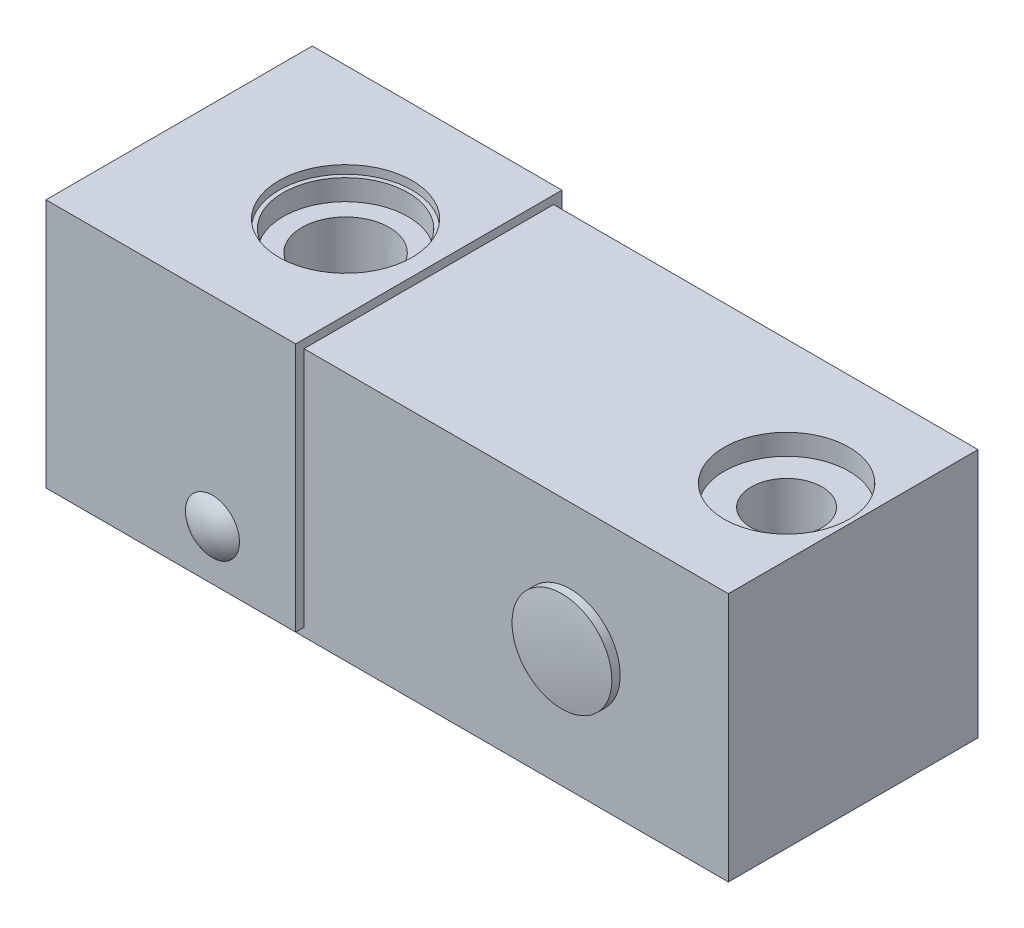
ISO-10303-21;
HEADER;
FILE_DESCRIPTION(('STEP AP214'),'2;1');
FILE_NAME('part.step','',(''),(''),'','','');
FILE_SCHEMA(('AUTOMOTIVE_DESIGN { 1 0 10303 214 1 1 1 1 }'));
ENDSEC;
DATA;
#1=APPLICATION_CONTEXT('core data for automotive mechanical design processes');
#2=APPLICATION_PROTOCOL_DEFINITION('international standard','automotive_design',2000,#1);
#3=PRODUCT_CONTEXT('',#1,'mechanical');
#4=PRODUCT('Part','Part','',(#3));
#5=PRODUCT_RELATED_PRODUCT_CATEGORY('part','',(#4));
#6=PRODUCT_DEFINITION_FORMATION('','',#4);
#7=PRODUCT_DEFINITION_CONTEXT('part definition',#1,'design');
#8=PRODUCT_DEFINITION('design','',#6,#7);
#9=PRODUCT_DEFINITION_SHAPE('','',#8);
#10=(LENGTH_UNIT() NAMED_UNIT(*) SI_UNIT(.MILLI.,.METRE.));
#11=(NAMED_UNIT(*) PLANE_ANGLE_UNIT() SI_UNIT($,.RADIAN.));
#12=(NAMED_UNIT(*) SI_UNIT($,.STERADIAN.) SOLID_ANGLE_UNIT());
#13=UNCERTAINTY_MEASURE_WITH_UNIT(LENGTH_MEASURE(1.E-05),#10,'distance_accuracy_value','');
#14=(GEOMETRIC_REPRESENTATION_CONTEXT(3) GLOBAL_UNCERTAINTY_ASSIGNED_CONTEXT((#13)) GLOBAL_UNIT_ASSIGNED_CONTEXT((#10,
#11,#12)) REPRESENTATION_CONTEXT('',''));
#15=CARTESIAN_POINT('',(0.,0.,0.));
#16=DIRECTION('',(0.,0.,1.));
#17=DIRECTION('',(1.,0.,0.));
#18=AXIS2_PLACEMENT_3D('',#15,#16,#17);
#19=CARTESIAN_POINT('',(35.29784594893,12.5,0.));
#20=DIRECTION('',(-1.,0.,0.));
#21=DIRECTION('',(0.,0.,1.));
#22=AXIS2_PLACEMENT_3D('',#19,#20,#21);
#23=CYLINDRICAL_SURFACE('',#22,6.);
#24=CARTESIAN_POINT('',(32.5,12.5,0.));
#25=DIRECTION('',(-1.,0.,0.));
#26=DIRECTION('',(0.,0.,1.));
#27=AXIS2_PLACEMENT_3D('',#24,#25,#26);
#28=CIRCLE('',#27,6.);
#29=CARTESIAN_POINT('',(32.5,9.1833752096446,-5.));
#30=VERTEX_POINT('',#29);
#31=CARTESIAN_POINT('',(32.4999999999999,10.7462852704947,5.7379861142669));
#32=VERTEX_POINT('',#31);
#33=EDGE_CURVE('E481',#30,#32,#28,.T.);
#34=ORIENTED_EDGE('',*,*,#33,.F.);
#35=DIRECTION('',(-1.,0.,0.));
#36=VECTOR('',#35,1.);
#37=CARTESIAN_POINT('',(35.29784594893,9.1833752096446,-5.));
#38=LINE('',#37,#36);
#39=CARTESIAN_POINT('',(28.9269659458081,9.1833752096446,-5.));
#40=VERTEX_POINT('',#39);
#41=EDGE_CURVE('E486',#30,#40,#38,.T.);
#42=ORIENTED_EDGE('',*,*,#41,.T.);
#43=CARTESIAN_POINT('',(32.5,8.44052881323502,-4.41822291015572));
#44=CARTESIAN_POINT('',(32.423898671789,8.43472699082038,-4.4128888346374));
#45=CARTESIAN_POINT('',(32.3476224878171,8.43024623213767,-4.40875463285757));
#46=CARTESIAN_POINT('',(32.1948684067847,8.42394254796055,-4.40292849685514));
#47=CARTESIAN_POINT('',(32.1183905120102,8.42211959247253,-4.4012365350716));
#48=CARTESIAN_POINT('',(31.8890732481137,8.42066210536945,-4.39988882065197));
#49=CARTESIAN_POINT('',(31.7361510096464,8.4250237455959,-4.40394711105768));
#50=CARTESIAN_POINT('',(31.4332832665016,8.44421800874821,-4.42162769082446));
#51=CARTESIAN_POINT('',(31.2833235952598,8.45893303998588,-4.43514256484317));
#52=CARTESIAN_POINT('',(30.9857640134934,8.49842185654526,-4.47080262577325));
#53=CARTESIAN_POINT('',(30.8381645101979,8.52319735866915,-4.49294928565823));
#54=CARTESIAN_POINT('',(30.5468509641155,8.58228810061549,-4.54456366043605));
#55=CARTESIAN_POINT('',(30.4031236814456,8.61656457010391,-4.57400157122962));
#56=CARTESIAN_POINT('',(30.1195823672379,8.69426383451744,-4.63885033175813));
#57=CARTESIAN_POINT('',(29.9797684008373,8.73768678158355,-4.67426128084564));
#58=CARTESIAN_POINT('',(29.5659514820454,8.88137942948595,-4.78753226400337));
#59=CARTESIAN_POINT('',(29.2983548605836,8.99491135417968,-4.87227777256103));
#60=CARTESIAN_POINT('',(28.740506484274,9.27590641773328,-5.06345303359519));
#61=CARTESIAN_POINT('',(28.4536264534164,9.44913196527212,-5.17116984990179));
#62=CARTESIAN_POINT('',(27.908309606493,9.8379492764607,-5.38167617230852));
#63=CARTESIAN_POINT('',(27.6498584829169,10.0535195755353,-5.48446814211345));
#64=CARTESIAN_POINT('',(27.1856792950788,10.5061345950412,-5.66379629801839));
#65=CARTESIAN_POINT('',(26.9773497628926,10.7398766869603,-5.741809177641));
#66=CARTESIAN_POINT('',(26.6894698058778,11.1141602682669,-5.83918673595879));
#67=CARTESIAN_POINT('',(26.5976213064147,11.2428504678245,-5.86837008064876));
#68=CARTESIAN_POINT('',(26.422802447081,11.5076285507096,-5.91889658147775));
#69=CARTESIAN_POINT('',(26.3398304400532,11.6437150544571,-5.94024119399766));
#70=CARTESIAN_POINT('',(26.1964456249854,11.8994769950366,-5.97102410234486));
#71=CARTESIAN_POINT('',(26.1345673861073,12.0181676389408,-5.98184372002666));
#72=CARTESIAN_POINT('',(26.0180261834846,12.259454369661,-5.99639363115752));
#73=CARTESIAN_POINT('',(25.9633618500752,12.3820497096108,-6.00012527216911));
#74=CARTESIAN_POINT('',(25.8616627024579,12.6303033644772,-5.99986836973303));
#75=CARTESIAN_POINT('',(25.8146244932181,12.7559602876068,-5.99588327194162));
#76=CARTESIAN_POINT('',(25.7284548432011,13.0094468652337,-5.97968151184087));
#77=CARTESIAN_POINT('',(25.6893234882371,13.1372765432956,-5.9674647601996));
#78=CARTESIAN_POINT('',(25.6190326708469,13.3944636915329,-5.93437425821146));
#79=CARTESIAN_POINT('',(25.5878996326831,13.5238247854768,-5.91347239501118));
#80=CARTESIAN_POINT('',(25.5337904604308,13.7825191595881,-5.86280790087));
#81=CARTESIAN_POINT('',(25.5108143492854,13.9118524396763,-5.83304524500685));
#82=CARTESIAN_POINT('',(25.4728545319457,14.1693528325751,-5.76463443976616));
#83=CARTESIAN_POINT('',(25.457871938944,14.2975197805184,-5.72598505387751));
#84=CARTESIAN_POINT('',(25.4355636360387,14.5515597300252,-5.63995471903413));
#85=CARTESIAN_POINT('',(25.4282378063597,14.6774327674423,-5.5925739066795));
#86=CARTESIAN_POINT('',(25.4209267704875,14.9198097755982,-5.49189290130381));
#87=CARTESIAN_POINT('',(25.4206004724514,15.0364710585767,-5.4389949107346));
#88=CARTESIAN_POINT('',(25.4258786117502,15.2660789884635,-5.32590002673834));
#89=CARTESIAN_POINT('',(25.4314850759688,15.379024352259,-5.26570064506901));
#90=CARTESIAN_POINT('',(25.45629832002,15.7112256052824,-5.07475514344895));
#91=CARTESIAN_POINT('',(25.4834955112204,15.9240181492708,-4.93359019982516));
#92=CARTESIAN_POINT('',(25.5573630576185,16.3492567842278,-4.61105206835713));
#93=CARTESIAN_POINT('',(25.6057657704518,16.5593610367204,-4.42702303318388));
#94=CARTESIAN_POINT('',(25.7141010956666,16.9507490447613,-4.03335677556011));
#95=CARTESIAN_POINT('',(25.7740436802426,17.132007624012,-3.82369746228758));
#96=CARTESIAN_POINT('',(25.9085641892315,17.4928674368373,-3.34318335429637));
#97=CARTESIAN_POINT('',(25.9838579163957,17.6665296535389,-3.0680588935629));
#98=CARTESIAN_POINT('',(26.126687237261,17.9679634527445,-2.49139757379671));
#99=CARTESIAN_POINT('',(26.1942194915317,18.0957153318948,-2.18984944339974));
#100=CARTESIAN_POINT('',(26.2813740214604,18.252345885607,-1.71471798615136));
#101=CARTESIAN_POINT('',(26.308522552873,18.2993735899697,-1.5483297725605));
#102=CARTESIAN_POINT('',(26.3554634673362,18.3790570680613,-1.21106461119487));
#103=CARTESIAN_POINT('',(26.3752557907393,18.4117127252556,-1.04018762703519));
#104=CARTESIAN_POINT('',(26.4061050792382,18.462062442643,-0.695745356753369));
#105=CARTESIAN_POINT('',(26.4171762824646,18.4797808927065,-0.522184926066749));
#106=CARTESIAN_POINT('',(26.4298385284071,18.5000164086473,-0.173844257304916));
#107=CARTESIAN_POINT('',(26.431431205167,18.5025360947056,0.000935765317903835));
#108=CARTESIAN_POINT('',(26.4254964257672,18.4930763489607,0.324515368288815));
#109=CARTESIAN_POINT('',(26.419258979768,18.4831480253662,0.473404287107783));
#110=CARTESIAN_POINT('',(26.4001205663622,18.4522953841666,0.769652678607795));
#111=CARTESIAN_POINT('',(26.3872173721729,18.4313673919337,0.91701162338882));
#112=CARTESIAN_POINT('',(26.3553992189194,18.3787697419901,1.20917295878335));
#113=CARTESIAN_POINT('',(26.3364828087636,18.3470974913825,1.35397472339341));
#114=CARTESIAN_POINT('',(26.2935530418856,18.2733680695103,1.64014955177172));
#115=CARTESIAN_POINT('',(26.2695375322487,18.2313065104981,1.78152113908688));
#116=CARTESIAN_POINT('',(26.1912354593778,18.0897576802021,2.20034676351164));
#117=CARTESIAN_POINT('',(26.1307892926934,17.9750506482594,2.47172103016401));
#118=CARTESIAN_POINT('',(26.0349824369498,17.7750093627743,2.8628329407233));
#119=CARTESIAN_POINT('',(26.0021659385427,17.7036060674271,2.99062863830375));
#120=CARTESIAN_POINT('',(25.9359930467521,17.5517379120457,3.24057669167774));
#121=CARTESIAN_POINT('',(25.9026365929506,17.4712720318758,3.36272840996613));
#122=CARTESIAN_POINT('',(25.7931620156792,17.1899959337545,3.75742393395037));
#123=CARTESIAN_POINT('',(25.7183404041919,16.9697666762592,4.01708585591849));
#124=CARTESIAN_POINT('',(25.6196490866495,16.6073373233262,4.37708445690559));
#125=CARTESIAN_POINT('',(25.5890073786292,16.4811713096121,4.49217438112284));
#126=CARTESIAN_POINT('',(25.5339694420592,16.2186292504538,4.71179603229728));
#127=CARTESIAN_POINT('',(25.509571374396,16.0822562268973,4.81633086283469));
#128=CARTESIAN_POINT('',(25.4731065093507,15.8300388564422,4.99292436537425));
#129=CARTESIAN_POINT('',(25.4595236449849,15.7159416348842,5.06717924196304));
#130=CARTESIAN_POINT('',(25.4381774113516,15.482562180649,5.20796311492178));
#131=CARTESIAN_POINT('',(25.4304127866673,15.3632810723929,5.27449377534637));
#132=CARTESIAN_POINT('',(25.4214784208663,15.1203347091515,5.39930395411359));
#133=CARTESIAN_POINT('',(25.4203040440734,14.99667259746,5.45758924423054));
#134=CARTESIAN_POINT('',(25.4252172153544,14.7457656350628,5.56553552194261));
#135=CARTESIAN_POINT('',(25.4313048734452,14.6185207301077,5.61519637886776));
#136=CARTESIAN_POINT('',(25.4513368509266,14.3609102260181,5.70576336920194));
#137=CARTESIAN_POINT('',(25.4653159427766,14.2305332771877,5.74662964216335));
#138=CARTESIAN_POINT('',(25.5015458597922,13.9683676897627,5.81914022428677));
#139=CARTESIAN_POINT('',(25.5237966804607,13.8365790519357,5.85078453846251));
#140=CARTESIAN_POINT('',(25.5767691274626,13.5728135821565,5.90484505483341));
#141=CARTESIAN_POINT('',(25.6074906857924,13.4408367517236,5.92726133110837));
#142=CARTESIAN_POINT('',(25.6774075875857,13.1779153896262,5.96305580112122));
#143=CARTESIAN_POINT('',(25.7166026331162,13.0469708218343,5.97643431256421));
#144=CARTESIAN_POINT('',(25.8003035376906,12.7962146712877,5.99390898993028));
#145=CARTESIAN_POINT('',(25.8442569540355,12.6762579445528,5.99858151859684));
#146=CARTESIAN_POINT('',(25.9391033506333,12.4390349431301,6.00086461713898));
#147=CARTESIAN_POINT('',(25.9899986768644,12.3217695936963,5.99847279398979));
#148=CARTESIAN_POINT('',(26.1526025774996,11.9751735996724,5.98146738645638));
#149=CARTESIAN_POINT('',(26.2742830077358,11.7508817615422,5.95703367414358));
#150=CARTESIAN_POINT('',(26.5523843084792,11.3019039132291,5.88394304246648));
#151=CARTESIAN_POINT('',(26.7108944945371,11.0788472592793,5.83338133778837));
#152=CARTESIAN_POINT('',(27.051414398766,10.6569933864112,5.71414063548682));
#153=CARTESIAN_POINT('',(27.2334304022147,10.4582026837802,5.64545678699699));
#154=CARTESIAN_POINT('',(27.6582952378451,10.0471045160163,5.48106619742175));
#155=CARTESIAN_POINT('',(27.9058822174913,9.84076906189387,5.38271477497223));
#156=CARTESIAN_POINT('',(28.4278002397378,9.46651260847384,5.18104203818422));
#157=CARTESIAN_POINT('',(28.702200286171,9.29869465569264,5.07770826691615));
#158=CARTESIAN_POINT('',(29.1597786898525,9.06308864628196,4.91924654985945));
#159=CARTESIAN_POINT('',(29.335374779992,8.9821841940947,4.86141456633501));
#160=CARTESIAN_POINT('',(29.6947859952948,8.83556038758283,4.75186828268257));
#161=CARTESIAN_POINT('',(29.8786035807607,8.76984561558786,4.70015583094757));
#162=CARTESIAN_POINT('',(30.2526738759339,8.6547961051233,4.60650559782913));
#163=CARTESIAN_POINT('',(30.4428893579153,8.60538024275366,4.56451972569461));
#164=CARTESIAN_POINT('',(30.8292241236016,8.52351707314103,4.4933907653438));
#165=CARTESIAN_POINT('',(31.0253376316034,8.49105370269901,4.46423552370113));
#166=CARTESIAN_POINT('',(31.328378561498,8.45501606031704,4.43151999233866));
#167=CARTESIAN_POINT('',(31.4339915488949,8.44503356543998,4.42236878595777));
#168=CARTESIAN_POINT('',(31.645863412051,8.430181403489,4.40870522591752));
#169=CARTESIAN_POINT('',(31.752122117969,8.42531044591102,4.40419170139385));
#170=CARTESIAN_POINT('',(31.965487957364,8.42072037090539,4.39994293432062));
#171=CARTESIAN_POINT('',(32.072596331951,8.4210326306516,4.40023679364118));
#172=CARTESIAN_POINT('',(32.2865921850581,8.4268712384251,4.40563219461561));
#173=CARTESIAN_POINT('',(32.393479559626,8.43239964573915,4.41073563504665));
#174=CARTESIAN_POINT('',(32.5,8.44052881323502,4.41822291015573));
#175=B_SPLINE_CURVE_WITH_KNOTS('',3,(#43,#44,#45,#46,#47,#48,#49,#50,#51,#52,#53,#54,#55,#56,
#57,#58,#59,#60,#61,#62,#63,#64,#65,#66,#67,#68,#69,#70,#71,#72,#73,#74,#75,#76,#77,#78,#79,#80,
#81,#82,#83,#84,#85,#86,#87,#88,#89,#90,#91,#92,#93,#94,#95,#96,#97,#98,#99,#100,#101,#102,#103,
#104,#105,#106,#107,#108,#109,#110,#111,#112,#113,#114,#115,#116,#117,#118,#119,#120,#121,#122,
#123,#124,#125,#126,#127,#128,#129,#130,#131,#132,#133,#134,#135,#136,#137,#138,#139,#140,#141,
#142,#143,#144,#145,#146,#147,#148,#149,#150,#151,#152,#153,#154,#155,#156,#157,#158,#159,#160,
#161,#162,#163,#164,#165,#166,#167,#168,#169,#170,#171,#172,#173,#174),.UNSPECIFIED.,.F.,.F.,(4,
2,2,2,2,2,2,2,2,2,2,2,2,2,2,2,2,2,2,2,2,2,2,2,2,2,2,2,2,2,2,2,2,2,2,2,2,2,2,2,2,2,2,2,2,2,2,2,2,
2,2,2,2,2,2,2,2,2,2,2,2,2,2,2,2,4),(0.,0.229483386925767,0.458964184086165,0.917327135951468,
1.37056641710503,1.82388307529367,2.2753764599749,2.72687735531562,3.63229237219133,
4.68465359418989,5.73648274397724,6.70036517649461,7.1821962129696,7.66393768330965,
8.06640078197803,8.46878735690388,8.87099430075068,9.27320560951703,9.67672910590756,
10.0802537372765,10.4838345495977,10.8874090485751,11.27126989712,11.6552619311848,
12.4226945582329,13.2700131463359,14.1180672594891,15.1158014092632,16.1139632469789,
16.6383662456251,17.1627734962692,17.6863228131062,18.2097818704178,18.6572742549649,
19.1049162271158,19.5526663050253,20.0006058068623,20.8988871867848,21.3486538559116,
21.7984712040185,22.8382668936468,23.3582280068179,23.8780357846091,24.2880629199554,
24.6980015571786,25.1076518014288,25.5173082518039,25.9287840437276,26.3402596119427,
26.7517318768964,27.1631896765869,27.5462803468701,27.9295008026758,28.6954364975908,
29.527330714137,30.3594478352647,31.3668302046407,32.3768770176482,32.9815945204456,
33.5864942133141,34.1883360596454,34.7896065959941,35.1088470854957,35.4280069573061,
35.7490995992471,36.0703190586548),.UNSPECIFIED.);
#176=CARTESIAN_POINT('',(25.4723828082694,15.8166247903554,-5.));
#177=VERTEX_POINT('',#176);
#178=EDGE_CURVE('E407',#40,#177,#175,.T.);
#179=ORIENTED_EDGE('',*,*,#178,.T.);
#180=DIRECTION('',(-1.,0.,0.));
#181=VECTOR('',#180,1.);
#182=CARTESIAN_POINT('',(35.29784594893,15.8166247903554,-5.));
#183=LINE('',#182,#181);
#184=CARTESIAN_POINT('',(27.7955722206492,15.8166247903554,-5.));
#185=VERTEX_POINT('',#184);
#186=EDGE_CURVE('E676',#177,#185,#183,.F.);
#187=ORIENTED_EDGE('',*,*,#186,.T.);
#188=CARTESIAN_POINT('',(32.5,10.7462852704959,-5.73798611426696));
#189=CARTESIAN_POINT('',(32.3836984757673,10.7325985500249,-5.73377457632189));
#190=CARTESIAN_POINT('',(32.2667807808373,10.7237068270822,-5.73103073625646));
#191=CARTESIAN_POINT('',(32.0325989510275,10.7155263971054,-5.72850415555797));
#192=CARTESIAN_POINT('',(31.9153348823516,10.7162359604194,-5.72872088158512));
#193=CARTESIAN_POINT('',(31.6816686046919,10.7272489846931,-5.73213427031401));
#194=CARTESIAN_POINT('',(31.5652648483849,10.737522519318,-5.73532163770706));
#195=CARTESIAN_POINT('',(31.3337952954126,10.7675208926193,-5.74445529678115));
#196=CARTESIAN_POINT('',(31.218729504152,10.7872457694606,-5.7504015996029));
#197=CARTESIAN_POINT('',(30.9907728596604,10.8359723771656,-5.76469042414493));
#198=CARTESIAN_POINT('',(30.8778812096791,10.8649706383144,-5.77303204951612));
#199=CARTESIAN_POINT('',(30.6549588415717,10.932012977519,-5.7915987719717));
#200=CARTESIAN_POINT('',(30.5449292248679,10.9700604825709,-5.80182458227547));
#201=CARTESIAN_POINT('',(30.2201364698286,11.0974105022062,-5.83442339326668));
#202=CARTESIAN_POINT('',(30.0106036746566,11.1999346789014,-5.85872250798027));
#203=CARTESIAN_POINT('',(29.6050150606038,11.4411522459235,-5.90714065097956));
#204=CARTESIAN_POINT('',(29.4095282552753,11.5808106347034,-5.93123389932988));
#205=CARTESIAN_POINT('',(29.1355774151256,11.8135307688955,-5.96111467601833));
#206=CARTESIAN_POINT('',(29.0474298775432,11.8950282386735,-5.97003498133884));
#207=CARTESIAN_POINT('',(28.8781749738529,12.0652631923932,-5.98483875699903));
#208=CARTESIAN_POINT('',(28.7970644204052,12.1539973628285,-5.99072360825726));
#209=CARTESIAN_POINT('',(28.6432896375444,12.3371549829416,-5.99848299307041));
#210=CARTESIAN_POINT('',(28.570548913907,12.4315125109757,-6.00039712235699));
#211=CARTESIAN_POINT('',(28.433219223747,12.6259076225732,-5.99946549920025));
#212=CARTESIAN_POINT('',(28.3686262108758,12.7259423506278,-5.99662211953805));
#213=CARTESIAN_POINT('',(28.2481503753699,12.93074462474,-5.98539616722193));
#214=CARTESIAN_POINT('',(28.1922614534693,13.0355087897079,-5.97701749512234));
#215=CARTESIAN_POINT('',(28.0895994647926,13.2487564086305,-5.95406220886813));
#216=CARTESIAN_POINT('',(28.0428252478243,13.3572393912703,-5.93948637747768));
#217=CARTESIAN_POINT('',(27.9632193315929,13.5649056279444,-5.9055759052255));
#218=CARTESIAN_POINT('',(27.9294291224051,13.6638341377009,-5.88692173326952));
#219=CARTESIAN_POINT('',(27.8694178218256,13.8628190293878,-5.84406389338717));
#220=CARTESIAN_POINT('',(27.8431991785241,13.9628757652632,-5.81985843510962));
#221=CARTESIAN_POINT('',(27.7983077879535,14.1631044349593,-5.76583307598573));
#222=CARTESIAN_POINT('',(27.7796311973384,14.2632762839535,-5.73601604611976));
#223=CARTESIAN_POINT('',(27.7496064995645,14.4629333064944,-5.67079604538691));
#224=CARTESIAN_POINT('',(27.738261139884,14.5624182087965,-5.63539098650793));
#225=CARTESIAN_POINT('',(27.7229279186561,14.7556127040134,-5.56079720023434));
#226=CARTESIAN_POINT('',(27.7186454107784,14.8493870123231,-5.52183583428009));
#227=CARTESIAN_POINT('',(27.7161359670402,15.0349152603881,-5.43916737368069));
#228=CARTESIAN_POINT('',(27.7179113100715,15.1266684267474,-5.39545849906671));
#229=CARTESIAN_POINT('',(27.7316997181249,15.3980602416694,-5.25759463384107));
#230=CARTESIAN_POINT('',(27.7521675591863,15.5739397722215,-5.15666043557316));
#231=CARTESIAN_POINT('',(27.8028189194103,15.8615703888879,-4.97190003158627));
#232=CARTESIAN_POINT('',(27.8282699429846,15.976776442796,-4.89197755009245));
#233=CARTESIAN_POINT('',(27.88695066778,16.2000989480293,-4.72532246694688));
#234=CARTESIAN_POINT('',(27.9201829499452,16.3082130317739,-4.63858761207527));
#235=CARTESIAN_POINT('',(28.0296982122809,16.6216697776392,-4.36896364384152));
#236=CARTESIAN_POINT('',(28.1157414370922,16.815831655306,-4.17684707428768));
#237=CARTESIAN_POINT('',(28.2720842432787,17.1129961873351,-3.84088959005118));
#238=CARTESIAN_POINT('',(28.3379901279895,17.2247365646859,-3.70245891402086));
#239=CARTESIAN_POINT('',(28.4740830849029,17.4346694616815,-3.41764468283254));
#240=CARTESIAN_POINT('',(28.5442695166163,17.532864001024,-3.27126231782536));
#241=CARTESIAN_POINT('',(28.6861433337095,17.7158544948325,-2.97083422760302));
#242=CARTESIAN_POINT('',(28.757832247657,17.8006359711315,-2.81678045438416));
#243=CARTESIAN_POINT('',(28.8994387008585,17.9566328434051,-2.50122365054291));
#244=CARTESIAN_POINT('',(28.9693570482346,18.0278545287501,-2.33972411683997));
#245=CARTESIAN_POINT('',(29.0807031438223,18.1345764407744,-2.06524820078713));
#246=CARTESIAN_POINT('',(29.1237378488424,18.1739905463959,-1.9544345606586));
#247=CARTESIAN_POINT('',(29.2059560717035,18.246600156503,-1.72932818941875));
#248=CARTESIAN_POINT('',(29.245138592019,18.2797940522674,-1.61503456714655));
#249=CARTESIAN_POINT('',(29.3179124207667,18.3395670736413,-1.38337287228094));
#250=CARTESIAN_POINT('',(29.3515205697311,18.3661662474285,-1.26601534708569));
#251=CARTESIAN_POINT('',(29.4114753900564,18.4124873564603,-1.02817717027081));
#252=CARTESIAN_POINT('',(29.4378275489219,18.4322144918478,-0.907698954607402));
#253=CARTESIAN_POINT('',(29.4774192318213,18.461381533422,-0.686948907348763));
#254=CARTESIAN_POINT('',(29.4921898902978,18.4720558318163,-0.587115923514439));
#255=CARTESIAN_POINT('',(29.514970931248,18.4883976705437,-0.386306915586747));
#256=CARTESIAN_POINT('',(29.5229845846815,18.4940676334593,-0.285331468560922));
#257=CARTESIAN_POINT('',(29.5317686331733,18.5002793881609,-0.0829612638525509));
#258=CARTESIAN_POINT('',(29.5325434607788,18.5008243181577,0.0184331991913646));
#259=CARTESIAN_POINT('',(29.5268323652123,18.4967887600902,0.220900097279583));
#260=CARTESIAN_POINT('',(29.5203460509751,18.4922079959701,0.321972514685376));
#261=CARTESIAN_POINT('',(29.4905934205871,18.47097036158,0.62258725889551));
#262=CARTESIAN_POINT('',(29.457076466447,18.4468510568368,0.820665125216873));
#263=CARTESIAN_POINT('',(29.3692266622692,18.3802432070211,1.20907439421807));
#264=CARTESIAN_POINT('',(29.3148416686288,18.337708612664,1.39938506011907));
#265=CARTESIAN_POINT('',(29.2002164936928,18.2419459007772,1.74896759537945));
#266=CARTESIAN_POINT('',(29.1414294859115,18.1905774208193,1.90924843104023));
#267=CARTESIAN_POINT('',(29.0179528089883,18.0754852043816,2.2230430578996));
#268=CARTESIAN_POINT('',(28.9532590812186,18.0117529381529,2.37655208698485));
#269=CARTESIAN_POINT('',(28.8212596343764,17.8721011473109,2.6773296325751));
#270=CARTESIAN_POINT('',(28.7539471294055,17.7961481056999,2.82457953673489));
#271=CARTESIAN_POINT('',(28.6197081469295,17.6322873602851,3.11240064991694));
#272=CARTESIAN_POINT('',(28.5527815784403,17.5443826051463,3.25297349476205));
#273=CARTESIAN_POINT('',(28.4188218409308,17.3523534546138,3.53338562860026));
#274=CARTESIAN_POINT('',(28.3519172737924,17.2476801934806,3.67291206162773));
#275=CARTESIAN_POINT('',(28.2238089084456,17.0250840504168,3.94390113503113));
#276=CARTESIAN_POINT('',(28.16260660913,16.9071577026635,4.07536165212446));
#277=CARTESIAN_POINT('',(28.0488243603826,16.6585888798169,4.32868415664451));
#278=CARTESIAN_POINT('',(27.996212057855,16.5279972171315,4.45058121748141));
#279=CARTESIAN_POINT('',(27.9021654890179,16.2541008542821,4.68391108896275));
#280=CARTESIAN_POINT('',(27.8607223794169,16.1108063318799,4.79535213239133));
#281=CARTESIAN_POINT('',(27.8053736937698,15.8705947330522,4.96503108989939));
#282=CARTESIAN_POINT('',(27.7870302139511,15.777361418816,5.02708048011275));
#283=CARTESIAN_POINT('',(27.7563010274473,15.5868634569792,5.14624944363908));
#284=CARTESIAN_POINT('',(27.7439134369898,15.4896000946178,5.20337057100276));
#285=CARTESIAN_POINT('',(27.72577616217,15.2915276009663,5.31226362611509));
#286=CARTESIAN_POINT('',(27.7200256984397,15.1907188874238,5.36403618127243));
#287=CARTESIAN_POINT('',(27.7158023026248,14.9862386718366,5.4618176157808));
#288=CARTESIAN_POINT('',(27.7173259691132,14.882568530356,5.50782917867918));
#289=CARTESIAN_POINT('',(27.7282440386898,14.6723651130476,5.59408868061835));
#290=CARTESIAN_POINT('',(27.7376957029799,14.5658164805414,5.63429218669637));
#291=CARTESIAN_POINT('',(27.7649933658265,14.3515649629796,5.70828788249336));
#292=CARTESIAN_POINT('',(27.7828393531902,14.2438620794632,5.74208008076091));
#293=CARTESIAN_POINT('',(27.8272046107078,14.0284244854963,5.80314146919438));
#294=CARTESIAN_POINT('',(27.8537213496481,13.9206897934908,5.83041255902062));
#295=CARTESIAN_POINT('',(27.9155299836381,13.7063094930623,5.87851030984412));
#296=CARTESIAN_POINT('',(27.9508211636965,13.5996637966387,5.89933749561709));
#297=CARTESIAN_POINT('',(28.0259991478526,13.3994900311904,5.93297015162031));
#298=CARTESIAN_POINT('',(28.0650371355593,13.3057430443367,5.94638123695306));
#299=CARTESIAN_POINT('',(28.1499353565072,13.1207848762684,5.96852615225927));
#300=CARTESIAN_POINT('',(28.1957978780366,13.0295745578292,5.97725840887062));
#301=CARTESIAN_POINT('',(28.2940604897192,12.8504583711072,5.99042900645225));
#302=CARTESIAN_POINT('',(28.3464587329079,12.7625515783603,5.9948685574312));
#303=CARTESIAN_POINT('',(28.4574731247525,12.5906259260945,5.99993305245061));
#304=CARTESIAN_POINT('',(28.5160916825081,12.5066085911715,6.0005565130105));
#305=CARTESIAN_POINT('',(28.7030410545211,12.2581870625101,5.99743552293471));
#306=CARTESIAN_POINT('',(28.8406695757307,12.1006940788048,5.9884957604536));
#307=CARTESIAN_POINT('',(29.1368441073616,11.8078352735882,5.96176331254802));
#308=CARTESIAN_POINT('',(29.2953986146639,11.6724784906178,5.94396702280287));
#309=CARTESIAN_POINT('',(29.6482557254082,11.4130276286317,5.90233598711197));
#310=CARTESIAN_POINT('',(29.8445699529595,11.2917344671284,5.87805635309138));
#311=CARTESIAN_POINT('',(30.2544758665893,11.0820664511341,5.83104602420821));
#312=CARTESIAN_POINT('',(30.4680772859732,10.9937103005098,5.80831621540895));
#313=CARTESIAN_POINT('',(30.8028501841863,10.8859205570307,5.77894326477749));
#314=CARTESIAN_POINT('',(30.9198170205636,10.8536725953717,5.76978314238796));
#315=CARTESIAN_POINT('',(31.1562116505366,10.7991907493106,5.75396087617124));
#316=CARTESIAN_POINT('',(31.2756384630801,10.7769529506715,5.74729775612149));
#317=CARTESIAN_POINT('',(31.5158963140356,10.7427187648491,5.736922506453));
#318=CARTESIAN_POINT('',(31.6367251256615,10.7307079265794,5.73320621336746));
#319=CARTESIAN_POINT('',(31.8789705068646,10.7169938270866,5.72895663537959));
#320=CARTESIAN_POINT('',(32.0003866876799,10.7152844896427,5.72842147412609));
#321=CARTESIAN_POINT('',(32.1849048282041,10.7205241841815,5.73004927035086));
#322=CARTESIAN_POINT('',(32.2481467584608,10.7237259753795,5.73104508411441));
#323=CARTESIAN_POINT('',(32.3743155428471,10.7329200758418,5.73388591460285));
#324=CARTESIAN_POINT('',(32.4372427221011,10.7389083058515,5.73572968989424));
#325=CARTESIAN_POINT('',(32.5,10.7462852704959,5.73798611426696));
#326=B_SPLINE_CURVE_WITH_KNOTS('',3,(#188,#189,#190,#191,#192,#193,#194,#195,#196,#197,#198,
#199,#200,#201,#202,#203,#204,#205,#206,#207,#208,#209,#210,#211,#212,#213,#214,#215,#216,#217,
#218,#219,#220,#221,#222,#223,#224,#225,#226,#227,#228,#229,#230,#231,#232,#233,#234,#235,#236,
#237,#238,#239,#240,#241,#242,#243,#244,#245,#246,#247,#248,#249,#250,#251,#252,#253,#254,#255,
#256,#257,#258,#259,#260,#261,#262,#263,#264,#265,#266,#267,#268,#269,#270,#271,#272,#273,#274,
#275,#276,#277,#278,#279,#280,#281,#282,#283,#284,#285,#286,#287,#288,#289,#290,#291,#292,#293,
#294,#295,#296,#297,#298,#299,#300,#301,#302,#303,#304,#305,#306,#307,#308,#309,#310,#311,#312,
#313,#314,#315,#316,#317,#318,#319,#320,#321,#322,#323,#324,#325),.UNSPECIFIED.,.F.,.F.,(4,2,2,
2,2,2,2,2,2,2,2,2,2,2,2,2,2,2,2,2,2,2,2,2,2,2,2,2,2,2,2,2,2,2,2,2,2,2,2,2,2,2,2,2,2,2,2,2,2,2,2,
2,2,2,2,2,2,2,2,2,2,2,2,2,2,2,2,2,4),(0.,0.351430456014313,0.702797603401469,1.05306898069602,
1.40334177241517,1.7534836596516,2.10375835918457,2.80410794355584,3.52482130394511,
3.88558103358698,4.24617649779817,4.6031584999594,4.95996251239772,5.31651536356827,
5.67302319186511,5.99118588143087,6.30945132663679,6.62755438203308,6.94577658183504,
7.25035254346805,7.55504309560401,8.16407788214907,8.59107611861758,9.01821618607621,
9.87355382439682,10.4421163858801,11.0105940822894,11.579681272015,12.1485038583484,
12.5240078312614,12.8996087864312,13.2740535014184,13.6482142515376,13.9523401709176,
14.2563187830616,14.5601112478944,14.8639200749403,15.4681663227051,16.07393235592,
16.6080559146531,17.1425492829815,17.6785343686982,18.2143874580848,18.774160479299,
19.3340802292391,19.8918398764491,20.4491566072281,20.789325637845,21.129387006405,
21.4694084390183,21.8092708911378,22.1516094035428,22.4939474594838,22.8361856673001,
23.1783959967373,23.4853280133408,23.7923631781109,24.0993117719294,24.4063796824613,
25.0316241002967,25.6571231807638,26.3502648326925,27.0437994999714,27.4084392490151,
27.7729362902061,28.1369174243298,28.5006838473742,28.6906167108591,28.8802723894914),.UNSPECIFIED.);
#327=EDGE_CURVE('E399',#185,#32,#326,.T.);
#328=ORIENTED_EDGE('',*,*,#327,.T.);
#329=EDGE_LOOP('',(#34,#42,#179,#187,#328));
#330=FACE_BOUND('',#329,.T.);
#331=CARTESIAN_POINT('',(9.5,12.5,0.));
#332=DIRECTION('',(-1.,0.,0.));
#333=DIRECTION('',(0.,0.,1.));
#334=AXIS2_PLACEMENT_3D('',#331,#332,#333);
#335=CIRCLE('',#334,6.);
#336=CARTESIAN_POINT('',(9.5,12.5,6.));
#337=VERTEX_POINT('',#336);
#338=EDGE_CURVE('E489',#337,#337,#335,.T.);
#339=ORIENTED_EDGE('',*,*,#338,.T.);
#340=EDGE_LOOP('',(#339));
#341=FACE_BOUND('',#340,.T.);
#342=CARTESIAN_POINT('',(30.,6.84314575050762,2.));
#343=CARTESIAN_POINT('',(29.8910636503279,6.84314610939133,2.00000051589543));
#344=CARTESIAN_POINT('',(29.7821304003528,6.83996461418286,1.99106956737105));
#345=CARTESIAN_POINT('',(29.5674911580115,6.82764851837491,1.95570226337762));
#346=CARTESIAN_POINT('',(29.4617857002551,6.81851293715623,1.9292630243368));
#347=CARTESIAN_POINT('',(29.2567462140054,6.79543592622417,1.85991097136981));
#348=CARTESIAN_POINT('',(29.1574001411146,6.78150392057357,1.81703044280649));
#349=CARTESIAN_POINT('',(28.9672799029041,6.75041755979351,1.71612325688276));
#350=CARTESIAN_POINT('',(28.8765076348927,6.73326249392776,1.65809325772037));
#351=CARTESIAN_POINT('',(28.7025600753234,6.69691021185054,1.52610229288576));
#352=CARTESIAN_POINT('',(28.6197691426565,6.67766210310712,1.45164868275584));
#353=CARTESIAN_POINT('',(28.4675863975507,6.63972270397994,1.28997533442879));
#354=CARTESIAN_POINT('',(28.3981967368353,6.62103150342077,1.20275355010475));
#355=CARTESIAN_POINT('',(28.2730422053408,6.58572266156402,1.01520901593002));
#356=CARTESIAN_POINT('',(28.2176800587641,6.56917184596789,0.914603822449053));
#357=CARTESIAN_POINT('',(28.124816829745,6.54060826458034,0.70486244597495));
#358=CARTESIAN_POINT('',(28.0873109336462,6.52859427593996,0.595728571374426));
#359=CARTESIAN_POINT('',(28.0325282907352,6.51081849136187,0.37605763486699));
#360=CARTESIAN_POINT('',(28.014593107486,6.50485370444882,0.265701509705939));
#361=CARTESIAN_POINT('',(27.9973674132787,6.49912783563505,0.0433957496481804));
#362=CARTESIAN_POINT('',(27.9980720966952,6.49936515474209,-0.0685534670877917));
#363=CARTESIAN_POINT('',(28.0176885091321,6.50587920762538,-0.286207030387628));
#364=CARTESIAN_POINT('',(28.035885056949,6.51191870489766,-0.391984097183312));
#365=CARTESIAN_POINT('',(28.0887859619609,6.52906065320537,-0.598886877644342));
#366=CARTESIAN_POINT('',(28.1234914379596,6.54016344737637,-0.70001227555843));
#367=CARTESIAN_POINT('',(28.2088426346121,6.56648659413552,-0.896304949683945));
#368=CARTESIAN_POINT('',(28.259691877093,6.58175914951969,-0.99137644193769));
#369=CARTESIAN_POINT('',(28.3757194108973,6.61483213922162,-1.17184865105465));
#370=CARTESIAN_POINT('',(28.4409016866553,6.63263327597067,-1.25724666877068));
#371=CARTESIAN_POINT('',(28.5873487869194,6.66987616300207,-1.42020173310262));
#372=CARTESIAN_POINT('',(28.669226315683,6.68935569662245,-1.49720031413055));
#373=CARTESIAN_POINT('',(28.8448974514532,6.72705329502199,-1.63655451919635));
#374=CARTESIAN_POINT('',(28.9386928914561,6.7452711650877,-1.69890788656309));
#375=CARTESIAN_POINT('',(29.1373072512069,6.77858949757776,-1.80797491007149));
#376=CARTESIAN_POINT('',(29.2422642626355,6.79364181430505,-1.85445292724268));
#377=CARTESIAN_POINT('',(29.4591427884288,6.81836698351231,-1.92888638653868));
#378=CARTESIAN_POINT('',(29.5710613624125,6.82804209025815,-1.95684959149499));
#379=CARTESIAN_POINT('',(29.7932767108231,6.8404072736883,-1.99232256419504));
#380=CARTESIAN_POINT('',(29.9034188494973,6.84339279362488,-2.00069819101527));
#381=CARTESIAN_POINT('',(30.1235522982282,6.84286655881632,-1.99921087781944));
#382=CARTESIAN_POINT('',(30.233543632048,6.83935598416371,-1.98935125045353));
#383=CARTESIAN_POINT('',(30.4463139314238,6.82652763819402,-1.95245130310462));
#384=CARTESIAN_POINT('',(30.5492108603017,6.8174134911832,-1.92601278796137));
#385=CARTESIAN_POINT('',(30.7490872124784,6.79462892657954,-1.85742772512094));
#386=CARTESIAN_POINT('',(30.8460655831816,6.78095770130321,-1.81527839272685));
#387=CARTESIAN_POINT('',(31.034760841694,6.75006244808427,-1.71494868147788));
#388=CARTESIAN_POINT('',(31.1262132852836,6.73273948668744,-1.656302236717));
#389=CARTESIAN_POINT('',(31.2982921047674,6.6966846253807,-1.52517126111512));
#390=CARTESIAN_POINT('',(31.3789152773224,6.67795231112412,-1.45268265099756));
#391=CARTESIAN_POINT('',(31.5310559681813,6.64009922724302,-1.29178341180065));
#392=CARTESIAN_POINT('',(31.6019487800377,6.62100312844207,-1.2027745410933));
#393=CARTESIAN_POINT('',(31.7278322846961,6.58546296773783,-1.01365458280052));
#394=CARTESIAN_POINT('',(31.7828235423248,6.56901881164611,-0.913543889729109));
#395=CARTESIAN_POINT('',(31.8748402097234,6.54071188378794,-0.705559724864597));
#396=CARTESIAN_POINT('',(31.9119825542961,6.52881939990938,-0.597742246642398));
#397=CARTESIAN_POINT('',(31.9674554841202,6.51082778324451,-0.376916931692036));
#398=CARTESIAN_POINT('',(31.985792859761,6.50472655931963,-0.263910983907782));
#399=CARTESIAN_POINT('',(32.0025241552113,6.49916273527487,-0.0416306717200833));
#400=CARTESIAN_POINT('',(32.0018149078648,6.49940159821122,0.0675694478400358));
#401=CARTESIAN_POINT('',(31.9826853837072,6.50575606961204,0.284222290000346));
#402=CARTESIAN_POINT('',(31.9642665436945,6.51187120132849,0.391675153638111));
#403=CARTESIAN_POINT('',(31.9108355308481,6.52918170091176,0.600084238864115));
#404=CARTESIAN_POINT('',(31.8760915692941,6.54029483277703,0.701116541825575));
#405=CARTESIAN_POINT('',(31.7912449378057,6.5664567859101,0.895956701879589));
#406=CARTESIAN_POINT('',(31.741139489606,6.58150631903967,0.989763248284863));
#407=CARTESIAN_POINT('',(31.624860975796,6.61468262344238,1.17126803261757));
#408=CARTESIAN_POINT('',(31.5581626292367,6.63290255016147,1.25861250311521));
#409=CARTESIAN_POINT('',(31.4114852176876,6.67014022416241,1.42116205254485));
#410=CARTESIAN_POINT('',(31.3315019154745,6.68915822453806,1.49636324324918));
#411=CARTESIAN_POINT('',(31.1567812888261,6.72673440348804,1.63548361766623));
#412=CARTESIAN_POINT('',(31.0615889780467,6.74524544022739,1.6988459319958));
#413=CARTESIAN_POINT('',(30.8613311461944,6.7787961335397,1.80862868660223));
#414=CARTESIAN_POINT('',(30.7562682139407,6.79383669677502,1.85505355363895));
#415=CARTESIAN_POINT('',(30.5440763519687,6.81797331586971,1.92768765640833));
#416=CARTESIAN_POINT('',(30.4372554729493,6.82730734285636,1.95471581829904));
#417=CARTESIAN_POINT('',(30.2202878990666,6.83989232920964,1.99086864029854));
#418=CARTESIAN_POINT('',(30.1101423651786,6.84314538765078,1.99999947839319));
#419=CARTESIAN_POINT('',(30.,6.84314575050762,2.));
#420=B_SPLINE_CURVE_WITH_KNOTS('',3,(#342,#343,#344,#345,#346,#347,#348,#349,#350,#351,#352,
#353,#354,#355,#356,#357,#358,#359,#360,#361,#362,#363,#364,#365,#366,#367,#368,#369,#370,#371,
#372,#373,#374,#375,#376,#377,#378,#379,#380,#381,#382,#383,#384,#385,#386,#387,#388,#389,#390,
#391,#392,#393,#394,#395,#396,#397,#398,#399,#400,#401,#402,#403,#404,#405,#406,#407,#408,#409,
#410,#411,#412,#413,#414,#415,#416,#417,#418,#419),.UNSPECIFIED.,.T.,.F.,(4,2,2,2,2,2,2,2,2,2,2,
2,2,2,2,2,2,2,2,2,2,2,2,2,2,2,2,2,2,2,2,2,2,2,2,2,2,2,4),(0.,0.326401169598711,
0.652856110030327,0.978673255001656,1.30456233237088,1.64202674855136,1.97954530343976,
2.32587012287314,2.67210152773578,3.00628637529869,3.34038506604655,3.66138009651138,
3.98239688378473,4.3076330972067,4.63295983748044,4.97360348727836,5.31429959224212,
5.65985279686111,6.00526102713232,6.3350858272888,6.66485071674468,6.98328791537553,
7.30178158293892,7.6303771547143,7.95906971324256,8.30357616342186,8.64807037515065,
8.99027582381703,9.33235766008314,9.65836169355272,9.98433928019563,10.3051391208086,
10.6259970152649,10.9587103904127,11.2915300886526,11.6373780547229,11.9831355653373,
12.3132642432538,12.6432789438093),.UNSPECIFIED.);
#421=CARTESIAN_POINT('',(30.,6.84314575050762,2.));
#422=VERTEX_POINT('',#421);
#423=EDGE_CURVE('E39',#422,#422,#420,.T.);
#424=ORIENTED_EDGE('',*,*,#423,.T.);
#425=EDGE_LOOP('',(#424));
#426=FACE_BOUND('',#425,.T.);
#427=ADVANCED_FACE('F35',(#330,#341,#426),#23,.F.);
#428=CARTESIAN_POINT('',(-30.,0.,16.));
#429=DIRECTION('',(0.,1.,0.));
#430=DIRECTION('',(0.,0.,1.));
#431=AXIS2_PLACEMENT_3D('',#428,#429,#430);
#432=PLANE('',#431);
#433=CARTESIAN_POINT('',(-10.,0.,0.));
#434=DIRECTION('',(0.,1.,0.));
#435=DIRECTION('',(0.,0.,1.));
#436=AXIS2_PLACEMENT_3D('',#433,#434,#435);
#437=CIRCLE('',#436,5.25);
#438=CARTESIAN_POINT('',(-10.,0.,5.25));
#439=VERTEX_POINT('',#438);
#440=EDGE_CURVE('E651',#439,#439,#437,.T.);
#441=ORIENTED_EDGE('',*,*,#440,.T.);
#442=EDGE_LOOP('',(#441));
#443=FACE_BOUND('',#442,.T.);
#444=CARTESIAN_POINT('',(43.,0.,-11.));
#445=DIRECTION('',(0.,1.,0.));
#446=DIRECTION('',(0.,0.,1.));
#447=AXIS2_PLACEMENT_3D('',#444,#445,#446);
#448=CIRCLE('',#447,2.5);
#449=CARTESIAN_POINT('',(43.,0.,-8.5));
#450=VERTEX_POINT('',#449);
#451=EDGE_CURVE('E629',#450,#450,#448,.T.);
#452=ORIENTED_EDGE('',*,*,#451,.T.);
#453=EDGE_LOOP('',(#452));
#454=FACE_BOUND('',#453,.T.);
#455=CARTESIAN_POINT('',(43.,0.,11.));
#456=DIRECTION('',(0.,1.,0.));
#457=DIRECTION('',(0.,0.,1.));
#458=AXIS2_PLACEMENT_3D('',#455,#456,#457);
#459=CIRCLE('',#458,2.5);
#460=CARTESIAN_POINT('',(43.,0.,13.5));
#461=VERTEX_POINT('',#460);
#462=EDGE_CURVE('E609',#461,#461,#459,.T.);
#463=ORIENTED_EDGE('',*,*,#462,.T.);
#464=EDGE_LOOP('',(#463));
#465=FACE_BOUND('',#464,.T.);
#466=DIRECTION('',(0.,0.,-1.));
#467=VECTOR('',#466,1.);
#468=CARTESIAN_POINT('',(-23.,0.,15.));
#469=LINE('',#468,#467);
#470=CARTESIAN_POINT('',(-23.,0.,15.));
#471=VERTEX_POINT('',#470);
#472=CARTESIAN_POINT('',(-23.,0.,-15.));
#473=VERTEX_POINT('',#472);
#474=EDGE_CURVE('E542',#471,#473,#469,.T.);
#475=ORIENTED_EDGE('',*,*,#474,.T.);
#476=DIRECTION('',(-1.,0.,0.));
#477=VECTOR('',#476,1.);
#478=CARTESIAN_POINT('',(51.,0.,-15.));
#479=LINE('',#478,#477);
#480=CARTESIAN_POINT('',(51.,0.,-15.));
#481=VERTEX_POINT('',#480);
#482=EDGE_CURVE('E565',#481,#473,#479,.T.);
#483=ORIENTED_EDGE('',*,*,#482,.F.);
#484=DIRECTION('',(0.,0.,-1.));
#485=VECTOR('',#484,1.);
#486=CARTESIAN_POINT('',(51.,0.,15.));
#487=LINE('',#486,#485);
#488=CARTESIAN_POINT('',(51.,0.,15.));
#489=VERTEX_POINT('',#488);
#490=EDGE_CURVE('E574',#489,#481,#487,.T.);
#491=ORIENTED_EDGE('',*,*,#490,.F.);
#492=DIRECTION('',(1.,0.,0.));
#493=VECTOR('',#492,1.);
#494=CARTESIAN_POINT('',(0.,0.,15.));
#495=LINE('',#494,#493);
#496=EDGE_CURVE('E560',#471,#489,#495,.T.);
#497=ORIENTED_EDGE('',*,*,#496,.F.);
#498=EDGE_LOOP('',(#475,#483,#491,#497));
#499=FACE_BOUND('',#498,.T.);
#500=CARTESIAN_POINT('',(43.,0.,0.));
#501=DIRECTION('',(0.,1.,0.));
#502=DIRECTION('',(0.,0.,1.));
#503=AXIS2_PLACEMENT_3D('',#500,#501,#502);
#504=CIRCLE('',#503,4.25);
#505=CARTESIAN_POINT('',(43.,0.,4.25));
#506=VERTEX_POINT('',#505);
#507=EDGE_CURVE('E490',#506,#506,#504,.T.);
#508=ORIENTED_EDGE('',*,*,#507,.T.);
#509=EDGE_LOOP('',(#508));
#510=FACE_BOUND('',#509,.T.);
#511=CARTESIAN_POINT('',(-16.,0.,11.));
#512=DIRECTION('',(0.,1.,0.));
#513=DIRECTION('',(0.,0.,1.));
#514=AXIS2_PLACEMENT_3D('',#511,#512,#513);
#515=CIRCLE('',#514,2.5);
#516=CARTESIAN_POINT('',(-16.,0.,13.5));
#517=VERTEX_POINT('',#516);
#518=EDGE_CURVE('E620',#517,#517,#515,.T.);
#519=ORIENTED_EDGE('',*,*,#518,.T.);
#520=EDGE_LOOP('',(#519));
#521=FACE_BOUND('',#520,.T.);
#522=CARTESIAN_POINT('',(-16.,0.,-11.));
#523=DIRECTION('',(0.,1.,0.));
#524=DIRECTION('',(0.,0.,1.));
#525=AXIS2_PLACEMENT_3D('',#522,#523,#524);
#526=CIRCLE('',#525,2.5);
#527=CARTESIAN_POINT('',(-16.,0.,-8.5));
#528=VERTEX_POINT('',#527);
#529=EDGE_CURVE('E638',#528,#528,#526,.T.);
#530=ORIENTED_EDGE('',*,*,#529,.T.);
#531=EDGE_LOOP('',(#530));
#532=FACE_BOUND('',#531,.T.);
#533=CARTESIAN_POINT('',(30.,0.,0.));
#534=DIRECTION('',(0.,1.,0.));
#535=DIRECTION('',(0.,0.,1.));
#536=AXIS2_PLACEMENT_3D('',#533,#534,#535);
#537=CIRCLE('',#536,4.25);
#538=CARTESIAN_POINT('',(30.,0.,4.25));
#539=VERTEX_POINT('',#538);
#540=EDGE_CURVE('E794',#539,#539,#537,.T.);
#541=ORIENTED_EDGE('',*,*,#540,.T.);
#542=EDGE_LOOP('',(#541));
#543=FACE_BOUND('',#542,.T.);
#544=ADVANCED_FACE('F353',(#443,#454,#465,#499,#510,#521,#532,#543),#432,.F.);
#545=CARTESIAN_POINT('',(0.,31.,-16.));
#546=DIRECTION('',(0.,0.,1.));
#547=DIRECTION('',(1.,0.,0.));
#548=AXIS2_PLACEMENT_3D('',#545,#546,#547);
#549=PLANE('',#548);
#550=DIRECTION('',(0.,-1.,0.));
#551=VECTOR('',#550,1.);
#552=CARTESIAN_POINT('',(0.,31.,-16.));
#553=LINE('',#552,#551);
#554=CARTESIAN_POINT('',(0.,31.,-16.));
#555=VERTEX_POINT('',#554);
#556=CARTESIAN_POINT('',(0.,1.,-16.));
#557=VERTEX_POINT('',#556);
#558=EDGE_CURVE('E580',#555,#557,#553,.T.);
#559=ORIENTED_EDGE('',*,*,#558,.T.);
#560=DIRECTION('',(-1.,0.,0.));
#561=VECTOR('',#560,1.);
#562=CARTESIAN_POINT('',(0.,1.,-16.));
#563=LINE('',#562,#561);
#564=CARTESIAN_POINT('',(-30.,1.,-16.));
#565=VERTEX_POINT('',#564);
#566=EDGE_CURVE('E512',#557,#565,#563,.T.);
#567=ORIENTED_EDGE('',*,*,#566,.T.);
#568=DIRECTION('',(0.,-1.,0.));
#569=VECTOR('',#568,1.);
#570=CARTESIAN_POINT('',(-30.,31.,-16.));
#571=LINE('',#570,#569);
#572=CARTESIAN_POINT('',(-30.,31.,-16.));
#573=VERTEX_POINT('',#572);
#574=EDGE_CURVE('E571',#573,#565,#571,.T.);
#575=ORIENTED_EDGE('',*,*,#574,.F.);
#576=DIRECTION('',(-1.,0.,0.));
#577=VECTOR('',#576,1.);
#578=CARTESIAN_POINT('',(0.,31.,-16.));
#579=LINE('',#578,#577);
#580=EDGE_CURVE('E569',#555,#573,#579,.T.);
#581=ORIENTED_EDGE('',*,*,#580,.F.);
#582=EDGE_LOOP('',(#559,#567,#575,#581));
#583=FACE_BOUND('',#582,.T.);
#584=CARTESIAN_POINT('',(-10.,7.,-16.));
#585=DIRECTION('',(0.,0.,1.));
#586=DIRECTION('',(1.,0.,0.));
#587=AXIS2_PLACEMENT_3D('',#584,#585,#586);
#588=CIRCLE('',#587,3.24961536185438);
#589=CARTESIAN_POINT('',(-6.75038463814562,7.,-16.));
#590=VERTEX_POINT('',#589);
#591=EDGE_CURVE('E11',#590,#590,#588,.F.);
#592=ORIENTED_EDGE('',*,*,#591,.F.);
#593=EDGE_LOOP('',(#592));
#594=FACE_BOUND('',#593,.T.);
#595=ADVANCED_FACE('F356',(#583,#594),#549,.F.);
#596=CARTESIAN_POINT('',(-16.,0.,-11.));
#597=DIRECTION('',(0.,1.,0.));
#598=DIRECTION('',(0.,0.,1.));
#599=AXIS2_PLACEMENT_3D('',#596,#597,#598);
#600=CYLINDRICAL_SURFACE('',#599,2.067);
#601=CARTESIAN_POINT('',(-16.,0.433,-11.));
#602=DIRECTION('',(0.,1.,0.));
#603=DIRECTION('',(0.,0.,1.));
#604=AXIS2_PLACEMENT_3D('',#601,#602,#603);
#605=CIRCLE('',#604,2.067);
#606=CARTESIAN_POINT('',(-16.,0.433,-8.933));
#607=VERTEX_POINT('',#606);
#608=EDGE_CURVE('E641',#607,#607,#605,.T.);
#609=ORIENTED_EDGE('',*,*,#608,.F.);
#610=EDGE_LOOP('',(#609));
#611=FACE_BOUND('',#610,.T.);
#612=DIRECTION('',(0.,1.,0.));
#613=VECTOR('',#612,1.);
#614=CARTESIAN_POINT('',(-14.317,0.,-12.2));
#615=LINE('',#614,#613);
#616=CARTESIAN_POINT('',(-14.317,9.,-12.2));
#617=VERTEX_POINT('',#616);
#618=CARTESIAN_POINT('',(-14.317,4.47739995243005,-12.2));
#619=VERTEX_POINT('',#618);
#620=EDGE_CURVE('E57',#617,#619,#615,.F.);
#621=ORIENTED_EDGE('',*,*,#620,.T.);
#622=CARTESIAN_POINT('',(-14.3168574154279,4.47715596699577,-12.1998));
#623=CARTESIAN_POINT('',(-14.3463764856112,4.52765705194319,-12.2411407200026));
#624=CARTESIAN_POINT('',(-14.375681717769,4.58085066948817,-12.2790971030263));
#625=CARTESIAN_POINT('',(-14.4331856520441,4.69137494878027,-12.3489493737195));
#626=CARTESIAN_POINT('',(-14.4613875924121,4.74869183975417,-12.3808642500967));
#627=CARTESIAN_POINT('',(-14.5159009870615,4.86590336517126,-12.4392726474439));
#628=CARTESIAN_POINT('',(-14.5422298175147,4.92576272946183,-12.4658219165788));
#629=CARTESIAN_POINT('',(-14.5930175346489,5.04803300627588,-12.5146391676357));
#630=CARTESIAN_POINT('',(-14.617474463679,5.11044648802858,-12.5369027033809));
#631=CARTESIAN_POINT('',(-14.6753091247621,5.26730276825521,-12.5873822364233));
#632=CARTESIAN_POINT('',(-14.7074247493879,5.36291286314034,-12.6134222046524));
#633=CARTESIAN_POINT('',(-14.7664047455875,5.55722970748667,-12.6589498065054));
#634=CARTESIAN_POINT('',(-14.7932683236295,5.65593692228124,-12.6784364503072));
#635=CARTESIAN_POINT('',(-14.8415431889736,5.85624972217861,-12.7121150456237));
#636=CARTESIAN_POINT('',(-14.8629178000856,5.95787000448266,-12.7262716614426));
#637=CARTESIAN_POINT('',(-14.8997370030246,6.16269409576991,-12.7499680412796));
#638=CARTESIAN_POINT('',(-14.9151818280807,6.26589784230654,-12.7595079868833));
#639=CARTESIAN_POINT('',(-14.9405587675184,6.47811757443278,-12.774909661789));
#640=CARTESIAN_POINT('',(-14.9502030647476,6.58718171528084,-12.7805809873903));
#641=CARTESIAN_POINT('',(-14.9627277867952,6.80582534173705,-12.7879058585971));
#642=CARTESIAN_POINT('',(-14.9656083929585,6.91540481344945,-12.7895595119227));
#643=CARTESIAN_POINT('',(-14.9645793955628,7.13411320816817,-12.7889644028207));
#644=CARTESIAN_POINT('',(-14.9606950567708,7.24324228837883,-12.7867301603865));
#645=CARTESIAN_POINT('',(-14.9462222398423,7.46092460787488,-12.7782327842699));
#646=CARTESIAN_POINT('',(-14.9356322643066,7.56947771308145,-12.7719687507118));
#647=CARTESIAN_POINT('',(-14.9069381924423,7.79254121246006,-12.7544253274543));
#648=CARTESIAN_POINT('',(-14.888383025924,7.9069701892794,-12.742841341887));
#649=CARTESIAN_POINT('',(-14.8440184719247,8.13361733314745,-12.7137397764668));
#650=CARTESIAN_POINT('',(-14.8182131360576,8.24583669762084,-12.6962255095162));
#651=CARTESIAN_POINT('',(-14.7742651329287,8.41213160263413,-12.6644480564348));
#652=CARTESIAN_POINT('',(-14.7586779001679,8.46741620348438,-12.6528871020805));
#653=CARTESIAN_POINT('',(-14.7258371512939,8.57700983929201,-12.6277060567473));
#654=CARTESIAN_POINT('',(-14.7085838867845,8.63131902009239,-12.6140862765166));
#655=CARTESIAN_POINT('',(-14.6724576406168,8.73888946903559,-12.5845091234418));
#656=CARTESIAN_POINT('',(-14.6535813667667,8.79214832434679,-12.5685469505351));
#657=CARTESIAN_POINT('',(-14.6143493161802,8.89728234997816,-12.5339928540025));
#658=CARTESIAN_POINT('',(-14.5939927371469,8.94915674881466,-12.5153994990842));
#659=CARTESIAN_POINT('',(-14.5729610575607,9.00019999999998,-12.4953423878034));
#660=B_SPLINE_CURVE_WITH_KNOTS('',3,(#622,#623,#624,#625,#626,#627,#628,#629,#630,#631,#632,
#633,#634,#635,#636,#637,#638,#639,#640,#641,#642,#643,#644,#645,#646,#647,#648,#649,#650,#651,
#652,#653,#654,#655,#656,#657,#658,#659),.UNSPECIFIED.,.F.,.F.,(4,2,2,2,2,2,2,2,2,2,2,2,2,2,2,2,
2,2,4),(0.,0.214552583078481,0.428419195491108,0.639934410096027,0.851667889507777,
1.16369892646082,1.47577707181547,1.7898891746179,2.10398892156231,2.43260749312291,
2.76121725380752,3.08860239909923,3.4160606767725,3.76519912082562,4.11414284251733,
4.2898628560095,4.4655563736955,4.64161508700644,4.81776994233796),.UNSPECIFIED.);
#661=CARTESIAN_POINT('',(-14.5730434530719,9.,-12.4954210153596));
#662=VERTEX_POINT('',#661);
#663=EDGE_CURVE('E228',#619,#662,#660,.T.);
#664=ORIENTED_EDGE('',*,*,#663,.T.);
#665=CARTESIAN_POINT('',(-16.,9.,-11.));
#666=DIRECTION('',(0.,1.,0.));
#667=DIRECTION('',(0.,0.,1.));
#668=AXIS2_PLACEMENT_3D('',#665,#666,#667);
#669=CIRCLE('',#668,2.067);
#670=EDGE_CURVE('E240',#662,#617,#669,.T.);
#671=ORIENTED_EDGE('',*,*,#670,.T.);
#672=EDGE_LOOP('',(#621,#664,#671));
#673=FACE_BOUND('',#672,.T.);
#674=ADVANCED_FACE('F239',(#611,#673),#600,.F.);
#675=CARTESIAN_POINT('',(-16.,9.,-11.));
#676=DIRECTION('',(0.,-1.,0.));
#677=DIRECTION('',(0.,0.,-1.));
#678=AXIS2_PLACEMENT_3D('',#675,#676,#677);
#679=CONICAL_SURFACE('',#678,2.067,1.04719755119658);
#680=CARTESIAN_POINT('',(-16.,10.193383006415,-11.));
#681=VERTEX_POINT('',#680);
#682=VERTEX_LOOP('',#681);
#683=FACE_BOUND('',#682,.T.);
#684=ORIENTED_EDGE('',*,*,#670,.F.);
#685=CARTESIAN_POINT('',(-14.5730966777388,8.9998,-12.4959505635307));
#686=CARTESIAN_POINT('',(-14.5706391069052,9.00904017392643,-12.4714881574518));
#687=CARTESIAN_POINT('',(-14.5680374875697,9.01810017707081,-12.4469718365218));
#688=CARTESIAN_POINT('',(-14.5625604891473,9.03582686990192,-12.3978383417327));
#689=CARTESIAN_POINT('',(-14.5596852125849,9.04449370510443,-12.3732212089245));
#690=CARTESIAN_POINT('',(-14.5536733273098,9.06140818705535,-12.3238743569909));
#691=CARTESIAN_POINT('',(-14.550536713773,9.06965582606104,-12.2991446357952));
#692=CARTESIAN_POINT('',(-14.5440154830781,9.08570294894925,-12.2495624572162));
#693=CARTESIAN_POINT('',(-14.5406307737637,9.0935022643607,-12.2247099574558));
#694=CARTESIAN_POINT('',(-14.5371298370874,9.10105992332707,-12.1998));
#695=B_SPLINE_CURVE_WITH_KNOTS('',3,(#685,#686,#687,#688,#689,#690,#691,#692,#693,#694),
.UNSPECIFIED.,.F.,.F.,(4,2,2,2,4),(0.,0.0787932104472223,0.157557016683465,0.23632227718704,
0.315116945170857),.UNSPECIFIED.);
#696=CARTESIAN_POINT('',(-14.5371579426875,9.10099923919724,-12.2));
#697=VERTEX_POINT('',#696);
#698=EDGE_CURVE('E49',#662,#697,#695,.T.);
#699=ORIENTED_EDGE('',*,*,#698,.T.);
#700=CARTESIAN_POINT('',(-15.8358228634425,9.49410858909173,-12.2));
#701=CARTESIAN_POINT('',(-15.7923231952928,9.49071694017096,-12.2));
#702=CARTESIAN_POINT('',(-15.7489475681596,9.48598108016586,-12.2));
#703=CARTESIAN_POINT('',(-15.6625650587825,9.47409676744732,-12.2));
#704=CARTESIAN_POINT('',(-15.6195578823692,9.46695046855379,-12.2));
#705=CARTESIAN_POINT('',(-15.4915424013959,9.44237053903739,-12.2));
#706=CARTESIAN_POINT('',(-15.4071440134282,9.42176009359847,-12.2));
#707=CARTESIAN_POINT('',(-15.2407427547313,9.37459609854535,-12.2));
#708=CARTESIAN_POINT('',(-15.1587272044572,9.34808539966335,-12.2));
#709=CARTESIAN_POINT('',(-14.996076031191,9.29084851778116,-12.2));
#710=CARTESIAN_POINT('',(-14.9154424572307,9.26011659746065,-12.2));
#711=CARTESIAN_POINT('',(-14.7663286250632,9.20015680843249,-12.2));
#712=CARTESIAN_POINT('',(-14.6976970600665,9.17129989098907,-12.2));
#713=CARTESIAN_POINT('',(-14.5611311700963,9.11197516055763,-12.2));
#714=CARTESIAN_POINT('',(-14.493196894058,9.081507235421,-12.2));
#715=CARTESIAN_POINT('',(-14.290251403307,8.98833103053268,-12.2));
#716=CARTESIAN_POINT('',(-14.1560636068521,8.92383617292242,-12.2));
#717=CARTESIAN_POINT('',(-13.8874247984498,8.79122721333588,-12.2));
#718=CARTESIAN_POINT('',(-13.7529913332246,8.72307803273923,-12.2));
#719=CARTESIAN_POINT('',(-13.5520950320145,8.6194978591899,-12.2));
#720=CARTESIAN_POINT('',(-13.4852756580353,8.58475594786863,-12.2));
#721=CARTESIAN_POINT('',(-13.3518380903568,8.51489408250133,-12.2));
#722=CARTESIAN_POINT('',(-13.2852198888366,8.47977414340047,-12.2));
#723=CARTESIAN_POINT('',(-13.2186815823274,8.44450411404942,-12.2));
#724=B_SPLINE_CURVE_WITH_KNOTS('',3,(#700,#701,#702,#703,#704,#705,#706,#707,#708,#709,#710,
#711,#712,#713,#714,#715,#716,#717,#718,#719,#720,#721,#722,#723),.UNSPECIFIED.,.F.,.F.,(4,2,2,
2,2,2,2,2,2,2,2,4),(0.,0.130844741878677,0.261572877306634,0.521842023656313,0.780279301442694,
1.03907137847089,1.26240149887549,1.48574718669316,1.93232838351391,2.38447304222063,
2.61040660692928,2.83633127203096),.UNSPECIFIED.);
#725=EDGE_CURVE('E237',#697,#617,#724,.T.);
#726=ORIENTED_EDGE('',*,*,#725,.T.);
#727=EDGE_LOOP('',(#684,#699,#726));
#728=FACE_BOUND('',#727,.T.);
#729=ADVANCED_FACE('F270',(#683,#728),#679,.F.);
#730=CARTESIAN_POINT('',(-30.,31.,16.));
#731=DIRECTION('',(0.,0.,-1.));
#732=DIRECTION('',(-1.,0.,0.));
#733=AXIS2_PLACEMENT_3D('',#730,#731,#732);
#734=PLANE('',#733);
#735=DIRECTION('',(0.,-1.,0.));
#736=VECTOR('',#735,1.);
#737=CARTESIAN_POINT('',(-30.,31.,16.));
#738=LINE('',#737,#736);
#739=CARTESIAN_POINT('',(-30.,31.,16.));
#740=VERTEX_POINT('',#739);
#741=CARTESIAN_POINT('',(-30.,1.,16.));
#742=VERTEX_POINT('',#741);
#743=EDGE_CURVE('E596',#740,#742,#738,.T.);
#744=ORIENTED_EDGE('',*,*,#743,.T.);
#745=DIRECTION('',(1.,0.,0.));
#746=VECTOR('',#745,1.);
#747=CARTESIAN_POINT('',(-30.,1.,16.));
#748=LINE('',#747,#746);
#749=CARTESIAN_POINT('',(0.,1.,16.));
#750=VERTEX_POINT('',#749);
#751=EDGE_CURVE('E523',#742,#750,#748,.T.);
#752=ORIENTED_EDGE('',*,*,#751,.T.);
#753=DIRECTION('',(0.,-1.,0.));
#754=VECTOR('',#753,1.);
#755=CARTESIAN_POINT('',(0.,31.,16.));
#756=LINE('',#755,#754);
#757=CARTESIAN_POINT('',(0.,31.,16.));
#758=VERTEX_POINT('',#757);
#759=EDGE_CURVE('E593',#758,#750,#756,.T.);
#760=ORIENTED_EDGE('',*,*,#759,.F.);
#761=DIRECTION('',(1.,0.,0.));
#762=VECTOR('',#761,1.);
#763=CARTESIAN_POINT('',(-30.,31.,16.));
#764=LINE('',#763,#762);
#765=EDGE_CURVE('E564',#740,#758,#764,.T.);
#766=ORIENTED_EDGE('',*,*,#765,.F.);
#767=EDGE_LOOP('',(#744,#752,#760,#766));
#768=FACE_BOUND('',#767,.T.);
#769=CARTESIAN_POINT('',(-10.,7.,16.));
#770=DIRECTION('',(0.,0.,-1.));
#771=DIRECTION('',(-1.,0.,0.));
#772=AXIS2_PLACEMENT_3D('',#769,#770,#771);
#773=CIRCLE('',#772,3.24961536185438);
#774=CARTESIAN_POINT('',(-13.2496153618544,7.,16.));
#775=VERTEX_POINT('',#774);
#776=EDGE_CURVE('E736',#775,#775,#773,.F.);
#777=ORIENTED_EDGE('',*,*,#776,.F.);
#778=EDGE_LOOP('',(#777));
#779=FACE_BOUND('',#778,.T.);
#780=ADVANCED_FACE('F274',(#768,#779),#734,.F.);
#781=CARTESIAN_POINT('',(-16.,0.,11.));
#782=DIRECTION('',(0.,1.,0.));
#783=DIRECTION('',(0.,0.,1.));
#784=AXIS2_PLACEMENT_3D('',#781,#782,#783);
#785=CYLINDRICAL_SURFACE('',#784,2.067);
#786=CARTESIAN_POINT('',(-16.,0.433,11.));
#787=DIRECTION('',(0.,1.,0.));
#788=DIRECTION('',(0.,0.,1.));
#789=AXIS2_PLACEMENT_3D('',#786,#787,#788);
#790=CIRCLE('',#789,2.067);
#791=CARTESIAN_POINT('',(-16.,0.433,13.067));
#792=VERTEX_POINT('',#791);
#793=EDGE_CURVE('E623',#792,#792,#790,.T.);
#794=ORIENTED_EDGE('',*,*,#793,.F.);
#795=EDGE_LOOP('',(#794));
#796=FACE_BOUND('',#795,.T.);
#797=CARTESIAN_POINT('',(-16.,9.,11.));
#798=DIRECTION('',(0.,1.,0.));
#799=DIRECTION('',(0.,0.,1.));
#800=AXIS2_PLACEMENT_3D('',#797,#798,#799);
#801=CIRCLE('',#800,2.067);
#802=CARTESIAN_POINT('',(-14.317,9.,12.2));
#803=VERTEX_POINT('',#802);
#804=CARTESIAN_POINT('',(-14.5730434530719,9.,12.4954210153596));
#805=VERTEX_POINT('',#804);
#806=EDGE_CURVE('E626',#803,#805,#801,.T.);
#807=ORIENTED_EDGE('',*,*,#806,.T.);
#808=CARTESIAN_POINT('',(-14.5729610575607,9.0002,12.4953423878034));
#809=CARTESIAN_POINT('',(-14.6044323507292,8.92383196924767,12.525311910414));
#810=CARTESIAN_POINT('',(-14.6343659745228,8.84565374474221,12.5520483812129));
#811=CARTESIAN_POINT('',(-14.690772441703,8.68652651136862,12.5999464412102));
#812=CARTESIAN_POINT('',(-14.7172504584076,8.60558187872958,12.6211164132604));
#813=CARTESIAN_POINT('',(-14.7663326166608,8.44195258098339,12.6587619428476));
#814=CARTESIAN_POINT('',(-14.7889557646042,8.35927885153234,12.6752608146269));
#815=CARTESIAN_POINT('',(-14.8302960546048,8.19224852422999,12.7043832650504));
#816=CARTESIAN_POINT('',(-14.8490109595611,8.10789099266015,12.7170046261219));
#817=CARTESIAN_POINT('',(-14.8897189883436,7.90045548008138,12.7437318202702));
#818=CARTESIAN_POINT('',(-14.9095179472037,7.77670816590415,12.7560375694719));
#819=CARTESIAN_POINT('',(-14.9403420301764,7.52768902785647,12.7748056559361));
#820=CARTESIAN_POINT('',(-14.9513655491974,7.40241692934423,12.7812669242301));
#821=CARTESIAN_POINT('',(-14.9645267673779,7.15045897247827,12.7889503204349));
#822=CARTESIAN_POINT('',(-14.966608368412,7.02376917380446,12.7901393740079));
#823=CARTESIAN_POINT('',(-14.961703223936,6.77063770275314,12.7872986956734));
#824=CARTESIAN_POINT('',(-14.9547174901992,6.64419600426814,12.7832695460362));
#825=CARTESIAN_POINT('',(-14.9316742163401,6.39131532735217,12.76956256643));
#826=CARTESIAN_POINT('',(-14.9155372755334,6.26488619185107,12.7598352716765));
#827=CARTESIAN_POINT('',(-14.8743608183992,6.01410165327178,12.7337882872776));
#828=CARTESIAN_POINT('',(-14.8493179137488,5.88974705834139,12.7174660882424));
#829=CARTESIAN_POINT('',(-14.7910410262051,5.64557839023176,12.6769484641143));
#830=CARTESIAN_POINT('',(-14.7578895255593,5.52573181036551,12.6528315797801));
#831=CARTESIAN_POINT('',(-14.6839453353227,5.29093171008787,12.5945900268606));
#832=CARTESIAN_POINT('',(-14.6431605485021,5.17597327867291,12.5604756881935));
#833=CARTESIAN_POINT('',(-14.5780911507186,5.01142010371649,12.5004906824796));
#834=CARTESIAN_POINT('',(-14.5562934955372,4.95900228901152,12.4795986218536));
#835=CARTESIAN_POINT('',(-14.5114285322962,4.85624356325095,12.4344538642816));
#836=CARTESIAN_POINT('',(-14.4883623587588,4.80590086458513,12.4102041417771));
#837=CARTESIAN_POINT('',(-14.4409543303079,4.70722852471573,12.3576217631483));
#838=CARTESIAN_POINT('',(-14.4166020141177,4.65892408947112,12.3292506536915));
#839=CARTESIAN_POINT('',(-14.3671666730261,4.56546158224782,12.2680194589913));
#840=CARTESIAN_POINT('',(-14.3420819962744,4.52031155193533,12.235148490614));
#841=CARTESIAN_POINT('',(-14.3168574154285,4.47715596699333,12.1998000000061));
#842=B_SPLINE_CURVE_WITH_KNOTS('',3,(#808,#809,#810,#811,#812,#813,#814,#815,#816,#817,#818,
#819,#820,#821,#822,#823,#824,#825,#826,#827,#828,#829,#830,#831,#832,#833,#834,#835,#836,#837,
#838,#839,#840,#841),.UNSPECIFIED.,.F.,.F.,(4,2,2,2,2,2,2,2,2,2,2,2,2,2,2,2,4),(0.,
0.263395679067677,0.526392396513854,0.788052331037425,1.04986163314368,1.42713212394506,
1.80447160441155,2.18417494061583,2.5638359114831,2.94684255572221,3.32999507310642,
3.7094013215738,4.08841692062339,4.26977770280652,4.45097883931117,4.63399445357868,
4.81746078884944),.UNSPECIFIED.);
#843=CARTESIAN_POINT('',(-14.317,4.47739995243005,12.2));
#844=VERTEX_POINT('',#843);
#845=EDGE_CURVE('E719',#805,#844,#842,.T.);
#846=ORIENTED_EDGE('',*,*,#845,.T.);
#847=DIRECTION('',(0.,1.,0.));
#848=VECTOR('',#847,1.);
#849=CARTESIAN_POINT('',(-14.317,0.,12.2));
#850=LINE('',#849,#848);
#851=EDGE_CURVE('E745',#844,#803,#850,.T.);
#852=ORIENTED_EDGE('',*,*,#851,.T.);
#853=EDGE_LOOP('',(#807,#846,#852));
#854=FACE_BOUND('',#853,.T.);
#855=ADVANCED_FACE('F376',(#796,#854),#785,.F.);
#856=CARTESIAN_POINT('',(-16.,9.,11.));
#857=DIRECTION('',(0.,-1.,0.));
#858=DIRECTION('',(0.,0.,-1.));
#859=AXIS2_PLACEMENT_3D('',#856,#857,#858);
#860=CONICAL_SURFACE('',#859,2.067,1.04719755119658);
#861=CARTESIAN_POINT('',(-16.,10.193383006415,11.));
#862=VERTEX_POINT('',#861);
#863=VERTEX_LOOP('',#862);
#864=FACE_BOUND('',#863,.T.);
#865=CARTESIAN_POINT('',(-13.2186815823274,8.44450411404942,12.2));
#866=CARTESIAN_POINT('',(-13.2852198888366,8.47977414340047,12.2));
#867=CARTESIAN_POINT('',(-13.3518380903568,8.51489408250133,12.2));
#868=CARTESIAN_POINT('',(-13.4852756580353,8.58475594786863,12.2));
#869=CARTESIAN_POINT('',(-13.5520950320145,8.6194978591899,12.2));
#870=CARTESIAN_POINT('',(-13.7529913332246,8.72307803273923,12.2));
#871=CARTESIAN_POINT('',(-13.8874247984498,8.79122721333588,12.2));
#872=CARTESIAN_POINT('',(-14.1560636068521,8.92383617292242,12.2));
#873=CARTESIAN_POINT('',(-14.290251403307,8.98833103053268,12.2));
#874=CARTESIAN_POINT('',(-14.493196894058,9.081507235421,12.2));
#875=CARTESIAN_POINT('',(-14.5611311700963,9.11197516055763,12.2));
#876=CARTESIAN_POINT('',(-14.6976970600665,9.17129989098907,12.2));
#877=CARTESIAN_POINT('',(-14.7663286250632,9.20015680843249,12.2));
#878=CARTESIAN_POINT('',(-14.9154424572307,9.26011659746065,12.2));
#879=CARTESIAN_POINT('',(-14.996076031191,9.29084851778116,12.2));
#880=CARTESIAN_POINT('',(-15.1587272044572,9.34808539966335,12.2));
#881=CARTESIAN_POINT('',(-15.2407427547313,9.37459609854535,12.2));
#882=CARTESIAN_POINT('',(-15.4071440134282,9.42176009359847,12.2));
#883=CARTESIAN_POINT('',(-15.4915424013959,9.44237053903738,12.2));
#884=CARTESIAN_POINT('',(-15.6195578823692,9.46695046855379,12.2));
#885=CARTESIAN_POINT('',(-15.6625650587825,9.47409676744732,12.2));
#886=CARTESIAN_POINT('',(-15.7489475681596,9.48598108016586,12.2));
#887=CARTESIAN_POINT('',(-15.7923231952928,9.49071694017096,12.2));
#888=CARTESIAN_POINT('',(-15.8358228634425,9.49410858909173,12.2));
#889=B_SPLINE_CURVE_WITH_KNOTS('',3,(#865,#866,#867,#868,#869,#870,#871,#872,#873,#874,#875,
#876,#877,#878,#879,#880,#881,#882,#883,#884,#885,#886,#887,#888),.UNSPECIFIED.,.F.,.F.,(4,2,2,
2,2,2,2,2,2,2,2,4),(0.,0.22592466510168,0.451858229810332,0.904002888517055,1.3505840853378,
1.57392977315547,1.79725989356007,2.05605197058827,2.31448924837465,2.57475839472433,
2.70548653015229,2.83633127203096),.UNSPECIFIED.);
#890=CARTESIAN_POINT('',(-14.5371579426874,9.10099923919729,12.2));
#891=VERTEX_POINT('',#890);
#892=EDGE_CURVE('E762',#803,#891,#889,.T.);
#893=ORIENTED_EDGE('',*,*,#892,.T.);
#894=CARTESIAN_POINT('',(-14.5371298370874,9.10105992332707,12.1998));
#895=CARTESIAN_POINT('',(-14.5406307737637,9.0935022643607,12.2247099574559));
#896=CARTESIAN_POINT('',(-14.5440154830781,9.08570294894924,12.2495624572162));
#897=CARTESIAN_POINT('',(-14.550536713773,9.06965582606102,12.2991446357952));
#898=CARTESIAN_POINT('',(-14.5536733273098,9.06140818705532,12.3238743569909));
#899=CARTESIAN_POINT('',(-14.5596852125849,9.0444937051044,12.3732212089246));
#900=CARTESIAN_POINT('',(-14.5625604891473,9.03582686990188,12.3978383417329));
#901=CARTESIAN_POINT('',(-14.5680374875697,9.01810017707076,12.4469718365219));
#902=CARTESIAN_POINT('',(-14.5706391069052,9.00904017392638,12.471488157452));
#903=CARTESIAN_POINT('',(-14.5730966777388,8.99979999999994,12.4959505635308));
#904=B_SPLINE_CURVE_WITH_KNOTS('',3,(#894,#895,#896,#897,#898,#899,#900,#901,#902,#903),
.UNSPECIFIED.,.F.,.F.,(4,2,2,2,4),(0.,0.0787946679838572,0.157559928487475,0.236323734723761,
0.315116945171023),.UNSPECIFIED.);
#905=EDGE_CURVE('E739',#891,#805,#904,.T.);
#906=ORIENTED_EDGE('',*,*,#905,.T.);
#907=ORIENTED_EDGE('',*,*,#806,.F.);
#908=EDGE_LOOP('',(#893,#906,#907));
#909=FACE_BOUND('',#908,.T.);
#910=ADVANCED_FACE('F381',(#864,#909),#860,.F.);
#911=CARTESIAN_POINT('',(32.,15.,15.));
#912=DIRECTION('',(0.,0.,-1.));
#913=DIRECTION('',(-1.,0.,0.));
#914=AXIS2_PLACEMENT_3D('',#911,#912,#913);
#915=CYLINDRICAL_SURFACE('',#914,4.283);
#916=CARTESIAN_POINT('',(32.,15.,9.));
#917=DIRECTION('',(0.,0.,-1.));
#918=DIRECTION('',(-1.,0.,0.));
#919=AXIS2_PLACEMENT_3D('',#916,#917,#918);
#920=CIRCLE('',#919,4.283);
#921=CARTESIAN_POINT('',(27.717,15.,9.));
#922=VERTEX_POINT('',#921);
#923=EDGE_CURVE('E665',#922,#922,#920,.T.);
#924=ORIENTED_EDGE('',*,*,#923,.F.);
#925=EDGE_LOOP('',(#924));
#926=FACE_BOUND('',#925,.T.);
#927=ORIENTED_EDGE('',*,*,#327,.F.);
#928=CARTESIAN_POINT('',(32.,15.,-5.));
#929=DIRECTION('',(0.,0.,-1.));
#930=DIRECTION('',(-1.,0.,0.));
#931=AXIS2_PLACEMENT_3D('',#928,#929,#930);
#932=CIRCLE('',#931,4.283);
#933=CARTESIAN_POINT('',(32.8351099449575,10.799204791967,-5.));
#934=VERTEX_POINT('',#933);
#935=EDGE_CURVE('E678',#185,#934,#932,.T.);
#936=ORIENTED_EDGE('',*,*,#935,.T.);
#937=CARTESIAN_POINT('',(32.220015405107,10.7226547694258,6.3566269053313));
#938=CARTESIAN_POINT('',(32.3421982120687,10.7289844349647,6.08632401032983));
#939=CARTESIAN_POINT('',(32.4644925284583,10.7404820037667,5.81616949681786));
#940=CARTESIAN_POINT('',(32.7093137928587,10.7743229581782,5.27647895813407));
#941=CARTESIAN_POINT('',(32.8318408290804,10.7966720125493,5.00694333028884));
#942=CARTESIAN_POINT('',(33.077007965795,10.8527200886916,4.46909876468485));
#943=CARTESIAN_POINT('',(33.1996480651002,10.8864189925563,4.20078981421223));
#944=CARTESIAN_POINT('',(33.4449455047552,10.9660365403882,3.66606250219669));
#945=CARTESIAN_POINT('',(33.5676028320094,11.0119519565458,3.39964366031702));
#946=CARTESIAN_POINT('',(33.7937522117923,11.1090834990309,2.91070964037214));
#947=CARTESIAN_POINT('',(33.8972557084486,11.1583621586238,2.68781540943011));
#948=CARTESIAN_POINT('',(34.1041400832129,11.2676568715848,2.24442525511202));
#949=CARTESIAN_POINT('',(34.2075208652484,11.3276786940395,2.02393068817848));
#950=CARTESIAN_POINT('',(34.3718445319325,11.4329670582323,1.67513416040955));
#951=CARTESIAN_POINT('',(34.4329803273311,11.4743337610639,1.54573907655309));
#952=CARTESIAN_POINT('',(34.5546845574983,11.5615040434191,1.28863951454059));
#953=CARTESIAN_POINT('',(34.6152540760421,11.6072953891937,1.16093142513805));
#954=CARTESIAN_POINT('',(34.7112488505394,11.6840778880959,0.957803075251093));
#955=CARTESIAN_POINT('',(34.7470006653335,11.7136250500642,0.881986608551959));
#956=CARTESIAN_POINT('',(34.8181138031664,11.7743969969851,0.729962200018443));
#957=CARTESIAN_POINT('',(34.853469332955,11.8056337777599,0.653756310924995));
#958=CARTESIAN_POINT('',(34.9053768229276,11.8530277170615,0.538650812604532));
#959=CARTESIAN_POINT('',(34.922572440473,11.8689943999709,0.499959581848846));
#960=CARTESIAN_POINT('',(34.9562336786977,11.9007572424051,0.421986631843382));
#961=CARTESIAN_POINT('',(34.9726965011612,11.9165525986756,0.382703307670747));
#962=CARTESIAN_POINT('',(35.0038019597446,11.9468504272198,0.303861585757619));
#963=CARTESIAN_POINT('',(35.0184715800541,11.9613707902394,0.26432026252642));
#964=CARTESIAN_POINT('',(35.044450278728,11.9874033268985,0.183224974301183));
#965=CARTESIAN_POINT('',(35.0557846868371,11.998938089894,0.141689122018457));
#966=CARTESIAN_POINT('',(35.0653420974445,12.0087161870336,0.08595743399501));
#967=CARTESIAN_POINT('',(35.0671787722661,12.0106006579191,0.0730917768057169));
#968=CARTESIAN_POINT('',(35.0700012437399,12.0134996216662,0.0471705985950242));
#969=CARTESIAN_POINT('',(35.0709870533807,12.0145141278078,0.0341150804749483));
#970=CARTESIAN_POINT('',(35.072483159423,12.0160525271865,-0.00498650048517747));
#971=CARTESIAN_POINT('',(35.0715711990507,12.0151115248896,-0.0311750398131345));
#972=CARTESIAN_POINT('',(35.0655469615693,12.0089253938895,-0.0898986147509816));
#973=CARTESIAN_POINT('',(35.0593365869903,12.0025555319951,-0.122172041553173));
#974=CARTESIAN_POINT('',(35.0436627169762,11.9866412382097,-0.185471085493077));
#975=CARTESIAN_POINT('',(35.0341502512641,11.9770490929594,-0.2164695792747));
#976=CARTESIAN_POINT('',(35.0124631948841,11.9554288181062,-0.28043382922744));
#977=CARTESIAN_POINT('',(35.000117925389,11.9432532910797,-0.313288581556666));
#978=CARTESIAN_POINT('',(34.9743859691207,11.9182078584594,-0.378326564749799));
#979=CARTESIAN_POINT('',(34.9609986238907,11.9053375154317,-0.410509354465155));
#980=CARTESIAN_POINT('',(34.9199347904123,11.8663941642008,-0.506664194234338));
#981=CARTESIAN_POINT('',(34.8913943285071,11.840026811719,-0.57014405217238));
#982=CARTESIAN_POINT('',(34.8335878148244,11.7880868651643,-0.696554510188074));
#983=CARTESIAN_POINT('',(34.8043272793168,11.7625103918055,-0.759486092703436));
#984=CARTESIAN_POINT('',(34.7453491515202,11.7123499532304,-0.885457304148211));
#985=CARTESIAN_POINT('',(34.7156319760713,11.6877651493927,-0.94849679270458));
#986=CARTESIAN_POINT('',(34.6258852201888,11.6155162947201,-1.1384906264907));
#987=CARTESIAN_POINT('',(34.5654569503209,11.5695337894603,-1.26590082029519));
#988=CARTESIAN_POINT('',(34.4441739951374,11.4820884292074,-1.52207206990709));
#989=CARTESIAN_POINT('',(34.3833192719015,11.4406259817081,-1.65083324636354));
#990=CARTESIAN_POINT('',(34.2613533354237,11.361918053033,-1.90962021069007));
#991=CARTESIAN_POINT('',(34.2002419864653,11.3246752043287,-2.03964673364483));
#992=CARTESIAN_POINT('',(34.0779072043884,11.254152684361,-2.30070926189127));
#993=CARTESIAN_POINT('',(34.0166837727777,11.2208729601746,-2.43174525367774));
#994=CARTESIAN_POINT('',(33.83220051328,11.1261976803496,-2.82768195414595));
#995=CARTESIAN_POINT('',(33.7088430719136,11.0704204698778,-3.09389306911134));
#996=CARTESIAN_POINT('',(33.4621304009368,10.9721123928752,-3.62865153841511));
#997=CARTESIAN_POINT('',(33.3387751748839,10.9295791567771,-3.89719846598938));
#998=CARTESIAN_POINT('',(33.1320232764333,10.868393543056,-4.34881380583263));
#999=CARTESIAN_POINT('',(33.0486060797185,10.8464666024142,-4.53143786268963));
#1000=CARTESIAN_POINT('',(32.8818259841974,10.8078885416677,-4.89725888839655));
#1001=CARTESIAN_POINT('',(32.7984630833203,10.791237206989,-5.08045583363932));
#1002=CARTESIAN_POINT('',(32.6325358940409,10.7631368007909,-5.44566542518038));
#1003=CARTESIAN_POINT('',(32.5499709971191,10.7516435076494,-5.62767441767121));
#1004=CARTESIAN_POINT('',(32.384925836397,10.7335268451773,-5.99197296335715));
#1005=CARTESIAN_POINT('',(32.3024455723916,10.7269034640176,-6.1742625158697));
#1006=CARTESIAN_POINT('',(32.220015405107,10.7226547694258,-6.3566269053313));
#1007=B_SPLINE_CURVE_WITH_KNOTS('',3,(#937,#938,#939,#940,#941,#942,#943,#944,#945,#946,#947,
#948,#949,#950,#951,#952,#953,#954,#955,#956,#957,#958,#959,#960,#961,#962,#963,#964,#965,#966,
#967,#968,#969,#970,#971,#972,#973,#974,#975,#976,#977,#978,#979,#980,#981,#982,#983,#984,#985,
#986,#987,#988,#989,#990,#991,#992,#993,#994,#995,#996,#997,#998,#999,#1000,#1001,#1002,#1003,
#1004,#1005,#1006),.UNSPECIFIED.,.F.,.F.,(4,2,2,2,2,2,2,2,2,2,2,2,2,2,2,2,2,2,2,2,2,2,2,2,2,2,2,
2,2,2,2,2,2,2,4),(0.,0.89009345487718,1.78065239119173,2.67120207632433,3.56151669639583,
4.31325284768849,5.06539389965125,5.51223816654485,5.95788049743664,6.22450415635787,
6.49336488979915,6.62912095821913,6.7653573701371,6.89919070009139,7.03197970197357,
7.07132057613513,7.11066084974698,7.18870927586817,7.28847396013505,7.3897862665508,
7.50117561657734,7.61263593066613,7.8358931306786,8.05778260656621,8.27948032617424,
8.724361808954,9.1692833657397,9.61448098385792,10.0596726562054,10.9552659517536,
11.85069891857,12.4565342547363,13.0623449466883,13.6628576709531,14.2633689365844),.UNSPECIFIED.);
#1008=EDGE_CURVE('E469',#32,#934,#1007,.T.);
#1009=ORIENTED_EDGE('',*,*,#1008,.F.);
#1010=EDGE_LOOP('',(#927,#936,#1009));
#1011=FACE_BOUND('',#1010,.T.);
#1012=ADVANCED_FACE('F368',(#926,#1011),#915,.F.);
#1013=CARTESIAN_POINT('',(51.,31.,-15.));
#1014=DIRECTION('',(0.,0.,1.));
#1015=DIRECTION('',(1.,0.,0.));
#1016=AXIS2_PLACEMENT_3D('',#1013,#1014,#1015);
#1017=PLANE('',#1016);
#1018=DIRECTION('',(1.,0.,0.));
#1019=VECTOR('',#1018,1.);
#1020=CARTESIAN_POINT('',(0.,30.,-15.));
#1021=LINE('',#1020,#1019);
#1022=CARTESIAN_POINT('',(0.,30.,-15.));
#1023=VERTEX_POINT('',#1022);
#1024=CARTESIAN_POINT('',(51.,30.,-15.));
#1025=VERTEX_POINT('',#1024);
#1026=EDGE_CURVE('E551',#1023,#1025,#1021,.T.);
#1027=ORIENTED_EDGE('',*,*,#1026,.T.);
#1028=DIRECTION('',(0.,-1.,0.));
#1029=VECTOR('',#1028,1.);
#1030=CARTESIAN_POINT('',(51.,31.,-15.));
#1031=LINE('',#1030,#1029);
#1032=EDGE_CURVE('E586',#1025,#481,#1031,.T.);
#1033=ORIENTED_EDGE('',*,*,#1032,.T.);
#1034=ORIENTED_EDGE('',*,*,#482,.T.);
#1035=DIRECTION('',(0.,1.,0.));
#1036=VECTOR('',#1035,1.);
#1037=CARTESIAN_POINT('',(-23.,0.,-15.));
#1038=LINE('',#1037,#1036);
#1039=CARTESIAN_POINT('',(-23.,1.,-15.));
#1040=VERTEX_POINT('',#1039);
#1041=EDGE_CURVE('E530',#473,#1040,#1038,.T.);
#1042=ORIENTED_EDGE('',*,*,#1041,.T.);
#1043=DIRECTION('',(1.,0.,0.));
#1044=VECTOR('',#1043,1.);
#1045=CARTESIAN_POINT('',(-30.,1.,-15.));
#1046=LINE('',#1045,#1044);
#1047=CARTESIAN_POINT('',(0.,1.,-15.));
#1048=VERTEX_POINT('',#1047);
#1049=EDGE_CURVE('E506',#1040,#1048,#1046,.T.);
#1050=ORIENTED_EDGE('',*,*,#1049,.T.);
#1051=DIRECTION('',(0.,-1.,0.));
#1052=VECTOR('',#1051,1.);
#1053=CARTESIAN_POINT('',(0.,31.,-15.));
#1054=LINE('',#1053,#1052);
#1055=EDGE_CURVE('E583',#1023,#1048,#1054,.T.);
#1056=ORIENTED_EDGE('',*,*,#1055,.F.);
#1057=EDGE_LOOP('',(#1027,#1033,#1034,#1042,#1050,#1056));
#1058=FACE_BOUND('',#1057,.T.);
#1059=CARTESIAN_POINT('',(32.,15.,-15.));
#1060=DIRECTION('',(0.,0.,1.));
#1061=DIRECTION('',(1.,0.,0.));
#1062=AXIS2_PLACEMENT_3D('',#1059,#1060,#1061);
#1063=CIRCLE('',#1062,9.);
#1064=CARTESIAN_POINT('',(41.,15.,-15.));
#1065=VERTEX_POINT('',#1064);
#1066=EDGE_CURVE('E415',#1065,#1065,#1063,.F.);
#1067=ORIENTED_EDGE('',*,*,#1066,.F.);
#1068=EDGE_LOOP('',(#1067));
#1069=FACE_BOUND('',#1068,.T.);
#1070=ADVANCED_FACE('F364',(#1058,#1069),#1017,.F.);
#1071=CARTESIAN_POINT('',(35.29784594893,12.5,0.));
#1072=DIRECTION('',(-1.,0.,0.));
#1073=DIRECTION('',(0.,0.,1.));
#1074=AXIS2_PLACEMENT_3D('',#1071,#1072,#1073);
#1075=CONICAL_SURFACE('',#1074,0.,1.13446401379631);
#1076=ORIENTED_EDGE('',*,*,#1008,.T.);
#1077=CARTESIAN_POINT('',(30.3441410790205,3.12697842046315,-5.));
#1078=CARTESIAN_POINT('',(30.4445598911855,3.37109778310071,-5.));
#1079=CARTESIAN_POINT('',(30.5442675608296,3.61551317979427,-5.));
#1080=CARTESIAN_POINT('',(30.7418692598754,4.10509219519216,-5.));
#1081=CARTESIAN_POINT('',(30.8397631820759,4.3502558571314,-5.));
#1082=CARTESIAN_POINT('',(31.0334682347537,4.84179919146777,-5.));
#1083=CARTESIAN_POINT('',(31.1292762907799,5.08818007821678,-5.));
#1084=CARTESIAN_POINT('',(31.3181153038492,5.58200152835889,-5.));
#1085=CARTESIAN_POINT('',(31.4111463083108,5.82944207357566,-5.));
#1086=CARTESIAN_POINT('',(31.5943234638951,6.32727284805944,-5.));
#1087=CARTESIAN_POINT('',(31.6844461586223,6.57767173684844,-5.));
#1088=CARTESIAN_POINT('',(31.8601731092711,7.08006744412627,-5.));
#1089=CARTESIAN_POINT('',(31.9457772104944,7.33206431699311,-5.));
#1090=CARTESIAN_POINT('',(32.1111464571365,7.83794852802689,-5.));
#1091=CARTESIAN_POINT('',(32.1909122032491,8.09183566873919,-5.));
#1092=CARTESIAN_POINT('',(32.3428784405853,8.60187039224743,-5.));
#1093=CARTESIAN_POINT('',(32.4150794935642,8.85801780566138,-5.));
#1094=CARTESIAN_POINT('',(32.5311155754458,9.30194977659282,-5.));
#1095=CARTESIAN_POINT('',(32.5772846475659,9.48912206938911,-5.));
#1096=CARTESIAN_POINT('',(32.6634372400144,9.86490776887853,-5.));
#1097=CARTESIAN_POINT('',(32.703420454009,10.0535212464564,-5.));
#1098=CARTESIAN_POINT('',(32.7760451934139,10.4320559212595,-5.));
#1099=CARTESIAN_POINT('',(32.8086910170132,10.6219762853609,-5.));
#1100=CARTESIAN_POINT('',(32.865513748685,11.0030628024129,-5.));
#1101=CARTESIAN_POINT('',(32.8896920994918,11.1942287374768,-5.));
#1102=CARTESIAN_POINT('',(32.9285103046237,11.5770076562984,-5.));
#1103=CARTESIAN_POINT('',(32.9431762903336,11.7686179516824,-5.));
#1104=CARTESIAN_POINT('',(32.9623712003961,12.1523490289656,-5.));
#1105=CARTESIAN_POINT('',(32.9669003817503,12.344469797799,-5.));
#1106=CARTESIAN_POINT('',(32.9655903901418,12.7286178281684,-5.));
#1107=CARTESIAN_POINT('',(32.9597543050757,12.9206451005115,-5.));
#1108=CARTESIAN_POINT('',(32.9380165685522,13.3041269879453,-5.));
#1109=CARTESIAN_POINT('',(32.9221146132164,13.4955815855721,-5.));
#1110=CARTESIAN_POINT('',(32.8832631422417,13.8564600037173,-5.));
#1111=CARTESIAN_POINT('',(32.8612815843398,14.0259900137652,-5.));
#1112=CARTESIAN_POINT('',(32.8106683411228,14.3640622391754,-5.));
#1113=CARTESIAN_POINT('',(32.7820359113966,14.5326043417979,-5.));
#1114=CARTESIAN_POINT('',(32.6873463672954,15.0367232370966,-5.));
#1115=CARTESIAN_POINT('',(32.6125129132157,15.3706562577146,-5.));
#1116=CARTESIAN_POINT('',(32.4452427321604,16.0358066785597,-5.));
#1117=CARTESIAN_POINT('',(32.352715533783,16.3670005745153,-5.));
#1118=CARTESIAN_POINT('',(32.1552929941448,17.025561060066,-5.));
#1119=CARTESIAN_POINT('',(32.05040026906,17.3529284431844,-5.));
#1120=CARTESIAN_POINT('',(31.8279540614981,18.0160128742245,-5.));
#1121=CARTESIAN_POINT('',(31.7100868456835,18.3516235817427,-5.));
#1122=CARTESIAN_POINT('',(31.4675497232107,19.0203901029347,-5.));
#1123=CARTESIAN_POINT('',(31.3428793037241,19.353545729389,-5.));
#1124=CARTESIAN_POINT('',(31.0901893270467,20.0137122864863,-5.));
#1125=CARTESIAN_POINT('',(30.9622327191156,20.340747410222,-5.));
#1126=CARTESIAN_POINT('',(30.767587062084,20.8301719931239,-5.));
#1127=CARTESIAN_POINT('',(30.7022613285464,20.9931061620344,-5.));
#1128=CARTESIAN_POINT('',(30.5708115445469,21.3186499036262,-5.));
#1129=CARTESIAN_POINT('',(30.5046875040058,21.4812594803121,-5.));
#1130=CARTESIAN_POINT('',(30.4382184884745,21.6437279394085,-5.));
#1131=B_SPLINE_CURVE_WITH_KNOTS('',3,(#1077,#1078,#1079,#1080,#1081,#1082,#1083,#1084,#1085,
#1086,#1087,#1088,#1089,#1090,#1091,#1092,#1093,#1094,#1095,#1096,#1097,#1098,#1099,#1100,#1101,
#1102,#1103,#1104,#1105,#1106,#1107,#1108,#1109,#1110,#1111,#1112,#1113,#1114,#1115,#1116,#1117,
#1118,#1119,#1120,#1121,#1122,#1123,#1124,#1125,#1126,#1127,#1128,#1129,#1130),.UNSPECIFIED.,
.F.,.F.,(4,2,2,2,2,2,2,2,2,2,2,2,2,2,2,2,2,2,2,2,2,2,2,2,2,2,4),(0.,0.791902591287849,
1.58385183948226,2.37689861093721,3.16993183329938,3.96826910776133,4.76663369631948,
5.5649160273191,6.36313903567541,6.94140139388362,7.5196923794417,8.09764371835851,
8.67549653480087,9.25175513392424,9.82799912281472,10.4040714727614,10.9801612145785,
11.4928640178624,12.0056242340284,13.0315555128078,14.0628800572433,15.0939867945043,
16.1610084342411,17.2281106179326,18.281610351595,18.808234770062,19.3348526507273),.UNSPECIFIED.);
#1132=EDGE_CURVE('E416',#934,#30,#1131,.F.);
#1133=ORIENTED_EDGE('',*,*,#1132,.T.);
#1134=ORIENTED_EDGE('',*,*,#33,.T.);
#1135=EDGE_LOOP('',(#1076,#1133,#1134));
#1136=FACE_BOUND('',#1135,.T.);
#1137=ADVANCED_FACE('F367',(#1136),#1075,.F.);
#1138=CARTESIAN_POINT('',(0.,31.,15.));
#1139=DIRECTION('',(0.,0.,-1.));
#1140=DIRECTION('',(-1.,0.,0.));
#1141=AXIS2_PLACEMENT_3D('',#1138,#1139,#1140);
#1142=PLANE('',#1141);
#1143=DIRECTION('',(1.,0.,0.));
#1144=VECTOR('',#1143,1.);
#1145=CARTESIAN_POINT('',(0.,30.,15.));
#1146=LINE('',#1145,#1144);
#1147=CARTESIAN_POINT('',(0.,30.,15.));
#1148=VERTEX_POINT('',#1147);
#1149=CARTESIAN_POINT('',(51.,30.,15.));
#1150=VERTEX_POINT('',#1149);
#1151=EDGE_CURVE('E554',#1148,#1150,#1146,.T.);
#1152=ORIENTED_EDGE('',*,*,#1151,.F.);
#1153=DIRECTION('',(0.,-1.,0.));
#1154=VECTOR('',#1153,1.);
#1155=CARTESIAN_POINT('',(0.,31.,15.));
#1156=LINE('',#1155,#1154);
#1157=CARTESIAN_POINT('',(0.,1.,15.));
#1158=VERTEX_POINT('',#1157);
#1159=EDGE_CURVE('E590',#1148,#1158,#1156,.T.);
#1160=ORIENTED_EDGE('',*,*,#1159,.T.);
#1161=DIRECTION('',(1.,0.,0.));
#1162=VECTOR('',#1161,1.);
#1163=CARTESIAN_POINT('',(-30.,1.,15.));
#1164=LINE('',#1163,#1162);
#1165=CARTESIAN_POINT('',(-23.,1.,15.));
#1166=VERTEX_POINT('',#1165);
#1167=EDGE_CURVE('E519',#1166,#1158,#1164,.T.);
#1168=ORIENTED_EDGE('',*,*,#1167,.F.);
#1169=DIRECTION('',(0.,1.,0.));
#1170=VECTOR('',#1169,1.);
#1171=CARTESIAN_POINT('',(-23.,0.,15.));
#1172=LINE('',#1171,#1170);
#1173=EDGE_CURVE('E536',#471,#1166,#1172,.T.);
#1174=ORIENTED_EDGE('',*,*,#1173,.F.);
#1175=ORIENTED_EDGE('',*,*,#496,.T.);
#1176=DIRECTION('',(0.,-1.,0.));
#1177=VECTOR('',#1176,1.);
#1178=CARTESIAN_POINT('',(51.,31.,15.));
#1179=LINE('',#1178,#1177);
#1180=EDGE_CURVE('E588',#1150,#489,#1179,.T.);
#1181=ORIENTED_EDGE('',*,*,#1180,.F.);
#1182=EDGE_LOOP('',(#1152,#1160,#1168,#1174,#1175,#1181));
#1183=FACE_BOUND('',#1182,.T.);
#1184=CARTESIAN_POINT('',(32.,15.,15.));
#1185=DIRECTION('',(0.,0.,-1.));
#1186=DIRECTION('',(-1.,0.,0.));
#1187=AXIS2_PLACEMENT_3D('',#1184,#1185,#1186);
#1188=CIRCLE('',#1187,6.);
#1189=CARTESIAN_POINT('',(26.,15.,15.));
#1190=VERTEX_POINT('',#1189);
#1191=EDGE_CURVE('E474',#1190,#1190,#1188,.F.);
#1192=ORIENTED_EDGE('',*,*,#1191,.F.);
#1193=EDGE_LOOP('',(#1192));
#1194=FACE_BOUND('',#1193,.T.);
#1195=ADVANCED_FACE('F292',(#1183,#1194),#1142,.F.);
#1196=CARTESIAN_POINT('',(-10.,0.,0.));
#1197=DIRECTION('',(0.,1.,0.));
#1198=DIRECTION('',(0.,0.,1.));
#1199=AXIS2_PLACEMENT_3D('',#1196,#1197,#1198);
#1200=CYLINDRICAL_SURFACE('',#1199,5.25);
#1201=CARTESIAN_POINT('',(-10.,19.8100957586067,5.25));
#1202=CARTESIAN_POINT('',(-9.86703768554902,19.8100957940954,5.2499999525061));
#1203=CARTESIAN_POINT('',(-9.7340752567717,19.8137369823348,5.24494108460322));
#1204=CARTESIAN_POINT('',(-9.46930759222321,19.8281412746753,5.22479631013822));
#1205=CARTESIAN_POINT('',(-9.33750237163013,19.8389044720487,5.20971027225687));
#1206=CARTESIAN_POINT('',(-9.07602429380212,19.8671112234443,5.16974551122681));
#1207=CARTESIAN_POINT('',(-8.94635291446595,19.8845592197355,5.14486027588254));
#1208=CARTESIAN_POINT('',(-8.69012086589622,19.925446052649,5.08566971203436));
#1209=CARTESIAN_POINT('',(-8.56356167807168,19.9488876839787,5.05135998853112));
#1210=CARTESIAN_POINT('',(-8.19155548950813,20.0265922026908,4.93548931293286));
#1211=CARTESIAN_POINT('',(-7.9516981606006,20.0884817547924,4.84065897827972));
#1212=CARTESIAN_POINT('',(-7.4915627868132,20.2253639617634,4.61905186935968));
#1213=CARTESIAN_POINT('',(-7.27129104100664,20.3003608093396,4.49226486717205));
#1214=CARTESIAN_POINT('',(-6.82863357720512,20.4654374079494,4.19335254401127));
#1215=CARTESIAN_POINT('',(-6.60891124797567,20.5562601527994,4.01769227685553));
#1216=CARTESIAN_POINT('',(-6.19978208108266,20.7368332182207,3.63313175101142));
#1217=CARTESIAN_POINT('',(-6.01039621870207,20.8265827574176,3.42420869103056));
#1218=CARTESIAN_POINT('',(-5.74355439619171,20.9586110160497,3.07723142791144));
#1219=CARTESIAN_POINT('',(-5.65403651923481,21.0041024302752,2.9495047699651));
#1220=CARTESIAN_POINT('',(-5.48620609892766,21.0910811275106,2.68562603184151));
#1221=CARTESIAN_POINT('',(-5.4078889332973,21.1325700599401,2.54947746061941));
#1222=CARTESIAN_POINT('',(-5.26330095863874,21.2103448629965,2.26957866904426));
#1223=CARTESIAN_POINT('',(-5.19702521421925,21.2466328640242,2.1258315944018));
#1224=CARTESIAN_POINT('',(-5.07733474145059,21.3129250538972,1.83168350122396));
#1225=CARTESIAN_POINT('',(-5.02391804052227,21.3429302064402,1.6812835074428));
#1226=CARTESIAN_POINT('',(-4.9350041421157,21.3932822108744,1.38905341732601));
#1227=CARTESIAN_POINT('',(-4.89831643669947,21.414260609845,1.24769393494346));
#1228=CARTESIAN_POINT('',(-4.83674767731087,21.4496389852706,0.961625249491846));
#1229=CARTESIAN_POINT('',(-4.81186496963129,21.4640398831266,0.816916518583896));
#1230=CARTESIAN_POINT('',(-4.77430203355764,21.4858324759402,0.525500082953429));
#1231=CARTESIAN_POINT('',(-4.76161341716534,21.4932289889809,0.378793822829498));
#1232=CARTESIAN_POINT('',(-4.74861933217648,21.500803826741,0.0846530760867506));
#1233=CARTESIAN_POINT('',(-4.74831270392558,21.5009828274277,-0.0627813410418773));
#1234=CARTESIAN_POINT('',(-4.7593876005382,21.4945263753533,-0.33964300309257));
#1235=CARTESIAN_POINT('',(-4.76939725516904,21.4886907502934,-0.469146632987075));
#1236=CARTESIAN_POINT('',(-4.79892712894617,21.4715390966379,-0.726739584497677));
#1237=CARTESIAN_POINT('',(-4.81845025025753,21.460221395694,-0.854828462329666));
#1238=CARTESIAN_POINT('',(-4.86676047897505,21.4323714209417,-1.10861807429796));
#1239=CARTESIAN_POINT('',(-4.89554443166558,21.4158409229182,-1.23431960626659));
#1240=CARTESIAN_POINT('',(-4.96205976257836,21.3779274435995,-1.4826285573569));
#1241=CARTESIAN_POINT('',(-4.99979460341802,21.3565425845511,-1.60523475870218));
#1242=CARTESIAN_POINT('',(-5.08411994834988,21.3092081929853,-1.84748159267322));
#1243=CARTESIAN_POINT('',(-5.13077250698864,21.2832267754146,-1.96709437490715));
#1244=CARTESIAN_POINT('',(-5.2323191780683,21.2273415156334,-2.20183811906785));
#1245=CARTESIAN_POINT('',(-5.28721606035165,21.1974363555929,-2.31696755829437));
#1246=CARTESIAN_POINT('',(-5.46357907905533,21.1027162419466,-2.65478005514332));
#1247=CARTESIAN_POINT('',(-5.59677298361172,21.032864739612,-2.87004461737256));
#1248=CARTESIAN_POINT('',(-5.90800163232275,20.8762638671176,-3.30101744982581));
#1249=CARTESIAN_POINT('',(-6.0894427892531,20.7884944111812,-3.5138907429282));
#1250=CARTESIAN_POINT('',(-6.38454477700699,20.6548361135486,-3.80925168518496));
#1251=CARTESIAN_POINT('',(-6.48684397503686,20.6099055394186,-3.90379249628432));
#1252=CARTESIAN_POINT('',(-6.69870762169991,20.5203984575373,-4.08452979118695));
#1253=CARTESIAN_POINT('',(-6.8082733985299,20.4758220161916,-4.17072474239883));
#1254=CARTESIAN_POINT('',(-7.17145720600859,20.3348625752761,-4.43362214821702));
#1255=CARTESIAN_POINT('',(-7.43886212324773,20.2411048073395,-4.59354209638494));
#1256=CARTESIAN_POINT('',(-7.86112973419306,20.1153928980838,-4.79710380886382));
#1257=CARTESIAN_POINT('',(-8.00537693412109,20.0759836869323,-4.85889470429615));
#1258=CARTESIAN_POINT('',(-8.30031912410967,20.0037338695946,-4.96974296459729));
#1259=CARTESIAN_POINT('',(-8.45101171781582,19.9708908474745,-5.01880501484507));
#1260=CARTESIAN_POINT('',(-8.72131237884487,19.9201967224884,-5.09334893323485));
#1261=CARTESIAN_POINT('',(-8.83982962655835,19.90063720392,-5.12166348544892));
#1262=CARTESIAN_POINT('',(-9.07927886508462,19.8668984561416,-5.17007546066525));
#1263=CARTESIAN_POINT('',(-9.20021035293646,19.8527181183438,-5.19017457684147));
#1264=CARTESIAN_POINT('',(-9.44362052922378,19.8302378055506,-5.22187638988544));
#1265=CARTESIAN_POINT('',(-9.56609779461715,19.8219327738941,-5.23348639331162));
#1266=CARTESIAN_POINT('',(-9.81183442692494,19.8114867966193,-5.24807034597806));
#1267=CARTESIAN_POINT('',(-9.93509381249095,19.8093459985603,-5.25104408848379));
#1268=CARTESIAN_POINT('',(-10.1815511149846,19.8113108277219,-5.24830798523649));
#1269=CARTESIAN_POINT('',(-10.3047489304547,19.8154207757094,-5.24259213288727));
#1270=CARTESIAN_POINT('',(-10.5501235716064,19.8297424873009,-5.22254967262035));
#1271=CARTESIAN_POINT('',(-10.6723000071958,19.8399564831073,-5.20821991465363));
#1272=CARTESIAN_POINT('',(-10.9147773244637,19.8661243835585,-5.17114353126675));
#1273=CARTESIAN_POINT('',(-11.0350776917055,19.8820798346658,-5.14839463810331));
#1274=CARTESIAN_POINT('',(-11.273055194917,19.9191862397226,-5.09477491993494));
#1275=CARTESIAN_POINT('',(-11.3907312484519,19.9403392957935,-5.06390080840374));
#1276=CARTESIAN_POINT('',(-11.7404222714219,20.0109480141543,-4.95911519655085));
#1277=CARTESIAN_POINT('',(-11.9675787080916,20.0673760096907,-4.87327761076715));
#1278=CARTESIAN_POINT('',(-12.4049856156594,20.1926803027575,-4.67296151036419));
#1279=CARTESIAN_POINT('',(-12.6152293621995,20.2615615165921,-4.55847167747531));
#1280=CARTESIAN_POINT('',(-13.051337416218,20.4183279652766,-4.28130766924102));
#1281=CARTESIAN_POINT('',(-13.2736492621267,20.5074425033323,-4.11372986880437));
#1282=CARTESIAN_POINT('',(-13.6892544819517,20.6861373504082,-3.74553036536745));
#1283=CARTESIAN_POINT('',(-13.8825218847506,20.7757180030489,-3.54487942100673));
#1284=CARTESIAN_POINT('',(-14.1576233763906,20.9092799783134,-3.20947610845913));
#1285=CARTESIAN_POINT('',(-14.2508689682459,20.9558676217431,-3.08495481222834));
#1286=CARTESIAN_POINT('',(-14.4264445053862,21.0454784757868,-2.82725551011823));
#1287=CARTESIAN_POINT('',(-14.5087786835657,21.0885030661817,-2.69408089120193));
#1288=CARTESIAN_POINT('',(-14.6617159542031,21.1697694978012,-2.41982447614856));
#1289=CARTESIAN_POINT('',(-14.7323228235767,21.2080128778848,-2.27874524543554));
#1290=CARTESIAN_POINT('',(-14.8609870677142,21.2785989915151,-1.98955714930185));
#1291=CARTESIAN_POINT('',(-14.9190461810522,21.3109425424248,-1.84144926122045));
#1292=CARTESIAN_POINT('',(-15.0177586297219,21.3664463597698,-1.5511995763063));
#1293=CARTESIAN_POINT('',(-15.0594195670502,21.3901277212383,-1.40950008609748));
#1294=CARTESIAN_POINT('',(-15.130794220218,21.4309400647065,-1.12220743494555));
#1295=CARTESIAN_POINT('',(-15.1605096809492,21.4480720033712,-0.976614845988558));
#1296=CARTESIAN_POINT('',(-15.2075190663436,21.4752653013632,-0.682897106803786));
#1297=CARTESIAN_POINT('',(-15.2248225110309,21.4853320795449,-0.534773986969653));
#1298=CARTESIAN_POINT('',(-15.2467546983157,21.4981027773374,-0.237282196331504));
#1299=CARTESIAN_POINT('',(-15.2513848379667,21.50080750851,-0.087913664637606));
#1300=CARTESIAN_POINT('',(-15.2481142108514,21.4989002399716,0.192120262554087));
#1301=CARTESIAN_POINT('',(-15.2416937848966,21.4951525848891,0.322811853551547));
#1302=CARTESIAN_POINT('',(-15.2191523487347,21.4820357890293,0.583112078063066));
#1303=CARTESIAN_POINT('',(-15.2030283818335,21.4726649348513,0.712720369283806));
#1304=CARTESIAN_POINT('',(-15.1612850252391,21.4485234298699,0.969839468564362));
#1305=CARTESIAN_POINT('',(-15.1356691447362,21.433754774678,1.09735103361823));
#1306=CARTESIAN_POINT('',(-15.0752532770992,21.399162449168,1.3494965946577));
#1307=CARTESIAN_POINT('',(-15.0404497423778,21.3793368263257,1.47412945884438));
#1308=CARTESIAN_POINT('',(-14.9232408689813,21.3131484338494,1.84113322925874));
#1309=CARTESIAN_POINT('',(-14.8277659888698,21.2599123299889,2.07824392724));
#1310=CARTESIAN_POINT('',(-14.6054234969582,21.1393711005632,2.53314807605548));
#1311=CARTESIAN_POINT('',(-14.4785480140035,21.0720624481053,2.7509366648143));
#1312=CARTESIAN_POINT('',(-14.1813057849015,20.9203735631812,3.18688163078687));
#1313=CARTESIAN_POINT('',(-14.0076930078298,20.8349303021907,3.40245179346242));
#1314=CARTESIAN_POINT('',(-13.6296261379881,20.6598762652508,3.80319574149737));
#1315=CARTESIAN_POINT('',(-13.4251357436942,20.570260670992,3.98833320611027));
#1316=CARTESIAN_POINT('',(-13.0854830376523,20.433810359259,4.2503977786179));
#1317=CARTESIAN_POINT('',(-12.959680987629,20.3855915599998,4.33895817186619));
#1318=CARTESIAN_POINT('',(-12.6999965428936,20.2918428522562,4.50513874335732));
#1319=CARTESIAN_POINT('',(-12.5661121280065,20.246313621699,4.58275617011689));
#1320=CARTESIAN_POINT('',(-12.2910133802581,20.1595835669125,4.72628952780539));
#1321=CARTESIAN_POINT('',(-12.1498049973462,20.1183793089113,4.79221477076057));
#1322=CARTESIAN_POINT('',(-11.8607730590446,20.0419220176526,4.91166402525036));
#1323=CARTESIAN_POINT('',(-11.7129544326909,20.0066646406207,4.96519709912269));
#1324=CARTESIAN_POINT('',(-11.4375527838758,19.9491053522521,5.05104163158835));
#1325=CARTESIAN_POINT('',(-11.3108592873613,19.9256182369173,5.08541920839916));
#1326=CARTESIAN_POINT('',(-11.0543812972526,19.8846607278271,5.14471456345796));
#1327=CARTESIAN_POINT('',(-10.9245986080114,19.8671869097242,5.16963772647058));
#1328=CARTESIAN_POINT('',(-10.6629251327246,19.8389421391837,5.20965745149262));
#1329=CARTESIAN_POINT('',(-10.531036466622,19.828164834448,5.22476332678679));
#1330=CARTESIAN_POINT('',(-10.2660985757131,19.8137416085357,5.24493464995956));
#1331=CARTESIAN_POINT('',(-10.1330493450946,19.8100957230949,5.25000004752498));
#1332=CARTESIAN_POINT('',(-10.,19.8100957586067,5.25));
#1333=B_SPLINE_CURVE_WITH_KNOTS('',3,(#1201,#1202,#1203,#1204,#1205,#1206,#1207,#1208,#1209,
#1210,#1211,#1212,#1213,#1214,#1215,#1216,#1217,#1218,#1219,#1220,#1221,#1222,#1223,#1224,#1225,
#1226,#1227,#1228,#1229,#1230,#1231,#1232,#1233,#1234,#1235,#1236,#1237,#1238,#1239,#1240,#1241,
#1242,#1243,#1244,#1245,#1246,#1247,#1248,#1249,#1250,#1251,#1252,#1253,#1254,#1255,#1256,#1257,
#1258,#1259,#1260,#1261,#1262,#1263,#1264,#1265,#1266,#1267,#1268,#1269,#1270,#1271,#1272,#1273,
#1274,#1275,#1276,#1277,#1278,#1279,#1280,#1281,#1282,#1283,#1284,#1285,#1286,#1287,#1288,#1289,
#1290,#1291,#1292,#1293,#1294,#1295,#1296,#1297,#1298,#1299,#1300,#1301,#1302,#1303,#1304,#1305,
#1306,#1307,#1308,#1309,#1310,#1311,#1312,#1313,#1314,#1315,#1316,#1317,#1318,#1319,#1320,#1321,
#1322,#1323,#1324,#1325,#1326,#1327,#1328,#1329,#1330,#1331,#1332),.UNSPECIFIED.,.T.,.F.,(4,2,2,
2,2,2,2,2,2,2,2,2,2,2,2,2,2,2,2,2,2,2,2,2,2,2,2,2,2,2,2,2,2,2,2,2,2,2,2,2,2,2,2,2,2,2,2,2,2,2,2,
2,2,2,2,2,2,2,2,2,2,2,2,2,2,4),(0.,0.398742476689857,0.797490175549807,1.19650331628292,
1.59570284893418,2.38781768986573,3.18018637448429,4.06356969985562,4.9475612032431,
5.43442432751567,5.92108595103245,6.4075476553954,6.89393468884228,7.33593112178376,
7.7778656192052,8.21949590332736,8.66108482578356,9.05068267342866,9.44039944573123,
9.82998360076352,10.2197187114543,10.6122716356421,11.0049567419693,11.7898228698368,
12.6655723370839,13.1042842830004,13.5430766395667,14.5131737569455,14.9980007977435,
15.4826491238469,15.85251272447,16.2223000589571,16.5917687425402,16.9612462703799,
17.3309793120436,17.7008476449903,18.0708156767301,18.4409335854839,19.1857670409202,
19.9308951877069,20.8044392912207,21.6787599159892,22.1653926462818,22.6518360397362,
23.138122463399,23.6243414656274,24.0724495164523,24.5204920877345,24.9681906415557,
25.4158398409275,25.8080709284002,26.2004215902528,26.5926273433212,26.9849847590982,
27.764764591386,28.5447400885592,29.4103721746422,30.2770299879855,30.7602115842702,
31.2435144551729,31.7264306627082,32.2089925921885,32.6086014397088,33.0079823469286,
33.4069838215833,33.8059872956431),.UNSPECIFIED.);
#1334=CARTESIAN_POINT('',(-10.,19.8100957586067,5.25));
#1335=VERTEX_POINT('',#1334);
#1336=EDGE_CURVE('E298',#1335,#1335,#1333,.T.);
#1337=ORIENTED_EDGE('',*,*,#1336,.F.);
#1338=EDGE_LOOP('',(#1337));
#1339=FACE_BOUND('',#1338,.T.);
#1340=CARTESIAN_POINT('',(-10.,27.5,0.));
#1341=DIRECTION('',(0.,1.,0.));
#1342=DIRECTION('',(0.,0.,1.));
#1343=AXIS2_PLACEMENT_3D('',#1340,#1341,#1342);
#1344=CIRCLE('',#1343,5.25);
#1345=CARTESIAN_POINT('',(-10.,27.5,5.25));
#1346=VERTEX_POINT('',#1345);
#1347=EDGE_CURVE('E309',#1346,#1346,#1344,.T.);
#1348=ORIENTED_EDGE('',*,*,#1347,.T.);
#1349=EDGE_LOOP('',(#1348));
#1350=FACE_BOUND('',#1349,.T.);
#1351=ADVANCED_FACE('F287',(#1339,#1350),#1200,.F.);
#1352=CARTESIAN_POINT('',(-2.,30.,0.));
#1353=DIRECTION('',(0.,1.,0.));
#1354=DIRECTION('',(0.,0.,1.));
#1355=AXIS2_PLACEMENT_3D('',#1352,#1353,#1354);
#1356=PLANE('',#1355);
#1357=CARTESIAN_POINT('',(-10.,30.,0.));
#1358=DIRECTION('',(0.,1.,0.));
#1359=DIRECTION('',(0.,0.,1.));
#1360=AXIS2_PLACEMENT_3D('',#1357,#1358,#1359);
#1361=CIRCLE('',#1360,8.);
#1362=CARTESIAN_POINT('',(-10.,30.,8.));
#1363=VERTEX_POINT('',#1362);
#1364=EDGE_CURVE('E648',#1363,#1363,#1361,.T.);
#1365=ORIENTED_EDGE('',*,*,#1364,.T.);
#1366=EDGE_LOOP('',(#1365));
#1367=FACE_BOUND('',#1366,.T.);
#1368=CARTESIAN_POINT('',(-10.,30.,0.));
#1369=DIRECTION('',(0.,1.,0.));
#1370=DIRECTION('',(0.,0.,1.));
#1371=AXIS2_PLACEMENT_3D('',#1368,#1369,#1370);
#1372=CIRCLE('',#1371,7.5);
#1373=CARTESIAN_POINT('',(-10.,30.,7.5));
#1374=VERTEX_POINT('',#1373);
#1375=EDGE_CURVE('E654',#1374,#1374,#1372,.T.);
#1376=ORIENTED_EDGE('',*,*,#1375,.F.);
#1377=EDGE_LOOP('',(#1376));
#1378=FACE_BOUND('',#1377,.T.);
#1379=ADVANCED_FACE('F283',(#1367,#1378),#1356,.T.);
#1380=CARTESIAN_POINT('',(-30.,31.,16.));
#1381=DIRECTION('',(0.,1.,0.));
#1382=DIRECTION('',(0.,0.,1.));
#1383=AXIS2_PLACEMENT_3D('',#1380,#1381,#1382);
#1384=PLANE('',#1383);
#1385=DIRECTION('',(0.,0.,-1.));
#1386=VECTOR('',#1385,1.);
#1387=CARTESIAN_POINT('',(0.,31.,16.));
#1388=LINE('',#1387,#1386);
#1389=EDGE_CURVE('E567',#758,#555,#1388,.T.);
#1390=ORIENTED_EDGE('',*,*,#1389,.T.);
#1391=ORIENTED_EDGE('',*,*,#580,.T.);
#1392=DIRECTION('',(0.,0.,1.));
#1393=VECTOR('',#1392,1.);
#1394=CARTESIAN_POINT('',(-30.,31.,-16.));
#1395=LINE('',#1394,#1393);
#1396=EDGE_CURVE('E561',#573,#740,#1395,.T.);
#1397=ORIENTED_EDGE('',*,*,#1396,.T.);
#1398=ORIENTED_EDGE('',*,*,#765,.T.);
#1399=EDGE_LOOP('',(#1390,#1391,#1397,#1398));
#1400=FACE_BOUND('',#1399,.T.);
#1401=CARTESIAN_POINT('',(-10.,31.,0.));
#1402=DIRECTION('',(0.,1.,0.));
#1403=DIRECTION('',(0.,0.,1.));
#1404=AXIS2_PLACEMENT_3D('',#1401,#1402,#1403);
#1405=CIRCLE('',#1404,8.);
#1406=CARTESIAN_POINT('',(-10.,31.,8.));
#1407=VERTEX_POINT('',#1406);
#1408=EDGE_CURVE('E645',#1407,#1407,#1405,.T.);
#1409=ORIENTED_EDGE('',*,*,#1408,.F.);
#1410=EDGE_LOOP('',(#1409));
#1411=FACE_BOUND('',#1410,.T.);
#1412=ADVANCED_FACE('F286',(#1400,#1411),#1384,.T.);
#1413=CARTESIAN_POINT('',(35.29784594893,12.5,0.));
#1414=DIRECTION('',(-1.,0.,0.));
#1415=DIRECTION('',(0.,0.,1.));
#1416=AXIS2_PLACEMENT_3D('',#1413,#1414,#1415);
#1417=CYLINDRICAL_SURFACE('',#1416,9.);
#1418=ORIENTED_EDGE('',*,*,#1336,.T.);
#1419=EDGE_LOOP('',(#1418));
#1420=FACE_BOUND('',#1419,.T.);
#1421=CARTESIAN_POINT('',(-23.,12.5,0.));
#1422=DIRECTION('',(-1.,0.,0.));
#1423=DIRECTION('',(0.,0.,1.));
#1424=AXIS2_PLACEMENT_3D('',#1421,#1422,#1423);
#1425=CIRCLE('',#1424,9.);
#1426=CARTESIAN_POINT('',(-23.,12.5,9.));
#1427=VERTEX_POINT('',#1426);
#1428=EDGE_CURVE('E502',#1427,#1427,#1425,.F.);
#1429=ORIENTED_EDGE('',*,*,#1428,.F.);
#1430=EDGE_LOOP('',(#1429));
#1431=FACE_BOUND('',#1430,.T.);
#1432=CARTESIAN_POINT('',(9.5,12.5,0.));
#1433=DIRECTION('',(-1.,0.,0.));
#1434=DIRECTION('',(0.,0.,1.));
#1435=AXIS2_PLACEMENT_3D('',#1432,#1433,#1434);
#1436=CIRCLE('',#1435,9.);
#1437=CARTESIAN_POINT('',(9.5,12.5,9.));
#1438=VERTEX_POINT('',#1437);
#1439=EDGE_CURVE('E493',#1438,#1438,#1436,.T.);
#1440=ORIENTED_EDGE('',*,*,#1439,.F.);
#1441=EDGE_LOOP('',(#1440));
#1442=FACE_BOUND('',#1441,.T.);
#1443=CARTESIAN_POINT('',(-10.,5.18990424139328,5.25));
#1444=CARTESIAN_POINT('',(-10.132962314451,5.18990420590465,5.2499999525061));
#1445=CARTESIAN_POINT('',(-10.2659247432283,5.1862630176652,5.24494108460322));
#1446=CARTESIAN_POINT('',(-10.5306924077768,5.17185872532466,5.22479631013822));
#1447=CARTESIAN_POINT('',(-10.6624976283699,5.16109552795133,5.20971027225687));
#1448=CARTESIAN_POINT('',(-10.9239757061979,5.13288877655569,5.16974551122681));
#1449=CARTESIAN_POINT('',(-11.0536470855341,5.11544078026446,5.14486027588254));
#1450=CARTESIAN_POINT('',(-11.3098791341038,5.07455394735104,5.08566971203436));
#1451=CARTESIAN_POINT('',(-11.4364383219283,5.05111231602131,5.05135998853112));
#1452=CARTESIAN_POINT('',(-11.8084445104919,4.97340779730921,4.93548931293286));
#1453=CARTESIAN_POINT('',(-12.0483018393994,4.91151824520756,4.84065897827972));
#1454=CARTESIAN_POINT('',(-12.5084372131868,4.77463603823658,4.61905186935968));
#1455=CARTESIAN_POINT('',(-12.7287089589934,4.69963919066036,4.49226486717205));
#1456=CARTESIAN_POINT('',(-13.1713664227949,4.53456259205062,4.19335254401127));
#1457=CARTESIAN_POINT('',(-13.3910887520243,4.44373984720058,4.01769227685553));
#1458=CARTESIAN_POINT('',(-13.8002179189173,4.26316678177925,3.63313175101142));
#1459=CARTESIAN_POINT('',(-13.9896037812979,4.17341724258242,3.42420869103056));
#1460=CARTESIAN_POINT('',(-14.2564456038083,4.04138898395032,3.07723142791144));
#1461=CARTESIAN_POINT('',(-14.3459634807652,3.99589756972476,2.9495047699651));
#1462=CARTESIAN_POINT('',(-14.5137939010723,3.90891887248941,2.68562603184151));
#1463=CARTESIAN_POINT('',(-14.5921110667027,3.86742994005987,2.54947746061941));
#1464=CARTESIAN_POINT('',(-14.7366990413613,3.78965513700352,2.26957866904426));
#1465=CARTESIAN_POINT('',(-14.8029747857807,3.75336713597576,2.1258315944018));
#1466=CARTESIAN_POINT('',(-14.9226652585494,3.6870749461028,1.83168350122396));
#1467=CARTESIAN_POINT('',(-14.9760819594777,3.65706979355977,1.6812835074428));
#1468=CARTESIAN_POINT('',(-15.0649958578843,3.60671778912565,1.38905341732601));
#1469=CARTESIAN_POINT('',(-15.1016835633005,3.58573939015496,1.24769393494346));
#1470=CARTESIAN_POINT('',(-15.1632523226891,3.55036101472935,0.961625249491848));
#1471=CARTESIAN_POINT('',(-15.1881350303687,3.53596011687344,0.816916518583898));
#1472=CARTESIAN_POINT('',(-15.2256979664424,3.51416752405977,0.525500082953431));
#1473=CARTESIAN_POINT('',(-15.2383865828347,3.50677101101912,0.3787938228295));
#1474=CARTESIAN_POINT('',(-15.2513806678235,3.49919617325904,0.0846530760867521));
#1475=CARTESIAN_POINT('',(-15.2516872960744,3.49901717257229,-0.0627813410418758));
#1476=CARTESIAN_POINT('',(-15.2406123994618,3.50547362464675,-0.339643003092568));
#1477=CARTESIAN_POINT('',(-15.230602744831,3.51130924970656,-0.469146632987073));
#1478=CARTESIAN_POINT('',(-15.2010728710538,3.52846090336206,-0.726739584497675));
#1479=CARTESIAN_POINT('',(-15.1815497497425,3.53977860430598,-0.854828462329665));
#1480=CARTESIAN_POINT('',(-15.1332395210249,3.56762857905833,-1.10861807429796));
#1481=CARTESIAN_POINT('',(-15.1044555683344,3.58415907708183,-1.23431960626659));
#1482=CARTESIAN_POINT('',(-15.0379402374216,3.62207255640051,-1.4826285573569));
#1483=CARTESIAN_POINT('',(-15.000205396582,3.64345741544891,-1.60523475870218));
#1484=CARTESIAN_POINT('',(-14.9158800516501,3.69079180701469,-1.84748159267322));
#1485=CARTESIAN_POINT('',(-14.8692274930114,3.71677322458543,-1.96709437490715));
#1486=CARTESIAN_POINT('',(-14.7676808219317,3.77265848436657,-2.20183811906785));
#1487=CARTESIAN_POINT('',(-14.7127839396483,3.80256364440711,-2.31696755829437));
#1488=CARTESIAN_POINT('',(-14.5364209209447,3.89728375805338,-2.65478005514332));
#1489=CARTESIAN_POINT('',(-14.4032270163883,3.96713526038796,-2.87004461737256));
#1490=CARTESIAN_POINT('',(-14.0919983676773,4.12373613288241,-3.30101744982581));
#1491=CARTESIAN_POINT('',(-13.9105572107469,4.21150558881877,-3.5138907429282));
#1492=CARTESIAN_POINT('',(-13.615455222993,4.34516388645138,-3.80925168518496));
#1493=CARTESIAN_POINT('',(-13.5131560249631,4.39009446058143,-3.90379249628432));
#1494=CARTESIAN_POINT('',(-13.3012923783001,4.47960154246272,-4.08452979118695));
#1495=CARTESIAN_POINT('',(-13.1917266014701,4.52417798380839,-4.17072474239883));
#1496=CARTESIAN_POINT('',(-12.8285427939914,4.66513742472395,-4.43362214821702));
#1497=CARTESIAN_POINT('',(-12.5611378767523,4.75889519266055,-4.59354209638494));
#1498=CARTESIAN_POINT('',(-12.1388702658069,4.8846071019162,-4.79710380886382));
#1499=CARTESIAN_POINT('',(-11.9946230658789,4.92401631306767,-4.85889470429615));
#1500=CARTESIAN_POINT('',(-11.6996808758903,4.99626613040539,-4.96974296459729));
#1501=CARTESIAN_POINT('',(-11.5489882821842,5.02910915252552,-5.01880501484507));
#1502=CARTESIAN_POINT('',(-11.2786876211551,5.07980327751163,-5.09334893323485));
#1503=CARTESIAN_POINT('',(-11.1601703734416,5.09936279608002,-5.12166348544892));
#1504=CARTESIAN_POINT('',(-10.9207211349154,5.13310154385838,-5.17007546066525));
#1505=CARTESIAN_POINT('',(-10.7997896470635,5.14728188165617,-5.19017457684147));
#1506=CARTESIAN_POINT('',(-10.5563794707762,5.16976219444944,-5.22187638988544));
#1507=CARTESIAN_POINT('',(-10.4339022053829,5.17806722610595,-5.23348639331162));
#1508=CARTESIAN_POINT('',(-10.1881655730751,5.18851320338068,-5.24807034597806));
#1509=CARTESIAN_POINT('',(-10.0649061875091,5.19065400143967,-5.25104408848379));
#1510=CARTESIAN_POINT('',(-9.81844888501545,5.18868917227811,-5.24830798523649));
#1511=CARTESIAN_POINT('',(-9.69525106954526,5.1845792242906,-5.24259213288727));
#1512=CARTESIAN_POINT('',(-9.44987642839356,5.17025751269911,-5.22254967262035));
#1513=CARTESIAN_POINT('',(-9.32769999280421,5.16004351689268,-5.20821991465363));
#1514=CARTESIAN_POINT('',(-9.08522267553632,5.13387561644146,-5.17114353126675));
#1515=CARTESIAN_POINT('',(-8.96492230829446,5.11792016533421,-5.14839463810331));
#1516=CARTESIAN_POINT('',(-8.72694480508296,5.08081376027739,-5.09477491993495));
#1517=CARTESIAN_POINT('',(-8.60926875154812,5.05966070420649,-5.06390080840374));
#1518=CARTESIAN_POINT('',(-8.25957772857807,4.98905198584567,-4.95911519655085));
#1519=CARTESIAN_POINT('',(-8.03242129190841,4.93262399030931,-4.87327761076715));
#1520=CARTESIAN_POINT('',(-7.59501438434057,4.80731969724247,-4.67296151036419));
#1521=CARTESIAN_POINT('',(-7.38477063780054,4.7384384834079,-4.55847167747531));
#1522=CARTESIAN_POINT('',(-6.94866258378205,4.58167203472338,-4.28130766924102));
#1523=CARTESIAN_POINT('',(-6.72635073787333,4.49255749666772,-4.11372986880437));
#1524=CARTESIAN_POINT('',(-6.31074551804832,4.31386264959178,-3.74553036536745));
#1525=CARTESIAN_POINT('',(-6.11747811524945,4.22428199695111,-3.54487942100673));
#1526=CARTESIAN_POINT('',(-5.84237662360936,4.09072002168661,-3.20947610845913));
#1527=CARTESIAN_POINT('',(-5.74913103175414,4.04413237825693,-3.08495481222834));
#1528=CARTESIAN_POINT('',(-5.5735554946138,3.95452152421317,-2.82725551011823));
#1529=CARTESIAN_POINT('',(-5.49122131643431,3.91149693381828,-2.69408089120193));
#1530=CARTESIAN_POINT('',(-5.33828404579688,3.83023050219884,-2.41982447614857));
#1531=CARTESIAN_POINT('',(-5.2676771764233,3.79198712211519,-2.27874524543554));
#1532=CARTESIAN_POINT('',(-5.13901293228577,3.72140100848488,-1.98955714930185));
#1533=CARTESIAN_POINT('',(-5.08095381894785,3.68905745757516,-1.84144926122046));
#1534=CARTESIAN_POINT('',(-4.98224137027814,3.63355364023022,-1.55119957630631));
#1535=CARTESIAN_POINT('',(-4.94058043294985,3.60987227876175,-1.40950008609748));
#1536=CARTESIAN_POINT('',(-4.86920577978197,3.56905993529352,-1.12220743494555));
#1537=CARTESIAN_POINT('',(-4.83949031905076,3.55192799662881,-0.976614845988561));
#1538=CARTESIAN_POINT('',(-4.79248093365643,3.52473469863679,-0.682897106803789));
#1539=CARTESIAN_POINT('',(-4.77517748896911,3.51466792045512,-0.534773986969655));
#1540=CARTESIAN_POINT('',(-4.75324530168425,3.50189722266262,-0.237282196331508));
#1541=CARTESIAN_POINT('',(-4.74861516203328,3.49919249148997,-0.0879136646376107));
#1542=CARTESIAN_POINT('',(-4.75188578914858,3.50109976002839,0.192120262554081));
#1543=CARTESIAN_POINT('',(-4.75830621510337,3.50484741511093,0.32281185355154));
#1544=CARTESIAN_POINT('',(-4.78084765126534,3.51796421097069,0.583112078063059));
#1545=CARTESIAN_POINT('',(-4.79697161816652,3.52733506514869,0.7127203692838));
#1546=CARTESIAN_POINT('',(-4.83871497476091,3.55147657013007,0.969839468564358));
#1547=CARTESIAN_POINT('',(-4.86433085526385,3.56624522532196,1.09735103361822));
#1548=CARTESIAN_POINT('',(-4.92474672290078,3.60083755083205,1.3494965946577));
#1549=CARTESIAN_POINT('',(-4.95955025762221,3.62066317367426,1.47412945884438));
#1550=CARTESIAN_POINT('',(-5.07675913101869,3.68685156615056,1.84113322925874));
#1551=CARTESIAN_POINT('',(-5.17223401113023,3.74008767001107,2.07824392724));
#1552=CARTESIAN_POINT('',(-5.39457650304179,3.86062889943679,2.53314807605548));
#1553=CARTESIAN_POINT('',(-5.52145198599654,3.92793755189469,2.75093666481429));
#1554=CARTESIAN_POINT('',(-5.81869421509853,4.07962643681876,3.18688163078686));
#1555=CARTESIAN_POINT('',(-5.99230699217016,4.1650696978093,3.40245179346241));
#1556=CARTESIAN_POINT('',(-6.37037386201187,4.34012373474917,3.80319574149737));
#1557=CARTESIAN_POINT('',(-6.57486425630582,4.42973932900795,3.98833320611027));
#1558=CARTESIAN_POINT('',(-6.91451696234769,4.56618964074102,4.2503977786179));
#1559=CARTESIAN_POINT('',(-7.04031901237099,4.61440844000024,4.33895817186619));
#1560=CARTESIAN_POINT('',(-7.30000345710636,4.70815714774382,4.50513874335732));
#1561=CARTESIAN_POINT('',(-7.43388787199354,4.75368637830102,4.58275617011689));
#1562=CARTESIAN_POINT('',(-7.70898661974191,4.84041643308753,4.72628952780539));
#1563=CARTESIAN_POINT('',(-7.8501950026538,4.88162069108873,4.79221477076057));
#1564=CARTESIAN_POINT('',(-8.13922694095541,4.95807798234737,4.91166402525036));
#1565=CARTESIAN_POINT('',(-8.28704556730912,4.99333535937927,4.96519709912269));
#1566=CARTESIAN_POINT('',(-8.56244721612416,5.05089464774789,5.05104163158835));
#1567=CARTESIAN_POINT('',(-8.68914071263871,5.07438176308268,5.08541920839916));
#1568=CARTESIAN_POINT('',(-8.94561870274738,5.11533927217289,5.14471456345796));
#1569=CARTESIAN_POINT('',(-9.07540139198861,5.13281309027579,5.16963772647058));
#1570=CARTESIAN_POINT('',(-9.33707486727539,5.16105786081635,5.20965745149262));
#1571=CARTESIAN_POINT('',(-9.46896353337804,5.17183516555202,5.22476332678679));
#1572=CARTESIAN_POINT('',(-9.73390142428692,5.18625839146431,5.24493464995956));
#1573=CARTESIAN_POINT('',(-9.86695065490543,5.18990427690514,5.25000004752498));
#1574=CARTESIAN_POINT('',(-10.,5.18990424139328,5.25));
#1575=B_SPLINE_CURVE_WITH_KNOTS('',3,(#1443,#1444,#1445,#1446,#1447,#1448,#1449,#1450,#1451,
#1452,#1453,#1454,#1455,#1456,#1457,#1458,#1459,#1460,#1461,#1462,#1463,#1464,#1465,#1466,#1467,
#1468,#1469,#1470,#1471,#1472,#1473,#1474,#1475,#1476,#1477,#1478,#1479,#1480,#1481,#1482,#1483,
#1484,#1485,#1486,#1487,#1488,#1489,#1490,#1491,#1492,#1493,#1494,#1495,#1496,#1497,#1498,#1499,
#1500,#1501,#1502,#1503,#1504,#1505,#1506,#1507,#1508,#1509,#1510,#1511,#1512,#1513,#1514,#1515,
#1516,#1517,#1518,#1519,#1520,#1521,#1522,#1523,#1524,#1525,#1526,#1527,#1528,#1529,#1530,#1531,
#1532,#1533,#1534,#1535,#1536,#1537,#1538,#1539,#1540,#1541,#1542,#1543,#1544,#1545,#1546,#1547,
#1548,#1549,#1550,#1551,#1552,#1553,#1554,#1555,#1556,#1557,#1558,#1559,#1560,#1561,#1562,#1563,
#1564,#1565,#1566,#1567,#1568,#1569,#1570,#1571,#1572,#1573,#1574),.UNSPECIFIED.,.T.,.F.,(4,2,2,
2,2,2,2,2,2,2,2,2,2,2,2,2,2,2,2,2,2,2,2,2,2,2,2,2,2,2,2,2,2,2,2,2,2,2,2,2,2,2,2,2,2,2,2,2,2,2,2,
2,2,2,2,2,2,2,2,2,2,2,2,2,2,4),(0.,0.398742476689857,0.797490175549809,1.19650331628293,
1.59570284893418,2.38781768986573,3.18018637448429,4.06356969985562,4.9475612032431,
5.43442432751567,5.92108595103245,6.4075476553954,6.89393468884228,7.33593112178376,
7.7778656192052,8.21949590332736,8.66108482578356,9.05068267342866,9.44039944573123,
9.82998360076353,10.2197187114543,10.6122716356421,11.0049567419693,11.7898228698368,
12.6655723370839,13.1042842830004,13.5430766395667,14.5131737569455,14.9980007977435,
15.4826491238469,15.85251272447,16.2223000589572,16.5917687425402,16.9612462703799,
17.3309793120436,17.7008476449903,18.0708156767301,18.4409335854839,19.1857670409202,
19.9308951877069,20.8044392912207,21.6787599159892,22.1653926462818,22.6518360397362,
23.138122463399,23.6243414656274,24.0724495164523,24.5204920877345,24.9681906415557,
25.4158398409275,25.8080709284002,26.2004215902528,26.5926273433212,26.9849847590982,
27.764764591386,28.5447400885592,29.4103721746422,30.2770299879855,30.7602115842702,
31.2435144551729,31.7264306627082,32.2089925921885,32.6086014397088,33.0079823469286,
33.4069838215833,33.8059872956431),.UNSPECIFIED.);
#1576=CARTESIAN_POINT('',(-10.,5.18990424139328,5.25));
#1577=VERTEX_POINT('',#1576);
#1578=EDGE_CURVE('E304',#1577,#1577,#1575,.T.);
#1579=ORIENTED_EDGE('',*,*,#1578,.T.);
#1580=EDGE_LOOP('',(#1579));
#1581=FACE_BOUND('',#1580,.T.);
#1582=ADVANCED_FACE('F311',(#1420,#1431,#1442,#1581),#1417,.F.);
#1583=CARTESIAN_POINT('',(0.,30.,15.));
#1584=DIRECTION('',(0.,1.,0.));
#1585=DIRECTION('',(0.,0.,1.));
#1586=AXIS2_PLACEMENT_3D('',#1583,#1584,#1585);
#1587=PLANE('',#1586);
#1588=DIRECTION('',(0.,0.,-1.));
#1589=VECTOR('',#1588,1.);
#1590=CARTESIAN_POINT('',(0.,30.,15.));
#1591=LINE('',#1590,#1589);
#1592=EDGE_CURVE('E558',#1148,#1023,#1591,.T.);
#1593=ORIENTED_EDGE('',*,*,#1592,.F.);
#1594=ORIENTED_EDGE('',*,*,#1151,.T.);
#1595=DIRECTION('',(0.,0.,-1.));
#1596=VECTOR('',#1595,1.);
#1597=CARTESIAN_POINT('',(51.,30.,15.));
#1598=LINE('',#1597,#1596);
#1599=EDGE_CURVE('E556',#1150,#1025,#1598,.T.);
#1600=ORIENTED_EDGE('',*,*,#1599,.T.);
#1601=ORIENTED_EDGE('',*,*,#1026,.F.);
#1602=EDGE_LOOP('',(#1593,#1594,#1600,#1601));
#1603=FACE_BOUND('',#1602,.T.);
#1604=CARTESIAN_POINT('',(43.,30.,0.));
#1605=DIRECTION('',(0.,1.,0.));
#1606=DIRECTION('',(0.,0.,1.));
#1607=AXIS2_PLACEMENT_3D('',#1604,#1605,#1606);
#1608=CIRCLE('',#1607,7.50000000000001);
#1609=CARTESIAN_POINT('',(43.,30.,7.50000000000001));
#1610=VERTEX_POINT('',#1609);
#1611=EDGE_CURVE('E601',#1610,#1610,#1608,.T.);
#1612=ORIENTED_EDGE('',*,*,#1611,.F.);
#1613=EDGE_LOOP('',(#1612));
#1614=FACE_BOUND('',#1613,.T.);
#1615=ADVANCED_FACE('F316',(#1603,#1614),#1587,.T.);
#1616=CARTESIAN_POINT('',(43.,0.,0.));
#1617=DIRECTION('',(0.,1.,0.));
#1618=DIRECTION('',(0.,0.,1.));
#1619=AXIS2_PLACEMENT_3D('',#1616,#1617,#1618);
#1620=CYLINDRICAL_SURFACE('',#1619,4.25);
#1621=ORIENTED_EDGE('',*,*,#507,.F.);
#1622=EDGE_LOOP('',(#1621));
#1623=FACE_BOUND('',#1622,.T.);
#1624=CARTESIAN_POINT('',(43.,27.5,0.));
#1625=DIRECTION('',(0.,1.,0.));
#1626=DIRECTION('',(0.,0.,1.));
#1627=AXIS2_PLACEMENT_3D('',#1624,#1625,#1626);
#1628=CIRCLE('',#1627,4.25);
#1629=CARTESIAN_POINT('',(43.,27.5,4.25));
#1630=VERTEX_POINT('',#1629);
#1631=EDGE_CURVE('E496',#1630,#1630,#1628,.T.);
#1632=ORIENTED_EDGE('',*,*,#1631,.T.);
#1633=EDGE_LOOP('',(#1632));
#1634=FACE_BOUND('',#1633,.T.);
#1635=ADVANCED_FACE('F341',(#1623,#1634),#1620,.F.);
#1636=CARTESIAN_POINT('',(-23.,0.,15.));
#1637=DIRECTION('',(-1.,0.,0.));
#1638=DIRECTION('',(0.,0.,1.));
#1639=AXIS2_PLACEMENT_3D('',#1636,#1637,#1638);
#1640=PLANE('',#1639);
#1641=ORIENTED_EDGE('',*,*,#474,.F.);
#1642=ORIENTED_EDGE('',*,*,#1173,.T.);
#1643=CARTESIAN_POINT('',(-23.,30.,15.));
#1644=VERTEX_POINT('',#1643);
#1645=EDGE_CURVE('E535',#1166,#1644,#1172,.T.);
#1646=ORIENTED_EDGE('',*,*,#1645,.T.);
#1647=DIRECTION('',(0.,0.,-1.));
#1648=VECTOR('',#1647,1.);
#1649=CARTESIAN_POINT('',(-23.,30.,15.));
#1650=LINE('',#1649,#1648);
#1651=CARTESIAN_POINT('',(-23.,30.,-15.));
#1652=VERTEX_POINT('',#1651);
#1653=EDGE_CURVE('E539',#1644,#1652,#1650,.T.);
#1654=ORIENTED_EDGE('',*,*,#1653,.T.);
#1655=EDGE_CURVE('E529',#1040,#1652,#1038,.T.);
#1656=ORIENTED_EDGE('',*,*,#1655,.F.);
#1657=ORIENTED_EDGE('',*,*,#1041,.F.);
#1658=EDGE_LOOP('',(#1641,#1642,#1646,#1654,#1656,#1657));
#1659=FACE_BOUND('',#1658,.T.);
#1660=ORIENTED_EDGE('',*,*,#1428,.T.);
#1661=EDGE_LOOP('',(#1660));
#1662=FACE_BOUND('',#1661,.T.);
#1663=ADVANCED_FACE('F337',(#1659,#1662),#1640,.T.);
#1664=CARTESIAN_POINT('',(51.,31.,15.));
#1665=DIRECTION('',(-1.,0.,0.));
#1666=DIRECTION('',(0.,0.,1.));
#1667=AXIS2_PLACEMENT_3D('',#1664,#1665,#1666);
#1668=PLANE('',#1667);
#1669=ORIENTED_EDGE('',*,*,#1599,.F.);
#1670=ORIENTED_EDGE('',*,*,#1180,.T.);
#1671=ORIENTED_EDGE('',*,*,#490,.T.);
#1672=ORIENTED_EDGE('',*,*,#1032,.F.);
#1673=EDGE_LOOP('',(#1669,#1670,#1671,#1672));
#1674=FACE_BOUND('',#1673,.T.);
#1675=ADVANCED_FACE('F340',(#1674),#1668,.F.);
#1676=CARTESIAN_POINT('',(-30.,31.,-16.));
#1677=DIRECTION('',(1.,0.,0.));
#1678=DIRECTION('',(0.,0.,-1.));
#1679=AXIS2_PLACEMENT_3D('',#1676,#1677,#1678);
#1680=PLANE('',#1679);
#1681=ORIENTED_EDGE('',*,*,#574,.T.);
#1682=DIRECTION('',(0.,0.,1.));
#1683=VECTOR('',#1682,1.);
#1684=CARTESIAN_POINT('',(-30.,1.,-17.));
#1685=LINE('',#1684,#1683);
#1686=CARTESIAN_POINT('',(-30.,1.,-15.));
#1687=VERTEX_POINT('',#1686);
#1688=EDGE_CURVE('E503',#565,#1687,#1685,.T.);
#1689=ORIENTED_EDGE('',*,*,#1688,.T.);
#1690=DIRECTION('',(0.,-1.,0.));
#1691=VECTOR('',#1690,1.);
#1692=CARTESIAN_POINT('',(-30.,31.,-15.));
#1693=LINE('',#1692,#1691);
#1694=CARTESIAN_POINT('',(-30.,30.,-15.));
#1695=VERTEX_POINT('',#1694);
#1696=EDGE_CURVE('E545',#1695,#1687,#1693,.T.);
#1697=ORIENTED_EDGE('',*,*,#1696,.F.);
#1698=DIRECTION('',(0.,0.,-1.));
#1699=VECTOR('',#1698,1.);
#1700=CARTESIAN_POINT('',(-30.,30.,-16.));
#1701=LINE('',#1700,#1699);
#1702=CARTESIAN_POINT('',(-30.,30.,15.));
#1703=VERTEX_POINT('',#1702);
#1704=EDGE_CURVE('E475',#1703,#1695,#1701,.T.);
#1705=ORIENTED_EDGE('',*,*,#1704,.F.);
#1706=DIRECTION('',(0.,-1.,0.));
#1707=VECTOR('',#1706,1.);
#1708=CARTESIAN_POINT('',(-30.,31.,15.));
#1709=LINE('',#1708,#1707);
#1710=CARTESIAN_POINT('',(-30.,1.,15.));
#1711=VERTEX_POINT('',#1710);
#1712=EDGE_CURVE('E548',#1703,#1711,#1709,.T.);
#1713=ORIENTED_EDGE('',*,*,#1712,.T.);
#1714=DIRECTION('',(0.,0.,1.));
#1715=VECTOR('',#1714,1.);
#1716=CARTESIAN_POINT('',(-30.,1.,15.));
#1717=LINE('',#1716,#1715);
#1718=EDGE_CURVE('E516',#1711,#742,#1717,.T.);
#1719=ORIENTED_EDGE('',*,*,#1718,.T.);
#1720=ORIENTED_EDGE('',*,*,#743,.F.);
#1721=ORIENTED_EDGE('',*,*,#1396,.F.);
#1722=EDGE_LOOP('',(#1681,#1689,#1697,#1705,#1713,#1719,#1720,#1721));
#1723=FACE_BOUND('',#1722,.T.);
#1724=ADVANCED_FACE('F37',(#1723),#1680,.F.);
#1725=CARTESIAN_POINT('',(0.,31.,-15.));
#1726=DIRECTION('',(-1.,0.,0.));
#1727=DIRECTION('',(0.,0.,1.));
#1728=AXIS2_PLACEMENT_3D('',#1725,#1726,#1727);
#1729=PLANE('',#1728);
#1730=ORIENTED_EDGE('',*,*,#1055,.T.);
#1731=DIRECTION('',(0.,0.,1.));
#1732=VECTOR('',#1731,1.);
#1733=CARTESIAN_POINT('',(0.,1.,-17.));
#1734=LINE('',#1733,#1732);
#1735=EDGE_CURVE('E507',#557,#1048,#1734,.T.);
#1736=ORIENTED_EDGE('',*,*,#1735,.F.);
#1737=ORIENTED_EDGE('',*,*,#558,.F.);
#1738=ORIENTED_EDGE('',*,*,#1389,.F.);
#1739=ORIENTED_EDGE('',*,*,#759,.T.);
#1740=DIRECTION('',(0.,0.,1.));
#1741=VECTOR('',#1740,1.);
#1742=CARTESIAN_POINT('',(0.,1.,15.));
#1743=LINE('',#1742,#1741);
#1744=EDGE_CURVE('E515',#1158,#750,#1743,.T.);
#1745=ORIENTED_EDGE('',*,*,#1744,.F.);
#1746=ORIENTED_EDGE('',*,*,#1159,.F.);
#1747=ORIENTED_EDGE('',*,*,#1592,.T.);
#1748=EDGE_LOOP('',(#1730,#1736,#1737,#1738,#1739,#1745,#1746,#1747));
#1749=FACE_BOUND('',#1748,.T.);
#1750=ADVANCED_FACE('F345',(#1749),#1729,.F.);
#1751=CARTESIAN_POINT('',(-23.,30.,15.));
#1752=DIRECTION('',(0.,-1.,0.));
#1753=DIRECTION('',(0.,0.,-1.));
#1754=AXIS2_PLACEMENT_3D('',#1751,#1752,#1753);
#1755=PLANE('',#1754);
#1756=ORIENTED_EDGE('',*,*,#1704,.T.);
#1757=DIRECTION('',(-1.,0.,0.));
#1758=VECTOR('',#1757,1.);
#1759=CARTESIAN_POINT('',(-23.,30.,-15.));
#1760=LINE('',#1759,#1758);
#1761=EDGE_CURVE('E526',#1652,#1695,#1760,.T.);
#1762=ORIENTED_EDGE('',*,*,#1761,.F.);
#1763=ORIENTED_EDGE('',*,*,#1653,.F.);
#1764=DIRECTION('',(-1.,0.,0.));
#1765=VECTOR('',#1764,1.);
#1766=CARTESIAN_POINT('',(-23.,30.,15.));
#1767=LINE('',#1766,#1765);
#1768=EDGE_CURVE('E532',#1644,#1703,#1767,.T.);
#1769=ORIENTED_EDGE('',*,*,#1768,.T.);
#1770=EDGE_LOOP('',(#1756,#1762,#1763,#1769));
#1771=FACE_BOUND('',#1770,.T.);
#1772=ADVANCED_FACE('F335',(#1771),#1755,.T.);
#1773=CARTESIAN_POINT('',(-38.,30.,15.));
#1774=DIRECTION('',(0.,0.,1.));
#1775=DIRECTION('',(1.,0.,0.));
#1776=AXIS2_PLACEMENT_3D('',#1773,#1774,#1775);
#1777=PLANE('',#1776);
#1778=ORIENTED_EDGE('',*,*,#1645,.F.);
#1779=EDGE_CURVE('E521',#1711,#1166,#1164,.T.);
#1780=ORIENTED_EDGE('',*,*,#1779,.F.);
#1781=ORIENTED_EDGE('',*,*,#1712,.F.);
#1782=ORIENTED_EDGE('',*,*,#1768,.F.);
#1783=EDGE_LOOP('',(#1778,#1780,#1781,#1782));
#1784=FACE_BOUND('',#1783,.T.);
#1785=ADVANCED_FACE('F331',(#1784),#1777,.F.);
#1786=CARTESIAN_POINT('',(-38.,30.,-15.));
#1787=DIRECTION('',(0.,0.,1.));
#1788=DIRECTION('',(1.,0.,0.));
#1789=AXIS2_PLACEMENT_3D('',#1786,#1787,#1788);
#1790=PLANE('',#1789);
#1791=EDGE_CURVE('E509',#1687,#1040,#1046,.T.);
#1792=ORIENTED_EDGE('',*,*,#1791,.T.);
#1793=ORIENTED_EDGE('',*,*,#1655,.T.);
#1794=ORIENTED_EDGE('',*,*,#1761,.T.);
#1795=ORIENTED_EDGE('',*,*,#1696,.T.);
#1796=EDGE_LOOP('',(#1792,#1793,#1794,#1795));
#1797=FACE_BOUND('',#1796,.T.);
#1798=ADVANCED_FACE('F327',(#1797),#1790,.T.);
#1799=CARTESIAN_POINT('',(-30.,1.,15.));
#1800=DIRECTION('',(0.,1.,0.));
#1801=DIRECTION('',(0.,0.,1.));
#1802=AXIS2_PLACEMENT_3D('',#1799,#1800,#1801);
#1803=PLANE('',#1802);
#1804=ORIENTED_EDGE('',*,*,#1718,.F.);
#1805=ORIENTED_EDGE('',*,*,#1779,.T.);
#1806=ORIENTED_EDGE('',*,*,#1167,.T.);
#1807=ORIENTED_EDGE('',*,*,#1744,.T.);
#1808=ORIENTED_EDGE('',*,*,#751,.F.);
#1809=EDGE_LOOP('',(#1804,#1805,#1806,#1807,#1808));
#1810=FACE_BOUND('',#1809,.T.);
#1811=ADVANCED_FACE('F323',(#1810),#1803,.F.);
#1812=CARTESIAN_POINT('',(-30.,1.,-17.));
#1813=DIRECTION('',(0.,1.,0.));
#1814=DIRECTION('',(0.,0.,1.));
#1815=AXIS2_PLACEMENT_3D('',#1812,#1813,#1814);
#1816=PLANE('',#1815);
#1817=ORIENTED_EDGE('',*,*,#1735,.T.);
#1818=ORIENTED_EDGE('',*,*,#1049,.F.);
#1819=ORIENTED_EDGE('',*,*,#1791,.F.);
#1820=ORIENTED_EDGE('',*,*,#1688,.F.);
#1821=ORIENTED_EDGE('',*,*,#566,.F.);
#1822=EDGE_LOOP('',(#1817,#1818,#1819,#1820,#1821));
#1823=FACE_BOUND('',#1822,.T.);
#1824=ADVANCED_FACE('F319',(#1823),#1816,.F.);
#1825=CARTESIAN_POINT('',(9.5,21.5,0.));
#1826=DIRECTION('',(-1.,0.,0.));
#1827=DIRECTION('',(0.,0.,1.));
#1828=AXIS2_PLACEMENT_3D('',#1825,#1826,#1827);
#1829=PLANE('',#1828);
#1830=ORIENTED_EDGE('',*,*,#1439,.T.);
#1831=EDGE_LOOP('',(#1830));
#1832=FACE_BOUND('',#1831,.T.);
#1833=ORIENTED_EDGE('',*,*,#338,.F.);
#1834=EDGE_LOOP('',(#1833));
#1835=FACE_BOUND('',#1834,.T.);
#1836=ADVANCED_FACE('F318',(#1832,#1835),#1829,.T.);
#1837=CARTESIAN_POINT('',(43.,27.5,0.));
#1838=DIRECTION('',(0.,1.,0.));
#1839=DIRECTION('',(0.,0.,1.));
#1840=AXIS2_PLACEMENT_3D('',#1837,#1838,#1839);
#1841=CYLINDRICAL_SURFACE('',#1840,7.50000000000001);
#1842=ORIENTED_EDGE('',*,*,#1611,.T.);
#1843=EDGE_LOOP('',(#1842));
#1844=FACE_BOUND('',#1843,.T.);
#1845=CARTESIAN_POINT('',(43.,27.5,0.));
#1846=DIRECTION('',(0.,1.,0.));
#1847=DIRECTION('',(0.,0.,1.));
#1848=AXIS2_PLACEMENT_3D('',#1845,#1846,#1847);
#1849=CIRCLE('',#1848,7.50000000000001);
#1850=CARTESIAN_POINT('',(43.,27.5,7.50000000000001));
#1851=VERTEX_POINT('',#1850);
#1852=EDGE_CURVE('E605',#1851,#1851,#1849,.T.);
#1853=ORIENTED_EDGE('',*,*,#1852,.F.);
#1854=EDGE_LOOP('',(#1853));
#1855=FACE_BOUND('',#1854,.T.);
#1856=ADVANCED_FACE('F1218',(#1844,#1855),#1841,.F.);
#1857=CARTESIAN_POINT('',(50.5,27.5,0.));
#1858=DIRECTION('',(0.,1.,0.));
#1859=DIRECTION('',(0.,0.,1.));
#1860=AXIS2_PLACEMENT_3D('',#1857,#1858,#1859);
#1861=PLANE('',#1860);
#1862=ORIENTED_EDGE('',*,*,#1631,.F.);
#1863=EDGE_LOOP('',(#1862));
#1864=FACE_BOUND('',#1863,.T.);
#1865=ORIENTED_EDGE('',*,*,#1852,.T.);
#1866=EDGE_LOOP('',(#1865));
#1867=FACE_BOUND('',#1866,.T.);
#1868=ADVANCED_FACE('F1208',(#1864,#1867),#1861,.T.);
#1869=CARTESIAN_POINT('',(43.,0.,11.));
#1870=DIRECTION('',(0.,-1.,0.));
#1871=DIRECTION('',(0.,0.,-1.));
#1872=AXIS2_PLACEMENT_3D('',#1869,#1870,#1871);
#1873=CONICAL_SURFACE('',#1872,2.5,0.785398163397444);
#1874=CARTESIAN_POINT('',(43.,0.433,11.));
#1875=DIRECTION('',(0.,1.,0.));
#1876=DIRECTION('',(0.,0.,1.));
#1877=AXIS2_PLACEMENT_3D('',#1874,#1875,#1876);
#1878=CIRCLE('',#1877,2.06700000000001);
#1879=CARTESIAN_POINT('',(43.,0.433,13.067));
#1880=VERTEX_POINT('',#1879);
#1881=EDGE_CURVE('E614',#1880,#1880,#1878,.T.);
#1882=ORIENTED_EDGE('',*,*,#1881,.T.);
#1883=EDGE_LOOP('',(#1882));
#1884=FACE_BOUND('',#1883,.T.);
#1885=ORIENTED_EDGE('',*,*,#462,.F.);
#1886=EDGE_LOOP('',(#1885));
#1887=FACE_BOUND('',#1886,.T.);
#1888=ADVANCED_FACE('F1198',(#1884,#1887),#1873,.F.);
#1889=CARTESIAN_POINT('',(43.,0.,11.));
#1890=DIRECTION('',(0.,1.,0.));
#1891=DIRECTION('',(0.,0.,1.));
#1892=AXIS2_PLACEMENT_3D('',#1889,#1890,#1891);
#1893=CYLINDRICAL_SURFACE('',#1892,2.06700000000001);
#1894=CARTESIAN_POINT('',(43.,9.,11.));
#1895=DIRECTION('',(0.,1.,0.));
#1896=DIRECTION('',(0.,0.,1.));
#1897=AXIS2_PLACEMENT_3D('',#1894,#1895,#1896);
#1898=CIRCLE('',#1897,2.06700000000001);
#1899=CARTESIAN_POINT('',(43.,9.,13.067));
#1900=VERTEX_POINT('',#1899);
#1901=EDGE_CURVE('E617',#1900,#1900,#1898,.T.);
#1902=ORIENTED_EDGE('',*,*,#1901,.T.);
#1903=EDGE_LOOP('',(#1902));
#1904=FACE_BOUND('',#1903,.T.);
#1905=ORIENTED_EDGE('',*,*,#1881,.F.);
#1906=EDGE_LOOP('',(#1905));
#1907=FACE_BOUND('',#1906,.T.);
#1908=ADVANCED_FACE('F1188',(#1904,#1907),#1893,.F.);
#1909=CARTESIAN_POINT('',(43.,9.,11.));
#1910=DIRECTION('',(0.,-1.,0.));
#1911=DIRECTION('',(0.,0.,-1.));
#1912=AXIS2_PLACEMENT_3D('',#1909,#1910,#1911);
#1913=CONICAL_SURFACE('',#1912,2.06700000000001,1.04719755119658);
#1914=CARTESIAN_POINT('',(43.,10.193383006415,11.));
#1915=VERTEX_POINT('',#1914);
#1916=VERTEX_LOOP('',#1915);
#1917=FACE_BOUND('',#1916,.T.);
#1918=ORIENTED_EDGE('',*,*,#1901,.F.);
#1919=EDGE_LOOP('',(#1918));
#1920=FACE_BOUND('',#1919,.T.);
#1921=ADVANCED_FACE('F1179',(#1917,#1920),#1913,.F.);
#1922=CARTESIAN_POINT('',(-16.,0.,11.));
#1923=DIRECTION('',(0.,-1.,0.));
#1924=DIRECTION('',(0.,0.,-1.));
#1925=AXIS2_PLACEMENT_3D('',#1922,#1923,#1924);
#1926=CONICAL_SURFACE('',#1925,2.5,0.785398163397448);
#1927=ORIENTED_EDGE('',*,*,#793,.T.);
#1928=EDGE_LOOP('',(#1927));
#1929=FACE_BOUND('',#1928,.T.);
#1930=ORIENTED_EDGE('',*,*,#518,.F.);
#1931=EDGE_LOOP('',(#1930));
#1932=FACE_BOUND('',#1931,.T.);
#1933=ADVANCED_FACE('F775',(#1929,#1932),#1926,.F.);
#1934=CARTESIAN_POINT('',(43.,0.,-11.));
#1935=DIRECTION('',(0.,-1.,0.));
#1936=DIRECTION('',(0.,0.,-1.));
#1937=AXIS2_PLACEMENT_3D('',#1934,#1935,#1936);
#1938=CONICAL_SURFACE('',#1937,2.5,0.785398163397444);
#1939=CARTESIAN_POINT('',(43.,0.433,-11.));
#1940=DIRECTION('',(0.,1.,0.));
#1941=DIRECTION('',(0.,0.,1.));
#1942=AXIS2_PLACEMENT_3D('',#1939,#1940,#1941);
#1943=CIRCLE('',#1942,2.06700000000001);
#1944=CARTESIAN_POINT('',(43.,0.433,-8.93299999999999));
#1945=VERTEX_POINT('',#1944);
#1946=EDGE_CURVE('E632',#1945,#1945,#1943,.T.);
#1947=ORIENTED_EDGE('',*,*,#1946,.T.);
#1948=EDGE_LOOP('',(#1947));
#1949=FACE_BOUND('',#1948,.T.);
#1950=ORIENTED_EDGE('',*,*,#451,.F.);
#1951=EDGE_LOOP('',(#1950));
#1952=FACE_BOUND('',#1951,.T.);
#1953=ADVANCED_FACE('F770',(#1949,#1952),#1938,.F.);
#1954=CARTESIAN_POINT('',(43.,0.,-11.));
#1955=DIRECTION('',(0.,1.,0.));
#1956=DIRECTION('',(0.,0.,1.));
#1957=AXIS2_PLACEMENT_3D('',#1954,#1955,#1956);
#1958=CYLINDRICAL_SURFACE('',#1957,2.06700000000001);
#1959=CARTESIAN_POINT('',(43.,9.,-11.));
#1960=DIRECTION('',(0.,1.,0.));
#1961=DIRECTION('',(0.,0.,1.));
#1962=AXIS2_PLACEMENT_3D('',#1959,#1960,#1961);
#1963=CIRCLE('',#1962,2.06700000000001);
#1964=CARTESIAN_POINT('',(43.,9.,-8.93299999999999));
#1965=VERTEX_POINT('',#1964);
#1966=EDGE_CURVE('E635',#1965,#1965,#1963,.T.);
#1967=ORIENTED_EDGE('',*,*,#1966,.T.);
#1968=EDGE_LOOP('',(#1967));
#1969=FACE_BOUND('',#1968,.T.);
#1970=ORIENTED_EDGE('',*,*,#1946,.F.);
#1971=EDGE_LOOP('',(#1970));
#1972=FACE_BOUND('',#1971,.T.);
#1973=ADVANCED_FACE('F774',(#1969,#1972),#1958,.F.);
#1974=CARTESIAN_POINT('',(43.,9.,-11.));
#1975=DIRECTION('',(0.,-1.,0.));
#1976=DIRECTION('',(0.,0.,-1.));
#1977=AXIS2_PLACEMENT_3D('',#1974,#1975,#1976);
#1978=CONICAL_SURFACE('',#1977,2.06700000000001,1.04719755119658);
#1979=CARTESIAN_POINT('',(43.,10.193383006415,-11.));
#1980=VERTEX_POINT('',#1979);
#1981=VERTEX_LOOP('',#1980);
#1982=FACE_BOUND('',#1981,.T.);
#1983=ORIENTED_EDGE('',*,*,#1966,.F.);
#1984=EDGE_LOOP('',(#1983));
#1985=FACE_BOUND('',#1984,.T.);
#1986=ADVANCED_FACE('F779',(#1982,#1985),#1978,.F.);
#1987=CARTESIAN_POINT('',(-16.,0.,-11.));
#1988=DIRECTION('',(0.,-1.,0.));
#1989=DIRECTION('',(0.,0.,-1.));
#1990=AXIS2_PLACEMENT_3D('',#1987,#1988,#1989);
#1991=CONICAL_SURFACE('',#1990,2.5,0.785398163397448);
#1992=ORIENTED_EDGE('',*,*,#608,.T.);
#1993=EDGE_LOOP('',(#1992));
#1994=FACE_BOUND('',#1993,.T.);
#1995=ORIENTED_EDGE('',*,*,#529,.F.);
#1996=EDGE_LOOP('',(#1995));
#1997=FACE_BOUND('',#1996,.T.);
#1998=ADVANCED_FACE('F281',(#1994,#1997),#1991,.F.);
#1999=CARTESIAN_POINT('',(-10.,0.,0.));
#2000=DIRECTION('',(0.,1.,0.));
#2001=DIRECTION('',(0.,0.,1.));
#2002=AXIS2_PLACEMENT_3D('',#1999,#2000,#2001);
#2003=CYLINDRICAL_SURFACE('',#2002,8.);
#2004=ORIENTED_EDGE('',*,*,#1408,.T.);
#2005=EDGE_LOOP('',(#2004));
#2006=FACE_BOUND('',#2005,.T.);
#2007=ORIENTED_EDGE('',*,*,#1364,.F.);
#2008=EDGE_LOOP('',(#2007));
#2009=FACE_BOUND('',#2008,.T.);
#2010=ADVANCED_FACE('F276',(#2006,#2009),#2003,.F.);
#2011=ORIENTED_EDGE('',*,*,#1578,.F.);
#2012=EDGE_LOOP('',(#2011));
#2013=FACE_BOUND('',#2012,.T.);
#2014=ORIENTED_EDGE('',*,*,#440,.F.);
#2015=EDGE_LOOP('',(#2014));
#2016=FACE_BOUND('',#2015,.T.);
#2017=ADVANCED_FACE('F280',(#2013,#2016),#1200,.F.);
#2018=CARTESIAN_POINT('',(-10.,27.5,0.));
#2019=DIRECTION('',(0.,1.,0.));
#2020=DIRECTION('',(0.,0.,1.));
#2021=AXIS2_PLACEMENT_3D('',#2018,#2019,#2020);
#2022=CYLINDRICAL_SURFACE('',#2021,7.5);
#2023=ORIENTED_EDGE('',*,*,#1375,.T.);
#2024=EDGE_LOOP('',(#2023));
#2025=FACE_BOUND('',#2024,.T.);
#2026=CARTESIAN_POINT('',(-10.,27.5,0.));
#2027=DIRECTION('',(0.,1.,0.));
#2028=DIRECTION('',(0.,0.,1.));
#2029=AXIS2_PLACEMENT_3D('',#2026,#2027,#2028);
#2030=CIRCLE('',#2029,7.5);
#2031=CARTESIAN_POINT('',(-10.,27.5,7.5));
#2032=VERTEX_POINT('',#2031);
#2033=EDGE_CURVE('E656',#2032,#2032,#2030,.T.);
#2034=ORIENTED_EDGE('',*,*,#2033,.F.);
#2035=EDGE_LOOP('',(#2034));
#2036=FACE_BOUND('',#2035,.T.);
#2037=ADVANCED_FACE('F294',(#2025,#2036),#2022,.F.);
#2038=CARTESIAN_POINT('',(-2.5,27.5,0.));
#2039=DIRECTION('',(0.,1.,0.));
#2040=DIRECTION('',(0.,0.,1.));
#2041=AXIS2_PLACEMENT_3D('',#2038,#2039,#2040);
#2042=PLANE('',#2041);
#2043=ORIENTED_EDGE('',*,*,#1347,.F.);
#2044=EDGE_LOOP('',(#2043));
#2045=FACE_BOUND('',#2044,.T.);
#2046=ORIENTED_EDGE('',*,*,#2033,.T.);
#2047=EDGE_LOOP('',(#2046));
#2048=FACE_BOUND('',#2047,.T.);
#2049=ADVANCED_FACE('F461',(#2045,#2048),#2042,.T.);
#2050=CARTESIAN_POINT('',(32.,15.,9.));
#2051=DIRECTION('',(0.,0.,1.));
#2052=DIRECTION('',(1.,0.,0.));
#2053=AXIS2_PLACEMENT_3D('',#2050,#2051,#2052);
#2054=PLANE('',#2053);
#2055=ORIENTED_EDGE('',*,*,#923,.T.);
#2056=EDGE_LOOP('',(#2055));
#2057=FACE_BOUND('',#2056,.T.);
#2058=ADVANCED_FACE('F447',(#2057),#2054,.F.);
#2059=CARTESIAN_POINT('',(32.,15.,16.45256013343));
#2060=DIRECTION('',(0.,0.,-1.));
#2061=DIRECTION('',(-1.,0.,0.));
#2062=AXIS2_PLACEMENT_3D('',#2059,#2060,#2061);
#2063=CYLINDRICAL_SURFACE('',#2062,6.);
#2064=ORIENTED_EDGE('',*,*,#1191,.T.);
#2065=EDGE_LOOP('',(#2064));
#2066=FACE_BOUND('',#2065,.T.);
#2067=CARTESIAN_POINT('',(32.,15.,16.));
#2068=DIRECTION('',(0.,0.,-1.));
#2069=DIRECTION('',(-1.,0.,0.));
#2070=AXIS2_PLACEMENT_3D('',#2067,#2068,#2069);
#2071=CIRCLE('',#2070,6.);
#2072=CARTESIAN_POINT('',(26.,15.,16.));
#2073=VERTEX_POINT('',#2072);
#2074=EDGE_CURVE('E673',#2073,#2073,#2071,.T.);
#2075=ORIENTED_EDGE('',*,*,#2074,.T.);
#2076=EDGE_LOOP('',(#2075));
#2077=FACE_BOUND('',#2076,.T.);
#2078=ADVANCED_FACE('F443',(#2066,#2077),#2063,.T.);
#2079=CARTESIAN_POINT('',(32.,14.9999999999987,-23.5474398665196));
#2080=DIRECTION('',(0.,0.,-1.));
#2081=DIRECTION('',(0.,1.,0.));
#2082=AXIS2_PLACEMENT_3D('',#2079,#2080,#2081);
#2083=SPHERICAL_SURFACE('',#2082,39.9999999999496);
#2084=ORIENTED_EDGE('',*,*,#2074,.F.);
#2085=EDGE_LOOP('',(#2084));
#2086=FACE_BOUND('',#2085,.T.);
#2087=ADVANCED_FACE('F440',(#2086),#2083,.T.);
#2088=CARTESIAN_POINT('',(32.,8.4215,-5.));
#2089=DIRECTION('',(0.,0.,-1.));
#2090=DIRECTION('',(-1.,0.,0.));
#2091=AXIS2_PLACEMENT_3D('',#2088,#2089,#2090);
#2092=PLANE('',#2091);
#2093=ORIENTED_EDGE('',*,*,#186,.F.);
#2094=CARTESIAN_POINT('',(32.,15.,-5.));
#2095=DIRECTION('',(0.,0.,-1.));
#2096=DIRECTION('',(-1.,0.,0.));
#2097=AXIS2_PLACEMENT_3D('',#2094,#2095,#2096);
#2098=CIRCLE('',#2097,6.5785);
#2099=EDGE_CURVE('E684',#40,#177,#2098,.T.);
#2100=ORIENTED_EDGE('',*,*,#2099,.F.);
#2101=ORIENTED_EDGE('',*,*,#41,.F.);
#2102=ORIENTED_EDGE('',*,*,#1132,.F.);
#2103=ORIENTED_EDGE('',*,*,#935,.F.);
#2104=EDGE_LOOP('',(#2093,#2100,#2101,#2102,#2103));
#2105=FACE_BOUND('',#2104,.T.);
#2106=ADVANCED_FACE('F428',(#2105),#2092,.F.);
#2107=CARTESIAN_POINT('',(32.,15.,-5.));
#2108=DIRECTION('',(0.,0.,-1.));
#2109=DIRECTION('',(-1.,0.,0.));
#2110=AXIS2_PLACEMENT_3D('',#2107,#2108,#2109);
#2111=CYLINDRICAL_SURFACE('',#2110,6.5785);
#2112=ORIENTED_EDGE('',*,*,#178,.F.);
#2113=ORIENTED_EDGE('',*,*,#2099,.T.);
#2114=EDGE_LOOP('',(#2112,#2113));
#2115=FACE_BOUND('',#2114,.T.);
#2116=ADVANCED_FACE('F423',(#2115),#2111,.T.);
#2117=CARTESIAN_POINT('',(32.,15.,-17.));
#2118=DIRECTION('',(0.,0.,1.));
#2119=DIRECTION('',(1.,0.,0.));
#2120=AXIS2_PLACEMENT_3D('',#2117,#2118,#2119);
#2121=PLANE('',#2120);
#2122=DIRECTION('',(1.,0.,0.));
#2123=VECTOR('',#2122,1.);
#2124=CARTESIAN_POINT('',(29.9792740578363,18.5,-17.));
#2125=LINE('',#2124,#2123);
#2126=CARTESIAN_POINT('',(29.9792740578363,18.5,-17.));
#2127=VERTEX_POINT('',#2126);
#2128=CARTESIAN_POINT('',(34.0207259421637,18.5,-17.));
#2129=VERTEX_POINT('',#2128);
#2130=EDGE_CURVE('E714',#2127,#2129,#2125,.T.);
#2131=ORIENTED_EDGE('',*,*,#2130,.F.);
#2132=DIRECTION('',(0.500000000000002,0.866025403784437,0.));
#2133=VECTOR('',#2132,1.);
#2134=CARTESIAN_POINT('',(27.9585481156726,15.,-17.));
#2135=LINE('',#2134,#2133);
#2136=CARTESIAN_POINT('',(27.9585481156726,15.,-17.));
#2137=VERTEX_POINT('',#2136);
#2138=EDGE_CURVE('E717',#2137,#2127,#2135,.T.);
#2139=ORIENTED_EDGE('',*,*,#2138,.F.);
#2140=DIRECTION('',(-0.500000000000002,0.866025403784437,0.));
#2141=VECTOR('',#2140,1.);
#2142=CARTESIAN_POINT('',(29.9792740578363,11.5,-17.));
#2143=LINE('',#2142,#2141);
#2144=CARTESIAN_POINT('',(29.9792740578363,11.5,-17.));
#2145=VERTEX_POINT('',#2144);
#2146=EDGE_CURVE('E701',#2145,#2137,#2143,.T.);
#2147=ORIENTED_EDGE('',*,*,#2146,.F.);
#2148=DIRECTION('',(-1.,0.,0.));
#2149=VECTOR('',#2148,1.);
#2150=CARTESIAN_POINT('',(34.0207259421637,11.5,-17.));
#2151=LINE('',#2150,#2149);
#2152=CARTESIAN_POINT('',(34.0207259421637,11.5,-17.));
#2153=VERTEX_POINT('',#2152);
#2154=EDGE_CURVE('E705',#2153,#2145,#2151,.T.);
#2155=ORIENTED_EDGE('',*,*,#2154,.F.);
#2156=DIRECTION('',(-0.500000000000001,-0.866025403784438,0.));
#2157=VECTOR('',#2156,1.);
#2158=CARTESIAN_POINT('',(36.0414518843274,15.,-17.));
#2159=LINE('',#2158,#2157);
#2160=CARTESIAN_POINT('',(36.0414518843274,15.,-17.));
#2161=VERTEX_POINT('',#2160);
#2162=EDGE_CURVE('E708',#2161,#2153,#2159,.T.);
#2163=ORIENTED_EDGE('',*,*,#2162,.F.);
#2164=DIRECTION('',(0.500000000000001,-0.866025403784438,0.));
#2165=VECTOR('',#2164,1.);
#2166=CARTESIAN_POINT('',(34.0207259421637,18.5,-17.));
#2167=LINE('',#2166,#2165);
#2168=EDGE_CURVE('E711',#2129,#2161,#2167,.T.);
#2169=ORIENTED_EDGE('',*,*,#2168,.F.);
#2170=EDGE_LOOP('',(#2131,#2139,#2147,#2155,#2163,#2169));
#2171=FACE_BOUND('',#2170,.T.);
#2172=CARTESIAN_POINT('',(32.,15.,-17.));
#2173=DIRECTION('',(0.,0.,-1.));
#2174=DIRECTION('',(-1.,0.,0.));
#2175=AXIS2_PLACEMENT_3D('',#2172,#2173,#2174);
#2176=CIRCLE('',#2175,9.);
#2177=CARTESIAN_POINT('',(23.,15.,-17.));
#2178=VERTEX_POINT('',#2177);
#2179=EDGE_CURVE('E681',#2178,#2178,#2176,.T.);
#2180=ORIENTED_EDGE('',*,*,#2179,.T.);
#2181=EDGE_LOOP('',(#2180));
#2182=FACE_BOUND('',#2181,.T.);
#2183=ADVANCED_FACE('F427',(#2171,#2182),#2121,.F.);
#2184=CARTESIAN_POINT('',(32.,15.,-5.));
#2185=DIRECTION('',(0.,0.,-1.));
#2186=DIRECTION('',(-1.,0.,0.));
#2187=AXIS2_PLACEMENT_3D('',#2184,#2185,#2186);
#2188=CYLINDRICAL_SURFACE('',#2187,9.);
#2189=ORIENTED_EDGE('',*,*,#2179,.F.);
#2190=EDGE_LOOP('',(#2189));
#2191=FACE_BOUND('',#2190,.T.);
#2192=ORIENTED_EDGE('',*,*,#1066,.T.);
#2193=EDGE_LOOP('',(#2192));
#2194=FACE_BOUND('',#2193,.T.);
#2195=ADVANCED_FACE('F432',(#2191,#2194),#2188,.T.);
#2196=CARTESIAN_POINT('',(27.9585481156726,15.,-12.));
#2197=DIRECTION('',(-0.866025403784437,0.500000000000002,0.));
#2198=DIRECTION('',(-0.500000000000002,-0.866025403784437,0.));
#2199=AXIS2_PLACEMENT_3D('',#2196,#2197,#2198);
#2200=PLANE('',#2199);
#2201=ORIENTED_EDGE('',*,*,#2138,.T.);
#2202=DIRECTION('',(0.,0.,-1.));
#2203=VECTOR('',#2202,1.);
#2204=CARTESIAN_POINT('',(29.9792740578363,18.5,-12.));
#2205=LINE('',#2204,#2203);
#2206=CARTESIAN_POINT('',(29.9792740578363,18.5,-12.));
#2207=VERTEX_POINT('',#2206);
#2208=EDGE_CURVE('E688',#2207,#2127,#2205,.T.);
#2209=ORIENTED_EDGE('',*,*,#2208,.F.);
#2210=DIRECTION('',(0.500000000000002,0.866025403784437,0.));
#2211=VECTOR('',#2210,1.);
#2212=CARTESIAN_POINT('',(27.9585481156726,15.,-12.));
#2213=LINE('',#2212,#2211);
#2214=CARTESIAN_POINT('',(27.9585481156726,15.,-12.));
#2215=VERTEX_POINT('',#2214);
#2216=EDGE_CURVE('E704',#2215,#2207,#2213,.T.);
#2217=ORIENTED_EDGE('',*,*,#2216,.F.);
#2218=DIRECTION('',(0.,0.,-1.));
#2219=VECTOR('',#2218,1.);
#2220=CARTESIAN_POINT('',(27.9585481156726,15.,-12.));
#2221=LINE('',#2220,#2219);
#2222=EDGE_CURVE('E687',#2215,#2137,#2221,.T.);
#2223=ORIENTED_EDGE('',*,*,#2222,.T.);
#2224=EDGE_LOOP('',(#2201,#2209,#2217,#2223));
#2225=FACE_BOUND('',#2224,.T.);
#2226=ADVANCED_FACE('F435',(#2225),#2200,.F.);
#2227=CARTESIAN_POINT('',(29.9792740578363,11.5,-12.));
#2228=DIRECTION('',(-0.866025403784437,-0.500000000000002,0.));
#2229=DIRECTION('',(0.500000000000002,-0.866025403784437,0.));
#2230=AXIS2_PLACEMENT_3D('',#2227,#2228,#2229);
#2231=PLANE('',#2230);
#2232=ORIENTED_EDGE('',*,*,#2146,.T.);
#2233=ORIENTED_EDGE('',*,*,#2222,.F.);
#2234=DIRECTION('',(-0.500000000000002,0.866025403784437,0.));
#2235=VECTOR('',#2234,1.);
#2236=CARTESIAN_POINT('',(29.9792740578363,11.5,-12.));
#2237=LINE('',#2236,#2235);
#2238=CARTESIAN_POINT('',(29.9792740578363,11.5,-12.));
#2239=VERTEX_POINT('',#2238);
#2240=EDGE_CURVE('E692',#2239,#2215,#2237,.T.);
#2241=ORIENTED_EDGE('',*,*,#2240,.F.);
#2242=DIRECTION('',(0.,0.,-1.));
#2243=VECTOR('',#2242,1.);
#2244=CARTESIAN_POINT('',(29.9792740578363,11.5,-12.));
#2245=LINE('',#2244,#2243);
#2246=EDGE_CURVE('E698',#2239,#2145,#2245,.T.);
#2247=ORIENTED_EDGE('',*,*,#2246,.T.);
#2248=EDGE_LOOP('',(#2232,#2233,#2241,#2247));
#2249=FACE_BOUND('',#2248,.T.);
#2250=ADVANCED_FACE('F899',(#2249),#2231,.F.);
#2251=CARTESIAN_POINT('',(34.0207259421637,11.5,-12.));
#2252=DIRECTION('',(0.,-1.,0.));
#2253=DIRECTION('',(0.,0.,-1.));
#2254=AXIS2_PLACEMENT_3D('',#2251,#2252,#2253);
#2255=PLANE('',#2254);
#2256=ORIENTED_EDGE('',*,*,#2154,.T.);
#2257=ORIENTED_EDGE('',*,*,#2246,.F.);
#2258=DIRECTION('',(-1.,0.,0.));
#2259=VECTOR('',#2258,1.);
#2260=CARTESIAN_POINT('',(34.0207259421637,11.5,-12.));
#2261=LINE('',#2260,#2259);
#2262=CARTESIAN_POINT('',(34.0207259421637,11.5,-12.));
#2263=VERTEX_POINT('',#2262);
#2264=EDGE_CURVE('E722',#2263,#2239,#2261,.T.);
#2265=ORIENTED_EDGE('',*,*,#2264,.F.);
#2266=DIRECTION('',(0.,0.,-1.));
#2267=VECTOR('',#2266,1.);
#2268=CARTESIAN_POINT('',(34.0207259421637,11.5,-12.));
#2269=LINE('',#2268,#2267);
#2270=EDGE_CURVE('E696',#2263,#2153,#2269,.T.);
#2271=ORIENTED_EDGE('',*,*,#2270,.T.);
#2272=EDGE_LOOP('',(#2256,#2257,#2265,#2271));
#2273=FACE_BOUND('',#2272,.T.);
#2274=ADVANCED_FACE('F906',(#2273),#2255,.F.);
#2275=CARTESIAN_POINT('',(36.0414518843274,15.,-12.));
#2276=DIRECTION('',(0.866025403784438,-0.500000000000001,0.));
#2277=DIRECTION('',(0.500000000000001,0.866025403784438,0.));
#2278=AXIS2_PLACEMENT_3D('',#2275,#2276,#2277);
#2279=PLANE('',#2278);
#2280=ORIENTED_EDGE('',*,*,#2162,.T.);
#2281=ORIENTED_EDGE('',*,*,#2270,.F.);
#2282=DIRECTION('',(-0.500000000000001,-0.866025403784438,0.));
#2283=VECTOR('',#2282,1.);
#2284=CARTESIAN_POINT('',(36.0414518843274,15.,-12.));
#2285=LINE('',#2284,#2283);
#2286=CARTESIAN_POINT('',(36.0414518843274,15.,-12.));
#2287=VERTEX_POINT('',#2286);
#2288=EDGE_CURVE('E725',#2287,#2263,#2285,.T.);
#2289=ORIENTED_EDGE('',*,*,#2288,.F.);
#2290=DIRECTION('',(0.,0.,-1.));
#2291=VECTOR('',#2290,1.);
#2292=CARTESIAN_POINT('',(36.0414518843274,15.,-12.));
#2293=LINE('',#2292,#2291);
#2294=EDGE_CURVE('E694',#2287,#2161,#2293,.T.);
#2295=ORIENTED_EDGE('',*,*,#2294,.T.);
#2296=EDGE_LOOP('',(#2280,#2281,#2289,#2295));
#2297=FACE_BOUND('',#2296,.T.);
#2298=ADVANCED_FACE('F913',(#2297),#2279,.F.);
#2299=CARTESIAN_POINT('',(34.0207259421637,18.5,-12.));
#2300=DIRECTION('',(0.866025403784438,0.500000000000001,0.));
#2301=DIRECTION('',(-0.500000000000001,0.866025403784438,0.));
#2302=AXIS2_PLACEMENT_3D('',#2299,#2300,#2301);
#2303=PLANE('',#2302);
#2304=ORIENTED_EDGE('',*,*,#2168,.T.);
#2305=ORIENTED_EDGE('',*,*,#2294,.F.);
#2306=DIRECTION('',(0.500000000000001,-0.866025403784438,0.));
#2307=VECTOR('',#2306,1.);
#2308=CARTESIAN_POINT('',(34.0207259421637,18.5,-12.));
#2309=LINE('',#2308,#2307);
#2310=CARTESIAN_POINT('',(34.0207259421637,18.5,-12.));
#2311=VERTEX_POINT('',#2310);
#2312=EDGE_CURVE('E728',#2311,#2287,#2309,.T.);
#2313=ORIENTED_EDGE('',*,*,#2312,.F.);
#2314=DIRECTION('',(0.,0.,-1.));
#2315=VECTOR('',#2314,1.);
#2316=CARTESIAN_POINT('',(34.0207259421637,18.5,-12.));
#2317=LINE('',#2316,#2315);
#2318=EDGE_CURVE('E691',#2311,#2129,#2317,.T.);
#2319=ORIENTED_EDGE('',*,*,#2318,.T.);
#2320=EDGE_LOOP('',(#2304,#2305,#2313,#2319));
#2321=FACE_BOUND('',#2320,.T.);
#2322=ADVANCED_FACE('F921',(#2321),#2303,.F.);
#2323=CARTESIAN_POINT('',(29.9792740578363,18.5,-12.));
#2324=DIRECTION('',(0.,1.,0.));
#2325=DIRECTION('',(0.,0.,1.));
#2326=AXIS2_PLACEMENT_3D('',#2323,#2324,#2325);
#2327=PLANE('',#2326);
#2328=ORIENTED_EDGE('',*,*,#2130,.T.);
#2329=ORIENTED_EDGE('',*,*,#2318,.F.);
#2330=DIRECTION('',(1.,0.,0.));
#2331=VECTOR('',#2330,1.);
#2332=CARTESIAN_POINT('',(29.9792740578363,18.5,-12.));
#2333=LINE('',#2332,#2331);
#2334=EDGE_CURVE('E731',#2207,#2311,#2333,.T.);
#2335=ORIENTED_EDGE('',*,*,#2334,.F.);
#2336=ORIENTED_EDGE('',*,*,#2208,.T.);
#2337=EDGE_LOOP('',(#2328,#2329,#2335,#2336));
#2338=FACE_BOUND('',#2337,.T.);
#2339=ADVANCED_FACE('F929',(#2338),#2327,.F.);
#2340=CARTESIAN_POINT('',(27.9585481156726,15.,-12.));
#2341=DIRECTION('',(0.,0.,1.));
#2342=DIRECTION('',(1.,0.,0.));
#2343=AXIS2_PLACEMENT_3D('',#2340,#2341,#2342);
#2344=PLANE('',#2343);
#2345=ORIENTED_EDGE('',*,*,#2216,.T.);
#2346=ORIENTED_EDGE('',*,*,#2334,.T.);
#2347=ORIENTED_EDGE('',*,*,#2312,.T.);
#2348=ORIENTED_EDGE('',*,*,#2288,.T.);
#2349=ORIENTED_EDGE('',*,*,#2264,.T.);
#2350=ORIENTED_EDGE('',*,*,#2240,.T.);
#2351=EDGE_LOOP('',(#2345,#2346,#2347,#2348,#2349,#2350));
#2352=FACE_BOUND('',#2351,.T.);
#2353=ADVANCED_FACE('F755',(#2352),#2344,.F.);
#2354=CARTESIAN_POINT('',(-10.,7.,12.2));
#2355=DIRECTION('',(0.,0.,1.));
#2356=DIRECTION('',(1.,0.,0.));
#2357=AXIS2_PLACEMENT_3D('',#2354,#2355,#2356);
#2358=PLANE('',#2357);
#2359=ORIENTED_EDGE('',*,*,#851,.F.);
#2360=CARTESIAN_POINT('',(-10.,7.,12.2));
#2361=DIRECTION('',(0.,0.,-1.));
#2362=DIRECTION('',(1.,0.,0.));
#2363=AXIS2_PLACEMENT_3D('',#2360,#2361,#2362);
#2364=CIRCLE('',#2363,5.);
#2365=EDGE_CURVE('E65',#844,#891,#2364,.T.);
#2366=ORIENTED_EDGE('',*,*,#2365,.T.);
#2367=ORIENTED_EDGE('',*,*,#892,.F.);
#2368=EDGE_LOOP('',(#2359,#2366,#2367));
#2369=FACE_BOUND('',#2368,.T.);
#2370=ADVANCED_FACE('F258',(#2369),#2358,.F.);
#2371=CARTESIAN_POINT('',(-10.,7.,12.2));
#2372=DIRECTION('',(0.,-1.,0.));
#2373=DIRECTION('',(1.,0.,0.));
#2374=AXIS2_PLACEMENT_3D('',#2371,#2372,#2373);
#2375=SPHERICAL_SURFACE('',#2374,5.);
#2376=ORIENTED_EDGE('',*,*,#845,.F.);
#2377=ORIENTED_EDGE('',*,*,#905,.F.);
#2378=ORIENTED_EDGE('',*,*,#2365,.F.);
#2379=EDGE_LOOP('',(#2376,#2377,#2378));
#2380=FACE_BOUND('',#2379,.T.);
#2381=ADVANCED_FACE('F749',(#2380),#2375,.T.);
#2382=CARTESIAN_POINT('',(-10.,7.,12.2));
#2383=DIRECTION('',(0.,0.,-1.));
#2384=DIRECTION('',(-1.,0.,0.));
#2385=AXIS2_PLACEMENT_3D('',#2382,#2383,#2384);
#2386=SPHERICAL_SURFACE('',#2385,5.);
#2387=ORIENTED_EDGE('',*,*,#776,.T.);
#2388=EDGE_LOOP('',(#2387));
#2389=FACE_BOUND('',#2388,.T.);
#2390=ADVANCED_FACE('F753',(#2389),#2386,.T.);
#2391=CARTESIAN_POINT('',(-10.,7.,-12.2));
#2392=DIRECTION('',(0.,0.,-1.));
#2393=DIRECTION('',(-1.,0.,0.));
#2394=AXIS2_PLACEMENT_3D('',#2391,#2392,#2393);
#2395=PLANE('',#2394);
#2396=ORIENTED_EDGE('',*,*,#620,.F.);
#2397=ORIENTED_EDGE('',*,*,#725,.F.);
#2398=CARTESIAN_POINT('',(-10.,7.,-12.2));
#2399=DIRECTION('',(0.,0.,1.));
#2400=DIRECTION('',(-1.,0.,0.));
#2401=AXIS2_PLACEMENT_3D('',#2398,#2399,#2400);
#2402=CIRCLE('',#2401,5.);
#2403=EDGE_CURVE('E230',#697,#619,#2402,.T.);
#2404=ORIENTED_EDGE('',*,*,#2403,.T.);
#2405=EDGE_LOOP('',(#2396,#2397,#2404));
#2406=FACE_BOUND('',#2405,.T.);
#2407=ADVANCED_FACE('F236',(#2406),#2395,.F.);
#2408=CARTESIAN_POINT('',(-10.,7.,-12.2));
#2409=DIRECTION('',(0.,1.,0.));
#2410=DIRECTION('',(1.,0.,0.));
#2411=AXIS2_PLACEMENT_3D('',#2408,#2409,#2410);
#2412=SPHERICAL_SURFACE('',#2411,5.);
#2413=ORIENTED_EDGE('',*,*,#663,.F.);
#2414=ORIENTED_EDGE('',*,*,#2403,.F.);
#2415=ORIENTED_EDGE('',*,*,#698,.F.);
#2416=EDGE_LOOP('',(#2413,#2414,#2415));
#2417=FACE_BOUND('',#2416,.T.);
#2418=ADVANCED_FACE('F229',(#2417),#2412,.T.);
#2419=CARTESIAN_POINT('',(-10.,7.,-12.2));
#2420=DIRECTION('',(0.,0.,1.));
#2421=DIRECTION('',(1.,0.,0.));
#2422=AXIS2_PLACEMENT_3D('',#2419,#2420,#2421);
#2423=SPHERICAL_SURFACE('',#2422,5.);
#2424=ORIENTED_EDGE('',*,*,#591,.T.);
#2425=EDGE_LOOP('',(#2424));
#2426=FACE_BOUND('',#2425,.T.);
#2427=ADVANCED_FACE('F256',(#2426),#2423,.T.);
#2428=CARTESIAN_POINT('',(30.,0.,0.));
#2429=DIRECTION('',(0.,1.,0.));
#2430=DIRECTION('',(0.,0.,1.));
#2431=AXIS2_PLACEMENT_3D('',#2428,#2429,#2430);
#2432=CYLINDRICAL_SURFACE('',#2431,2.);
#2433=ORIENTED_EDGE('',*,*,#423,.F.);
#2434=EDGE_LOOP('',(#2433));
#2435=FACE_BOUND('',#2434,.T.);
#2436=CARTESIAN_POINT('',(30.,1.6,0.));
#2437=DIRECTION('',(0.,1.,0.));
#2438=DIRECTION('',(0.,0.,1.));
#2439=AXIS2_PLACEMENT_3D('',#2436,#2437,#2438);
#2440=CIRCLE('',#2439,2.);
#2441=CARTESIAN_POINT('',(30.,1.6,2.));
#2442=VERTEX_POINT('',#2441);
#2443=EDGE_CURVE('E799',#2442,#2442,#2440,.T.);
#2444=ORIENTED_EDGE('',*,*,#2443,.F.);
#2445=EDGE_LOOP('',(#2444));
#2446=FACE_BOUND('',#2445,.T.);
#2447=ADVANCED_FACE('F808',(#2435,#2446),#2432,.F.);
#2448=CARTESIAN_POINT('',(32.,1.6,0.));
#2449=DIRECTION('',(0.,-1.,0.));
#2450=DIRECTION('',(0.,0.,-1.));
#2451=AXIS2_PLACEMENT_3D('',#2448,#2449,#2450);
#2452=PLANE('',#2451);
#2453=ORIENTED_EDGE('',*,*,#2443,.T.);
#2454=EDGE_LOOP('',(#2453));
#2455=FACE_BOUND('',#2454,.T.);
#2456=CARTESIAN_POINT('',(30.,1.6,0.));
#2457=DIRECTION('',(0.,1.,0.));
#2458=DIRECTION('',(0.,0.,1.));
#2459=AXIS2_PLACEMENT_3D('',#2456,#2457,#2458);
#2460=CIRCLE('',#2459,4.25);
#2461=CARTESIAN_POINT('',(30.,1.6,4.25));
#2462=VERTEX_POINT('',#2461);
#2463=EDGE_CURVE('E796',#2462,#2462,#2460,.T.);
#2464=ORIENTED_EDGE('',*,*,#2463,.F.);
#2465=EDGE_LOOP('',(#2464));
#2466=FACE_BOUND('',#2465,.T.);
#2467=ADVANCED_FACE('F811',(#2455,#2466),#2452,.T.);
#2468=CARTESIAN_POINT('',(30.,0.,0.));
#2469=DIRECTION('',(0.,1.,0.));
#2470=DIRECTION('',(0.,0.,1.));
#2471=AXIS2_PLACEMENT_3D('',#2468,#2469,#2470);
#2472=CYLINDRICAL_SURFACE('',#2471,4.25);
#2473=ORIENTED_EDGE('',*,*,#2463,.T.);
#2474=EDGE_LOOP('',(#2473));
#2475=FACE_BOUND('',#2474,.T.);
#2476=ORIENTED_EDGE('',*,*,#540,.F.);
#2477=EDGE_LOOP('',(#2476));
#2478=FACE_BOUND('',#2477,.T.);
#2479=ADVANCED_FACE('F816',(#2475,#2478),#2472,.F.);
#2480=CLOSED_SHELL('',(#427,#544,#595,#674,#729,#780,#855,#910,#1012,#1070,#1137,#1195,#1351,
#1379,#1412,#1582,#1615,#1635,#1663,#1675,#1724,#1750,#1772,#1785,#1798,#1811,#1824,#1836,#1856,
#1868,#1888,#1908,#1921,#1933,#1953,#1973,#1986,#1998,#2010,#2017,#2037,#2049,#2058,#2078,#2087,
#2106,#2116,#2183,#2195,#2226,#2250,#2274,#2298,#2322,#2339,#2353,#2370,#2381,#2390,#2407,#2418,
#2427,#2447,#2467,#2479));
#2481=CARTESIAN_POINT('',(32.,10.717,15.));
#2482=DIRECTION('',(0.,0.,1.));
#2483=DIRECTION('',(1.,0.,0.));
#2484=AXIS2_PLACEMENT_3D('',#2481,#2482,#2483);
#2485=PLANE('',#2484);
#2486=CARTESIAN_POINT('',(32.,15.,15.));
#2487=DIRECTION('',(0.,0.,-1.));
#2488=DIRECTION('',(-1.,0.,0.));
#2489=AXIS2_PLACEMENT_3D('',#2486,#2487,#2488);
#2490=CIRCLE('',#2489,4.864);
#2491=CARTESIAN_POINT('',(27.136,15.,15.));
#2492=VERTEX_POINT('',#2491);
#2493=EDGE_CURVE('E660',#2492,#2492,#2490,.T.);
#2494=ORIENTED_EDGE('',*,*,#2493,.T.);
#2495=EDGE_LOOP('',(#2494));
#2496=FACE_BOUND('',#2495,.T.);
#2497=CARTESIAN_POINT('',(32.,15.,15.));
#2498=DIRECTION('',(0.,0.,-1.));
#2499=DIRECTION('',(-1.,0.,0.));
#2500=AXIS2_PLACEMENT_3D('',#2497,#2498,#2499);
#2501=CIRCLE('',#2500,4.283);
#2502=CARTESIAN_POINT('',(27.717,15.,15.));
#2503=VERTEX_POINT('',#2502);
#2504=EDGE_CURVE('E670',#2503,#2503,#2501,.T.);
#2505=ORIENTED_EDGE('',*,*,#2504,.F.);
#2506=EDGE_LOOP('',(#2505));
#2507=FACE_BOUND('',#2506,.T.);
#2508=ADVANCED_FACE('F449',(#2496,#2507),#2485,.F.);
#2509=CARTESIAN_POINT('',(32.,15.,16.45256013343));
#2510=DIRECTION('',(0.,0.,-1.));
#2511=DIRECTION('',(-1.,0.,0.));
#2512=AXIS2_PLACEMENT_3D('',#2509,#2510,#2511);
#2513=CYLINDRICAL_SURFACE('',#2512,4.283);
#2514=CARTESIAN_POINT('',(32.,15.,14.419));
#2515=DIRECTION('',(0.,0.,1.));
#2516=DIRECTION('',(1.,0.,0.));
#2517=AXIS2_PLACEMENT_3D('',#2514,#2515,#2516);
#2518=CIRCLE('',#2517,4.283);
#2519=CARTESIAN_POINT('',(36.283,15.,14.419));
#2520=VERTEX_POINT('',#2519);
#2521=EDGE_CURVE('E662',#2520,#2520,#2518,.F.);
#2522=ORIENTED_EDGE('',*,*,#2521,.F.);
#2523=EDGE_LOOP('',(#2522));
#2524=FACE_BOUND('',#2523,.T.);
#2525=ORIENTED_EDGE('',*,*,#2504,.T.);
#2526=EDGE_LOOP('',(#2525));
#2527=FACE_BOUND('',#2526,.T.);
#2528=ADVANCED_FACE('F452',(#2524,#2527),#2513,.T.);
#2529=CARTESIAN_POINT('',(32.,15.,15.));
#2530=DIRECTION('',(0.,0.,1.));
#2531=DIRECTION('',(1.,0.,0.));
#2532=AXIS2_PLACEMENT_3D('',#2529,#2530,#2531);
#2533=CONICAL_SURFACE('',#2532,4.864,0.78539816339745);
#2534=ORIENTED_EDGE('',*,*,#2521,.T.);
#2535=EDGE_LOOP('',(#2534));
#2536=FACE_BOUND('',#2535,.T.);
#2537=ORIENTED_EDGE('',*,*,#2493,.F.);
#2538=EDGE_LOOP('',(#2537));
#2539=FACE_BOUND('',#2538,.T.);
#2540=ADVANCED_FACE('F457',(#2536,#2539),#2533,.F.);
#2541=CLOSED_SHELL('',(#2508,#2528,#2540));
#2542=ORIENTED_CLOSED_SHELL('',*,#2541,.T.);
#2543=BREP_WITH_VOIDS('B2',#2480,(#2542));
#2544=ADVANCED_BREP_SHAPE_REPRESENTATION('',(#18,#2543),#14);
#2545=SHAPE_DEFINITION_REPRESENTATION(#9,#2544);
ENDSEC;
END-ISO-10303-21;
